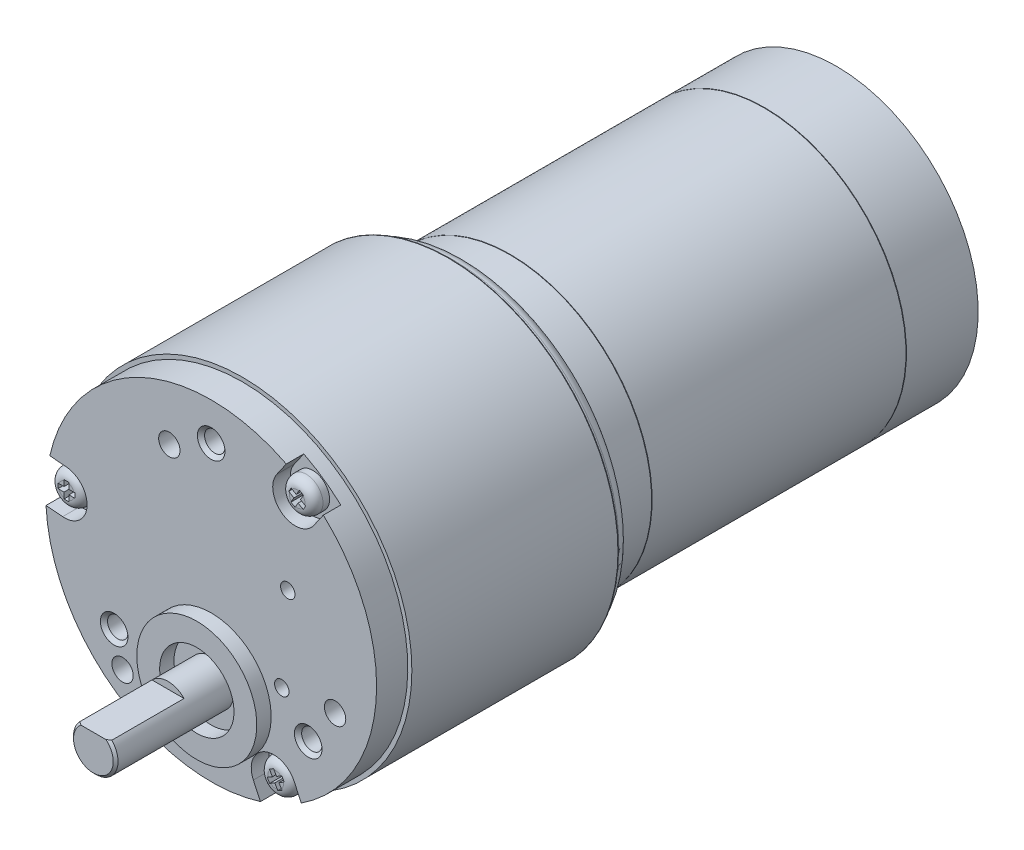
ISO-10303-21;
HEADER;
FILE_DESCRIPTION(('STEP AP214'),'2;1');
FILE_NAME('part.step','',(''),(''),'','','');
FILE_SCHEMA(('AUTOMOTIVE_DESIGN { 1 0 10303 214 1 1 1 1 }'));
ENDSEC;
DATA;
#1=APPLICATION_CONTEXT('core data for automotive mechanical design processes');
#2=APPLICATION_PROTOCOL_DEFINITION('international standard','automotive_design',2000,#1);
#3=PRODUCT_CONTEXT('',#1,'mechanical');
#4=PRODUCT('Part','Part','',(#3));
#5=PRODUCT_RELATED_PRODUCT_CATEGORY('part','',(#4));
#6=PRODUCT_DEFINITION_FORMATION('','',#4);
#7=PRODUCT_DEFINITION_CONTEXT('part definition',#1,'design');
#8=PRODUCT_DEFINITION('design','',#6,#7);
#9=PRODUCT_DEFINITION_SHAPE('','',#8);
#10=(LENGTH_UNIT() NAMED_UNIT(*) SI_UNIT(.MILLI.,.METRE.));
#11=(NAMED_UNIT(*) PLANE_ANGLE_UNIT() SI_UNIT($,.RADIAN.));
#12=(NAMED_UNIT(*) SI_UNIT($,.STERADIAN.) SOLID_ANGLE_UNIT());
#13=UNCERTAINTY_MEASURE_WITH_UNIT(LENGTH_MEASURE(1.E-05),#10,'distance_accuracy_value','');
#14=(GEOMETRIC_REPRESENTATION_CONTEXT(3) GLOBAL_UNCERTAINTY_ASSIGNED_CONTEXT((#13)) GLOBAL_UNIT_ASSIGNED_CONTEXT((#10,
#11,#12)) REPRESENTATION_CONTEXT('',''));
#15=CARTESIAN_POINT('',(0.,0.,0.));
#16=DIRECTION('',(0.,0.,1.));
#17=DIRECTION('',(1.,0.,0.));
#18=AXIS2_PLACEMENT_3D('',#15,#16,#17);
#19=CARTESIAN_POINT('',(0.,0.,-0.2032));
#20=DIRECTION('',(0.,0.,1.));
#21=DIRECTION('',(1.,0.,0.));
#22=AXIS2_PLACEMENT_3D('',#19,#20,#21);
#23=PLANE('',#22);
#24=DIRECTION('',(0.866025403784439,-0.499999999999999,0.));
#25=VECTOR('',#24,1.);
#26=CARTESIAN_POINT('',(7.63670927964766,13.2271684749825,-0.2032));
#27=LINE('',#26,#25);
#28=CARTESIAN_POINT('',(8.09426410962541,12.9629990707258,-0.2032));
#29=VERTEX_POINT('',#28);
#30=CARTESIAN_POINT('',(8.55451471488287,12.6972732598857,-0.2032));
#31=VERTEX_POINT('',#30);
#32=EDGE_CURVE('E518',#29,#31,#27,.T.);
#33=ORIENTED_EDGE('',*,*,#32,.F.);
#34=CARTESIAN_POINT('',(8.90148516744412,12.790243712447,-0.2032));
#35=DIRECTION('',(0.,0.,1.));
#36=DIRECTION('',(1.,0.,0.));
#37=AXIS2_PLACEMENT_3D('',#34,#35,#36);
#38=CIRCLE('',#37,0.8255);
#39=CARTESIAN_POINT('',(8.28878890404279,12.2370226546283,-0.2032));
#40=VERTEX_POINT('',#39);
#41=EDGE_CURVE('E2446',#29,#40,#38,.T.);
#42=ORIENTED_EDGE('',*,*,#41,.T.);
#43=DIRECTION('',(0.499999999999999,0.866025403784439,0.));
#44=VECTOR('',#43,1.);
#45=CARTESIAN_POINT('',(0.91780543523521,-0.529895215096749,-0.2032));
#46=LINE('',#45,#44);
#47=EDGE_CURVE('E513',#40,#31,#46,.T.);
#48=ORIENTED_EDGE('',*,*,#47,.T.);
#49=EDGE_LOOP('',(#33,#42,#48));
#50=FACE_BOUND('',#49,.T.);
#51=ADVANCED_FACE('F74',(#50),#23,.T.);
#52=DIRECTION('',(0.499999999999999,0.866025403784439,0.));
#53=VECTOR('',#52,1.);
#54=CARTESIAN_POINT('',(1.35774634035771,-0.783895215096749,-0.2032));
#55=LINE('',#54,#53);
#56=CARTESIAN_POINT('',(8.72872980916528,11.9830226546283,-0.2032));
#57=VERTEX_POINT('',#56);
#58=CARTESIAN_POINT('',(8.99445562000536,12.4432732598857,-0.2032));
#59=VERTEX_POINT('',#58);
#60=EDGE_CURVE('E509',#57,#59,#55,.T.);
#61=ORIENTED_EDGE('',*,*,#60,.F.);
#62=CARTESIAN_POINT('',(8.90148516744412,12.790243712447,-0.2032));
#63=DIRECTION('',(0.,0.,1.));
#64=DIRECTION('',(1.,0.,0.));
#65=AXIS2_PLACEMENT_3D('',#62,#63,#64);
#66=CIRCLE('',#65,0.8255);
#67=CARTESIAN_POINT('',(9.45470622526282,12.1775474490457,-0.2032));
#68=VERTEX_POINT('',#67);
#69=EDGE_CURVE('E2453',#57,#68,#66,.T.);
#70=ORIENTED_EDGE('',*,*,#69,.T.);
#71=EDGE_CURVE('E502',#59,#68,#27,.T.);
#72=ORIENTED_EDGE('',*,*,#71,.F.);
#73=EDGE_LOOP('',(#61,#70,#72));
#74=FACE_BOUND('',#73,.T.);
#75=ADVANCED_FACE('F1069',(#74),#23,.T.);
#76=DIRECTION('',(0.866025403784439,-0.499999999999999,0.));
#77=VECTOR('',#76,1.);
#78=CARTESIAN_POINT('',(7.89070927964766,13.667109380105,-0.2032));
#79=LINE('',#78,#77);
#80=CARTESIAN_POINT('',(9.24845562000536,12.8832141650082,-0.2032));
#81=VERTEX_POINT('',#80);
#82=CARTESIAN_POINT('',(9.70870622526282,12.6174883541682,-0.2032));
#83=VERTEX_POINT('',#82);
#84=EDGE_CURVE('E495',#81,#83,#79,.T.);
#85=ORIENTED_EDGE('',*,*,#84,.T.);
#86=CARTESIAN_POINT('',(8.90148516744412,12.790243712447,-0.2032));
#87=DIRECTION('',(0.,0.,1.));
#88=DIRECTION('',(1.,0.,0.));
#89=AXIS2_PLACEMENT_3D('',#86,#87,#88);
#90=CIRCLE('',#89,0.8255);
#91=CARTESIAN_POINT('',(9.51418143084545,13.3434647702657,-0.2032));
#92=VERTEX_POINT('',#91);
#93=EDGE_CURVE('E506',#83,#92,#90,.T.);
#94=ORIENTED_EDGE('',*,*,#93,.T.);
#95=EDGE_CURVE('E484',#81,#92,#55,.T.);
#96=ORIENTED_EDGE('',*,*,#95,.F.);
#97=EDGE_LOOP('',(#85,#94,#96));
#98=FACE_BOUND('',#97,.T.);
#99=ADVANCED_FACE('F505',(#98),#23,.T.);
#100=CARTESIAN_POINT('',(0.,0.,-0.2032));
#101=DIRECTION('',(0.,0.,1.));
#102=DIRECTION('',(1.,0.,0.));
#103=AXIS2_PLACEMENT_3D('',#100,#101,#102);
#104=PLANE('',#103);
#105=DIRECTION('',(0.5,-0.866025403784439,0.));
#106=VECTOR('',#105,1.);
#107=CARTESIAN_POINT('',(-1.35774634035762,-0.7838952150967,-0.2032));
#108=LINE('',#107,#106);
#109=CARTESIAN_POINT('',(6.01323712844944,-13.5508130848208,-0.2032));
#110=VERTEX_POINT('',#109);
#111=CARTESIAN_POINT('',(6.27896293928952,-14.0110636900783,-0.2032));
#112=VERTEX_POINT('',#111);
#113=EDGE_CURVE('E584',#110,#112,#108,.T.);
#114=ORIENTED_EDGE('',*,*,#113,.F.);
#115=CARTESIAN_POINT('',(6.62593339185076,-14.1040341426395,-0.2032));
#116=DIRECTION('',(0.,0.,1.));
#117=DIRECTION('',(1.,0.,0.));
#118=AXIS2_PLACEMENT_3D('',#115,#116,#117);
#119=CIRCLE('',#118,0.8255);
#120=CARTESIAN_POINT('',(5.81871233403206,-14.2767895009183,-0.2032));
#121=VERTEX_POINT('',#120);
#122=EDGE_CURVE('E1151',#110,#121,#119,.T.);
#123=ORIENTED_EDGE('',*,*,#122,.T.);
#124=DIRECTION('',(-0.866025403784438,-0.5,0.));
#125=VECTOR('',#124,1.);
#126=CARTESIAN_POINT('',(7.63670927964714,-13.2271684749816,-0.2032));
#127=LINE('',#126,#125);
#128=EDGE_CURVE('E587',#112,#121,#127,.T.);
#129=ORIENTED_EDGE('',*,*,#128,.F.);
#130=EDGE_LOOP('',(#114,#123,#129));
#131=FACE_BOUND('',#130,.T.);
#132=ADVANCED_FACE('F1092',(#131),#104,.T.);
#133=DIRECTION('',(-0.866025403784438,-0.500000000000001,0.));
#134=VECTOR('',#133,1.);
#135=CARTESIAN_POINT('',(7.89070927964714,-13.667109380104,-0.2032));
#136=LINE('',#135,#134);
#137=CARTESIAN_POINT('',(6.53296293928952,-14.4510045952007,-0.2032));
#138=VERTEX_POINT('',#137);
#139=CARTESIAN_POINT('',(6.07271233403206,-14.7167304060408,-0.2032));
#140=VERTEX_POINT('',#139);
#141=EDGE_CURVE('E582',#138,#140,#136,.T.);
#142=ORIENTED_EDGE('',*,*,#141,.T.);
#143=CARTESIAN_POINT('',(6.62593339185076,-14.1040341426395,-0.2032));
#144=DIRECTION('',(0.,0.,1.));
#145=DIRECTION('',(1.,0.,0.));
#146=AXIS2_PLACEMENT_3D('',#143,#144,#145);
#147=CIRCLE('',#146,0.8255);
#148=CARTESIAN_POINT('',(6.7986887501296,-14.9112552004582,-0.2032));
#149=VERTEX_POINT('',#148);
#150=EDGE_CURVE('E1148',#140,#149,#147,.T.);
#151=ORIENTED_EDGE('',*,*,#150,.T.);
#152=EDGE_CURVE('E579',#138,#149,#108,.T.);
#153=ORIENTED_EDGE('',*,*,#152,.F.);
#154=EDGE_LOOP('',(#142,#151,#153));
#155=FACE_BOUND('',#154,.T.);
#156=ADVANCED_FACE('F1096',(#155),#104,.T.);
#157=DIRECTION('',(0.500000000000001,-0.866025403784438,0.));
#158=VECTOR('',#157,1.);
#159=CARTESIAN_POINT('',(-0.91780543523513,-0.529895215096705,-0.2032));
#160=LINE('',#159,#158);
#161=CARTESIAN_POINT('',(6.97290384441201,-14.1970045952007,-0.2032));
#162=VERTEX_POINT('',#161);
#163=CARTESIAN_POINT('',(7.23862965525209,-14.6572552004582,-0.2032));
#164=VERTEX_POINT('',#163);
#165=EDGE_CURVE('E595',#162,#164,#160,.T.);
#166=ORIENTED_EDGE('',*,*,#165,.T.);
#167=CARTESIAN_POINT('',(6.62593339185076,-14.1040341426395,-0.2032));
#168=DIRECTION('',(0.,0.,1.));
#169=DIRECTION('',(1.,0.,0.));
#170=AXIS2_PLACEMENT_3D('',#167,#168,#169);
#171=CIRCLE('',#170,0.8255);
#172=CARTESIAN_POINT('',(7.43315444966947,-13.9312787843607,-0.2032));
#173=VERTEX_POINT('',#172);
#174=EDGE_CURVE('E1136',#164,#173,#171,.T.);
#175=ORIENTED_EDGE('',*,*,#174,.T.);
#176=EDGE_CURVE('E588',#173,#162,#136,.T.);
#177=ORIENTED_EDGE('',*,*,#176,.T.);
#178=EDGE_LOOP('',(#166,#175,#177));
#179=FACE_BOUND('',#178,.T.);
#180=ADVANCED_FACE('F1103',(#179),#104,.T.);
#181=CARTESIAN_POINT('',(0.,0.,-0.2032));
#182=DIRECTION('',(0.,0.,1.));
#183=DIRECTION('',(1.,0.,0.));
#184=AXIS2_PLACEMENT_3D('',#181,#182,#183);
#185=PLANE('',#184);
#186=DIRECTION('',(0.,1.,0.));
#187=VECTOR('',#186,1.);
#188=CARTESIAN_POINT('',(-15.7814185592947,0.,-0.2032));
#189=LINE('',#188,#187);
#190=CARTESIAN_POINT('',(-15.7814185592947,1.56779043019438,-0.2032));
#191=VERTEX_POINT('',#190);
#192=CARTESIAN_POINT('',(-15.7814185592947,2.09924205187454,-0.2032));
#193=VERTEX_POINT('',#192);
#194=EDGE_CURVE('E653',#191,#193,#189,.T.);
#195=ORIENTED_EDGE('',*,*,#194,.T.);
#196=CARTESIAN_POINT('',(-15.5274185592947,1.31379043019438,-0.2032));
#197=DIRECTION('',(0.,0.,1.));
#198=DIRECTION('',(1.,0.,0.));
#199=AXIS2_PLACEMENT_3D('',#196,#197,#198);
#200=CIRCLE('',#199,0.8255);
#201=CARTESIAN_POINT('',(-16.3128701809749,1.56779043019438,-0.2032));
#202=VERTEX_POINT('',#201);
#203=EDGE_CURVE('E1340',#193,#202,#200,.T.);
#204=ORIENTED_EDGE('',*,*,#203,.T.);
#205=DIRECTION('',(-1.,0.,0.));
#206=VECTOR('',#205,1.);
#207=CARTESIAN_POINT('',(0.,1.56779043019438,-0.2032));
#208=LINE('',#207,#206);
#209=EDGE_CURVE('E650',#191,#202,#208,.T.);
#210=ORIENTED_EDGE('',*,*,#209,.F.);
#211=EDGE_LOOP('',(#195,#204,#210));
#212=FACE_BOUND('',#211,.T.);
#213=ADVANCED_FACE('F1124',(#212),#185,.T.);
#214=DIRECTION('',(-1.,0.,0.));
#215=VECTOR('',#214,1.);
#216=CARTESIAN_POINT('',(0.,1.05979043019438,-0.2032));
#217=LINE('',#216,#215);
#218=CARTESIAN_POINT('',(-15.7814185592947,1.05979043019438,-0.2032));
#219=VERTEX_POINT('',#218);
#220=CARTESIAN_POINT('',(-16.3128701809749,1.05979043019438,-0.2032));
#221=VERTEX_POINT('',#220);
#222=EDGE_CURVE('E666',#219,#221,#217,.T.);
#223=ORIENTED_EDGE('',*,*,#222,.T.);
#224=CARTESIAN_POINT('',(-15.5274185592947,1.31379043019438,-0.2032));
#225=DIRECTION('',(0.,0.,1.));
#226=DIRECTION('',(1.,0.,0.));
#227=AXIS2_PLACEMENT_3D('',#224,#225,#226);
#228=CIRCLE('',#227,0.8255);
#229=CARTESIAN_POINT('',(-15.7814185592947,0.528338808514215,-0.2032));
#230=VERTEX_POINT('',#229);
#231=EDGE_CURVE('E1498',#221,#230,#228,.T.);
#232=ORIENTED_EDGE('',*,*,#231,.T.);
#233=EDGE_CURVE('E659',#230,#219,#189,.T.);
#234=ORIENTED_EDGE('',*,*,#233,.T.);
#235=EDGE_LOOP('',(#223,#232,#234));
#236=FACE_BOUND('',#235,.T.);
#237=ADVANCED_FACE('F1129',(#236),#185,.T.);
#238=DIRECTION('',(0.,1.,0.));
#239=VECTOR('',#238,1.);
#240=CARTESIAN_POINT('',(-15.2734185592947,0.,-0.2032));
#241=LINE('',#240,#239);
#242=CARTESIAN_POINT('',(-15.2734185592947,0.528338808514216,-0.2032));
#243=VERTEX_POINT('',#242);
#244=CARTESIAN_POINT('',(-15.2734185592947,1.05979043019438,-0.2032));
#245=VERTEX_POINT('',#244);
#246=EDGE_CURVE('E662',#243,#245,#241,.T.);
#247=ORIENTED_EDGE('',*,*,#246,.F.);
#248=CARTESIAN_POINT('',(-15.5274185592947,1.31379043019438,-0.2032));
#249=DIRECTION('',(0.,0.,1.));
#250=DIRECTION('',(1.,0.,0.));
#251=AXIS2_PLACEMENT_3D('',#248,#249,#250);
#252=CIRCLE('',#251,0.8255);
#253=CARTESIAN_POINT('',(-14.7419669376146,1.05979043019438,-0.2032));
#254=VERTEX_POINT('',#253);
#255=EDGE_CURVE('E1497',#243,#254,#252,.T.);
#256=ORIENTED_EDGE('',*,*,#255,.T.);
#257=EDGE_CURVE('E663',#254,#245,#217,.T.);
#258=ORIENTED_EDGE('',*,*,#257,.T.);
#259=EDGE_LOOP('',(#247,#256,#258));
#260=FACE_BOUND('',#259,.T.);
#261=ADVANCED_FACE('F1270',(#260),#185,.T.);
#262=CARTESIAN_POINT('',(0.,0.,-1.8542));
#263=DIRECTION('',(0.,0.,1.));
#264=DIRECTION('',(1.,0.,0.));
#265=AXIS2_PLACEMENT_3D('',#262,#263,#264);
#266=PLANE('',#265);
#267=DIRECTION('',(0.571234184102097,0.820787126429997,0.));
#268=VECTOR('',#267,1.);
#269=CARTESIAN_POINT('',(-1.95971134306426,1.36387873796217,-1.8542));
#270=LINE('',#269,#268);
#271=CARTESIAN_POINT('',(6.94177382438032,14.1541224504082,-1.8542));
#272=VERTEX_POINT('',#271);
#273=CARTESIAN_POINT('',(7.95107899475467,15.6043589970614,-1.8542));
#274=VERTEX_POINT('',#273);
#275=EDGE_CURVE('E778',#272,#274,#270,.T.);
#276=ORIENTED_EDGE('',*,*,#275,.F.);
#277=CARTESIAN_POINT('',(8.90148516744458,12.790243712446,-1.8542));
#278=DIRECTION('',(0.,0.,1.));
#279=DIRECTION('',(1.,0.,0.));
#280=AXIS2_PLACEMENT_3D('',#277,#278,#279);
#281=CIRCLE('',#280,2.3876);
#282=CARTESIAN_POINT('',(10.8611965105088,11.4263649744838,-1.8542));
#283=VERTEX_POINT('',#282);
#284=EDGE_CURVE('E786',#272,#283,#281,.T.);
#285=ORIENTED_EDGE('',*,*,#284,.T.);
#286=DIRECTION('',(-0.571234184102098,-0.820787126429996,0.));
#287=VECTOR('',#286,1.);
#288=CARTESIAN_POINT('',(1.95971134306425,-1.36387873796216,-1.8542));
#289=LINE('',#288,#287);
#290=CARTESIAN_POINT('',(11.8705016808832,12.8766015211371,-1.8542));
#291=VERTEX_POINT('',#290);
#292=EDGE_CURVE('E772',#291,#283,#289,.T.);
#293=ORIENTED_EDGE('',*,*,#292,.F.);
#294=CARTESIAN_POINT('',(0.,0.,-1.8542));
#295=DIRECTION('',(0.,0.,1.));
#296=DIRECTION('',(1.,0.,0.));
#297=AXIS2_PLACEMENT_3D('',#294,#295,#296);
#298=CIRCLE('',#297,17.5133);
#299=EDGE_CURVE('E1479',#274,#291,#298,.F.);
#300=ORIENTED_EDGE('',*,*,#299,.F.);
#301=EDGE_LOOP('',(#276,#285,#293,#300));
#302=FACE_BOUND('',#301,.T.);
#303=CARTESIAN_POINT('',(8.90148516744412,12.790243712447,-1.8542));
#304=DIRECTION('',(0.,0.,1.));
#305=DIRECTION('',(1.,0.,0.));
#306=AXIS2_PLACEMENT_3D('',#303,#304,#305);
#307=CIRCLE('',#306,1.778);
#308=CARTESIAN_POINT('',(7.12348516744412,12.790243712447,-1.8542));
#309=VERTEX_POINT('',#308);
#310=EDGE_CURVE('E507',#309,#309,#307,.T.);
#311=ORIENTED_EDGE('',*,*,#310,.F.);
#312=EDGE_LOOP('',(#311));
#313=FACE_BOUND('',#312,.T.);
#314=ADVANCED_FACE('F1088',(#302,#313),#266,.T.);
#315=CARTESIAN_POINT('',(0.,0.,-1.8542));
#316=DIRECTION('',(0.,0.,1.));
#317=DIRECTION('',(1.,0.,0.));
#318=AXIS2_PLACEMENT_3D('',#315,#316,#317);
#319=PLANE('',#318);
#320=DIRECTION('',(-0.425205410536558,0.905096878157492,0.));
#321=VECTOR('',#320,1.);
#322=CARTESIAN_POINT('',(2.16100930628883,1.01522043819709,-1.8542));
#323=LINE('',#322,#321);
#324=CARTESIAN_POINT('',(9.5382318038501,-14.6880158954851,-1.8542));
#325=VERTEX_POINT('',#324);
#326=CARTESIAN_POINT('',(8.78694269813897,-13.0888137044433,-1.8542));
#327=VERTEX_POINT('',#326);
#328=EDGE_CURVE('E791',#325,#327,#323,.T.);
#329=ORIENTED_EDGE('',*,*,#328,.T.);
#330=CARTESIAN_POINT('',(6.62593339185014,-14.1040341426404,-1.8542));
#331=DIRECTION('',(0.,0.,1.));
#332=DIRECTION('',(1.,0.,0.));
#333=AXIS2_PLACEMENT_3D('',#330,#331,#332);
#334=CIRCLE('',#333,2.3876);
#335=CARTESIAN_POINT('',(4.46492408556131,-15.1192545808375,-1.8542));
#336=VERTEX_POINT('',#335);
#337=EDGE_CURVE('E793',#327,#336,#334,.T.);
#338=ORIENTED_EDGE('',*,*,#337,.T.);
#339=DIRECTION('',(0.425205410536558,-0.905096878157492,0.));
#340=VECTOR('',#339,1.);
#341=CARTESIAN_POINT('',(-2.16100930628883,-1.01522043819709,-1.8542));
#342=LINE('',#341,#340);
#343=CARTESIAN_POINT('',(5.21621319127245,-16.7184567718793,-1.8542));
#344=VERTEX_POINT('',#343);
#345=EDGE_CURVE('E797',#336,#344,#342,.T.);
#346=ORIENTED_EDGE('',*,*,#345,.T.);
#347=CARTESIAN_POINT('',(0.,0.,-1.8542));
#348=DIRECTION('',(0.,0.,1.));
#349=DIRECTION('',(1.,0.,0.));
#350=AXIS2_PLACEMENT_3D('',#347,#348,#349);
#351=CIRCLE('',#350,17.5133);
#352=EDGE_CURVE('E1463',#325,#344,#351,.F.);
#353=ORIENTED_EDGE('',*,*,#352,.F.);
#354=EDGE_LOOP('',(#329,#338,#346,#353));
#355=FACE_BOUND('',#354,.T.);
#356=CARTESIAN_POINT('',(6.62593339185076,-14.1040341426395,-1.8542));
#357=DIRECTION('',(0.,0.,1.));
#358=DIRECTION('',(1.,0.,0.));
#359=AXIS2_PLACEMENT_3D('',#356,#357,#358);
#360=CIRCLE('',#359,1.778);
#361=CARTESIAN_POINT('',(4.84793339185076,-14.1040341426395,-1.8542));
#362=VERTEX_POINT('',#361);
#363=EDGE_CURVE('E583',#362,#362,#360,.T.);
#364=ORIENTED_EDGE('',*,*,#363,.F.);
#365=EDGE_LOOP('',(#364));
#366=FACE_BOUND('',#365,.T.);
#367=ADVANCED_FACE('F1119',(#355,#366),#319,.T.);
#368=CARTESIAN_POINT('',(0.,0.,-1.8542));
#369=DIRECTION('',(0.,0.,1.));
#370=DIRECTION('',(1.,0.,0.));
#371=AXIS2_PLACEMENT_3D('',#368,#369,#370);
#372=PLANE('',#371);
#373=DIRECTION('',(0.996439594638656,-0.0843097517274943,0.));
#374=VECTOR('',#373,1.);
#375=CARTESIAN_POINT('',(-0.201297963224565,-2.37909917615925,-1.8542));
#376=LINE('',#375,#374);
#377=CARTESIAN_POINT('',(-17.4893107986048,-0.916343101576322,-1.8542));
#378=VERTEX_POINT('',#377);
#379=CARTESIAN_POINT('',(-15.7287165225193,-1.06530874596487,-1.8542));
#380=VERTEX_POINT('',#379);
#381=EDGE_CURVE('E767',#378,#380,#376,.T.);
#382=ORIENTED_EDGE('',*,*,#381,.T.);
#383=CARTESIAN_POINT('',(-15.5274185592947,1.31379043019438,-1.8542));
#384=DIRECTION('',(0.,0.,1.));
#385=DIRECTION('',(1.,0.,0.));
#386=AXIS2_PLACEMENT_3D('',#383,#384,#385);
#387=CIRCLE('',#386,2.3876);
#388=CARTESIAN_POINT('',(-15.3261205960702,3.69288960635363,-1.8542));
#389=VERTEX_POINT('',#388);
#390=EDGE_CURVE('E754',#380,#389,#387,.T.);
#391=ORIENTED_EDGE('',*,*,#390,.T.);
#392=DIRECTION('',(-0.996439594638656,0.084309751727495,0.));
#393=VECTOR('',#392,1.);
#394=CARTESIAN_POINT('',(0.201297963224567,2.37909917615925,-1.8542));
#395=LINE('',#394,#393);
#396=CARTESIAN_POINT('',(-17.0867148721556,3.84185525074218,-1.8542));
#397=VERTEX_POINT('',#396);
#398=EDGE_CURVE('E760',#389,#397,#395,.T.);
#399=ORIENTED_EDGE('',*,*,#398,.T.);
#400=CARTESIAN_POINT('',(0.,0.,-1.8542));
#401=DIRECTION('',(0.,0.,1.));
#402=DIRECTION('',(1.,0.,0.));
#403=AXIS2_PLACEMENT_3D('',#400,#401,#402);
#404=CIRCLE('',#403,17.5133);
#405=EDGE_CURVE('E1490',#378,#397,#404,.F.);
#406=ORIENTED_EDGE('',*,*,#405,.F.);
#407=EDGE_LOOP('',(#382,#391,#399,#406));
#408=FACE_BOUND('',#407,.T.);
#409=CARTESIAN_POINT('',(-15.5274185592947,1.31379043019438,-1.8542));
#410=DIRECTION('',(0.,0.,1.));
#411=DIRECTION('',(1.,0.,0.));
#412=AXIS2_PLACEMENT_3D('',#409,#410,#411);
#413=CIRCLE('',#412,1.778);
#414=CARTESIAN_POINT('',(-17.3054185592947,1.31379043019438,-1.8542));
#415=VERTEX_POINT('',#414);
#416=EDGE_CURVE('E654',#415,#415,#413,.T.);
#417=ORIENTED_EDGE('',*,*,#416,.F.);
#418=EDGE_LOOP('',(#417));
#419=FACE_BOUND('',#418,.T.);
#420=ADVANCED_FACE('F1066',(#408,#419),#372,.T.);
#421=CARTESIAN_POINT('',(0.,0.,0.));
#422=DIRECTION('',(0.,0.,1.));
#423=DIRECTION('',(0.,-1.,0.));
#424=AXIS2_PLACEMENT_3D('',#421,#422,#423);
#425=PLANE('',#424);
#426=CARTESIAN_POINT('',(-4.43173743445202,11.201189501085,0.));
#427=DIRECTION('',(0.,0.,1.));
#428=DIRECTION('',(1.,0.,0.));
#429=AXIS2_PLACEMENT_3D('',#426,#427,#428);
#430=CIRCLE('',#429,1.13029999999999);
#431=CARTESIAN_POINT('',(-3.30143743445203,11.201189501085,0.));
#432=VERTEX_POINT('',#431);
#433=EDGE_CURVE('E720',#432,#432,#430,.T.);
#434=ORIENTED_EDGE('',*,*,#433,.F.);
#435=EDGE_LOOP('',(#434));
#436=FACE_BOUND('',#435,.T.);
#437=CARTESIAN_POINT('',(-9.38290247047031,-11.9220778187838,0.));
#438=DIRECTION('',(0.,0.,1.));
#439=DIRECTION('',(1.,0.,0.));
#440=AXIS2_PLACEMENT_3D('',#437,#438,#439);
#441=CIRCLE('',#440,1.13029999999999);
#442=CARTESIAN_POINT('',(-8.25260247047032,-11.9220778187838,0.));
#443=VERTEX_POINT('',#442);
#444=EDGE_CURVE('E726',#443,#443,#441,.T.);
#445=ORIENTED_EDGE('',*,*,#444,.F.);
#446=EDGE_LOOP('',(#445));
#447=FACE_BOUND('',#446,.T.);
#448=CARTESIAN_POINT('',(13.1180169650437,-4.64827885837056,0.));
#449=DIRECTION('',(0.,0.,1.));
#450=DIRECTION('',(1.,0.,0.));
#451=AXIS2_PLACEMENT_3D('',#448,#449,#450);
#452=CIRCLE('',#451,1.13029999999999);
#453=CARTESIAN_POINT('',(14.2483169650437,-4.64827885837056,0.));
#454=VERTEX_POINT('',#453);
#455=EDGE_CURVE('E732',#454,#454,#452,.T.);
#456=ORIENTED_EDGE('',*,*,#455,.F.);
#457=EDGE_LOOP('',(#456));
#458=FACE_BOUND('',#457,.T.);
#459=CARTESIAN_POINT('',(8.10786810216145,4.08875960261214,0.));
#460=DIRECTION('',(0.,0.,1.));
#461=DIRECTION('',(1.,0.,0.));
#462=AXIS2_PLACEMENT_3D('',#459,#460,#461);
#463=CIRCLE('',#462,0.762000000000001);
#464=CARTESIAN_POINT('',(8.86986810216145,4.08875960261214,0.));
#465=VERTEX_POINT('',#464);
#466=EDGE_CURVE('E739',#465,#465,#463,.T.);
#467=ORIENTED_EDGE('',*,*,#466,.F.);
#468=EDGE_LOOP('',(#467));
#469=FACE_BOUND('',#468,.T.);
#470=CARTESIAN_POINT('',(7.47691103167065,-5.15279357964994,0.));
#471=DIRECTION('',(0.,0.,1.));
#472=DIRECTION('',(1.,0.,0.));
#473=AXIS2_PLACEMENT_3D('',#470,#471,#472);
#474=CIRCLE('',#473,0.762000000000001);
#475=CARTESIAN_POINT('',(8.23891103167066,-5.15279357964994,0.));
#476=VERTEX_POINT('',#475);
#477=EDGE_CURVE('E742',#476,#476,#474,.T.);
#478=ORIENTED_EDGE('',*,*,#477,.F.);
#479=EDGE_LOOP('',(#478));
#480=FACE_BOUND('',#479,.T.);
#481=DIRECTION('',(0.996439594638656,-0.0843097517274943,0.));
#482=VECTOR('',#481,1.);
#483=CARTESIAN_POINT('',(-0.201297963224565,-2.37909917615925,0.));
#484=LINE('',#483,#482);
#485=CARTESIAN_POINT('',(-17.4893107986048,-0.916343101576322,0.));
#486=VERTEX_POINT('',#485);
#487=CARTESIAN_POINT('',(-15.7287165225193,-1.06530874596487,0.));
#488=VERTEX_POINT('',#487);
#489=EDGE_CURVE('E761',#486,#488,#484,.T.);
#490=ORIENTED_EDGE('',*,*,#489,.F.);
#491=CARTESIAN_POINT('',(0.,0.,0.));
#492=DIRECTION('',(0.,0.,-1.));
#493=DIRECTION('',(0.,1.,0.));
#494=AXIS2_PLACEMENT_3D('',#491,#492,#493);
#495=CIRCLE('',#494,17.5133);
#496=CARTESIAN_POINT('',(5.21621319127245,-16.7184567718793,0.));
#497=VERTEX_POINT('',#496);
#498=EDGE_CURVE('E911',#497,#486,#495,.T.);
#499=ORIENTED_EDGE('',*,*,#498,.F.);
#500=DIRECTION('',(0.425205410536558,-0.905096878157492,0.));
#501=VECTOR('',#500,1.);
#502=CARTESIAN_POINT('',(-2.16100930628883,-1.01522043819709,0.));
#503=LINE('',#502,#501);
#504=CARTESIAN_POINT('',(4.46492408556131,-15.1192545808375,0.));
#505=VERTEX_POINT('',#504);
#506=EDGE_CURVE('E794',#505,#497,#503,.T.);
#507=ORIENTED_EDGE('',*,*,#506,.F.);
#508=CARTESIAN_POINT('',(6.62593339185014,-14.1040341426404,0.));
#509=DIRECTION('',(0.,0.,1.));
#510=DIRECTION('',(1.,0.,0.));
#511=AXIS2_PLACEMENT_3D('',#508,#509,#510);
#512=CIRCLE('',#511,2.3876);
#513=CARTESIAN_POINT('',(8.78694269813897,-13.0888137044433,0.));
#514=VERTEX_POINT('',#513);
#515=EDGE_CURVE('E801',#514,#505,#512,.T.);
#516=ORIENTED_EDGE('',*,*,#515,.F.);
#517=DIRECTION('',(-0.425205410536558,0.905096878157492,0.));
#518=VECTOR('',#517,1.);
#519=CARTESIAN_POINT('',(2.16100930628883,1.01522043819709,0.));
#520=LINE('',#519,#518);
#521=CARTESIAN_POINT('',(9.5382318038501,-14.6880158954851,0.));
#522=VERTEX_POINT('',#521);
#523=EDGE_CURVE('E784',#522,#514,#520,.T.);
#524=ORIENTED_EDGE('',*,*,#523,.F.);
#525=CARTESIAN_POINT('',(11.8705016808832,12.8766015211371,0.));
#526=VERTEX_POINT('',#525);
#527=EDGE_CURVE('E910',#526,#522,#495,.T.);
#528=ORIENTED_EDGE('',*,*,#527,.F.);
#529=DIRECTION('',(-0.571234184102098,-0.820787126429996,0.));
#530=VECTOR('',#529,1.);
#531=CARTESIAN_POINT('',(1.95971134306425,-1.36387873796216,0.));
#532=LINE('',#531,#530);
#533=CARTESIAN_POINT('',(10.8611965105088,11.4263649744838,0.));
#534=VERTEX_POINT('',#533);
#535=EDGE_CURVE('E774',#526,#534,#532,.T.);
#536=ORIENTED_EDGE('',*,*,#535,.T.);
#537=CARTESIAN_POINT('',(8.90148516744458,12.790243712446,0.));
#538=DIRECTION('',(0.,0.,1.));
#539=DIRECTION('',(1.,0.,0.));
#540=AXIS2_PLACEMENT_3D('',#537,#538,#539);
#541=CIRCLE('',#540,2.3876);
#542=CARTESIAN_POINT('',(6.94177382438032,14.1541224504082,0.));
#543=VERTEX_POINT('',#542);
#544=EDGE_CURVE('E777',#543,#534,#541,.T.);
#545=ORIENTED_EDGE('',*,*,#544,.F.);
#546=DIRECTION('',(0.571234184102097,0.820787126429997,0.));
#547=VECTOR('',#546,1.);
#548=CARTESIAN_POINT('',(-1.95971134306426,1.36387873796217,0.));
#549=LINE('',#548,#547);
#550=CARTESIAN_POINT('',(7.95107899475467,15.6043589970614,0.));
#551=VERTEX_POINT('',#550);
#552=EDGE_CURVE('E781',#543,#551,#549,.T.);
#553=ORIENTED_EDGE('',*,*,#552,.T.);
#554=CARTESIAN_POINT('',(-17.0867148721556,3.84185525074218,0.));
#555=VERTEX_POINT('',#554);
#556=EDGE_CURVE('E915',#555,#551,#495,.T.);
#557=ORIENTED_EDGE('',*,*,#556,.F.);
#558=DIRECTION('',(-0.996439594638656,0.084309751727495,0.));
#559=VECTOR('',#558,1.);
#560=CARTESIAN_POINT('',(0.201297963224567,2.37909917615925,0.));
#561=LINE('',#560,#559);
#562=CARTESIAN_POINT('',(-15.3261205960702,3.69288960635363,0.));
#563=VERTEX_POINT('',#562);
#564=EDGE_CURVE('E756',#563,#555,#561,.T.);
#565=ORIENTED_EDGE('',*,*,#564,.F.);
#566=CARTESIAN_POINT('',(-15.5274185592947,1.31379043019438,0.));
#567=DIRECTION('',(0.,0.,1.));
#568=DIRECTION('',(1.,0.,0.));
#569=AXIS2_PLACEMENT_3D('',#566,#567,#568);
#570=CIRCLE('',#569,2.3876);
#571=EDGE_CURVE('E751',#488,#563,#570,.T.);
#572=ORIENTED_EDGE('',*,*,#571,.F.);
#573=EDGE_LOOP('',(#490,#499,#507,#516,#524,#528,#536,#545,#553,#557,#565,#572));
#574=FACE_BOUND('',#573,.T.);
#575=CARTESIAN_POINT('',(0.,-8.3693,0.));
#576=DIRECTION('',(0.,0.,1.));
#577=DIRECTION('',(1.,0.,0.));
#578=AXIS2_PLACEMENT_3D('',#575,#576,#577);
#579=CIRCLE('',#578,6.35);
#580=CARTESIAN_POINT('',(-6.35,-8.3693,0.));
#581=VERTEX_POINT('',#580);
#582=EDGE_CURVE('E835',#581,#581,#579,.T.);
#583=ORIENTED_EDGE('',*,*,#582,.F.);
#584=EDGE_LOOP('',(#583));
#585=FACE_BOUND('',#584,.T.);
#586=CARTESIAN_POINT('',(0.,13.5128,0.));
#587=DIRECTION('',(0.,0.,1.));
#588=DIRECTION('',(0.,-1.,0.));
#589=AXIS2_PLACEMENT_3D('',#586,#587,#588);
#590=CIRCLE('',#589,1.46050000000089);
#591=CARTESIAN_POINT('',(1.46050000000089,13.5128,0.));
#592=VERTEX_POINT('',#591);
#593=EDGE_CURVE('E2645',#592,#592,#590,.F.);
#594=ORIENTED_EDGE('',*,*,#593,.T.);
#595=EDGE_LOOP('',(#594));
#596=FACE_BOUND('',#595,.T.);
#597=CARTESIAN_POINT('',(-10.2743,-8.6569589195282,0.));
#598=DIRECTION('',(0.,0.,1.));
#599=DIRECTION('',(0.,-1.,0.));
#600=AXIS2_PLACEMENT_3D('',#597,#598,#599);
#601=CIRCLE('',#600,1.46049999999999);
#602=CARTESIAN_POINT('',(-10.2743,-10.1174589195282,0.));
#603=VERTEX_POINT('',#602);
#604=EDGE_CURVE('E2649',#603,#603,#601,.F.);
#605=ORIENTED_EDGE('',*,*,#604,.T.);
#606=EDGE_LOOP('',(#605));
#607=FACE_BOUND('',#606,.T.);
#608=CARTESIAN_POINT('',(10.2743,-8.6569589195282,0.));
#609=DIRECTION('',(0.,0.,1.));
#610=DIRECTION('',(0.,-1.,0.));
#611=AXIS2_PLACEMENT_3D('',#608,#609,#610);
#612=CIRCLE('',#611,1.46049999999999);
#613=CARTESIAN_POINT('',(10.2743,-10.1174589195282,0.));
#614=VERTEX_POINT('',#613);
#615=EDGE_CURVE('E1470',#614,#614,#612,.F.);
#616=ORIENTED_EDGE('',*,*,#615,.T.);
#617=EDGE_LOOP('',(#616));
#618=FACE_BOUND('',#617,.T.);
#619=ADVANCED_FACE('F1057',(#436,#447,#458,#469,#480,#574,#585,#596,#607,#618),#425,.T.);
#620=CARTESIAN_POINT('',(0.,0.,-68.072));
#621=DIRECTION('',(0.,0.,-1.));
#622=DIRECTION('',(0.,1.,0.));
#623=AXIS2_PLACEMENT_3D('',#620,#621,#622);
#624=CYLINDRICAL_SURFACE('',#623,17.5133);
#625=DIRECTION('',(0.,0.,-1.));
#626=VECTOR('',#625,1.);
#627=CARTESIAN_POINT('',(-17.4893107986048,-0.916343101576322,-68.072));
#628=LINE('',#627,#626);
#629=EDGE_CURVE('E1493',#378,#486,#628,.F.);
#630=ORIENTED_EDGE('',*,*,#629,.F.);
#631=ORIENTED_EDGE('',*,*,#405,.T.);
#632=DIRECTION('',(0.,0.,-1.));
#633=VECTOR('',#632,1.);
#634=CARTESIAN_POINT('',(-17.0867148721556,3.84185525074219,-68.072));
#635=LINE('',#634,#633);
#636=EDGE_CURVE('E1488',#555,#397,#635,.T.);
#637=ORIENTED_EDGE('',*,*,#636,.F.);
#638=ORIENTED_EDGE('',*,*,#556,.T.);
#639=DIRECTION('',(0.,0.,-1.));
#640=VECTOR('',#639,1.);
#641=CARTESIAN_POINT('',(7.95107899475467,15.6043589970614,-68.072));
#642=LINE('',#641,#640);
#643=EDGE_CURVE('E1485',#551,#274,#642,.T.);
#644=ORIENTED_EDGE('',*,*,#643,.T.);
#645=ORIENTED_EDGE('',*,*,#299,.T.);
#646=DIRECTION('',(0.,0.,-1.));
#647=VECTOR('',#646,1.);
#648=CARTESIAN_POINT('',(11.8705016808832,12.8766015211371,-68.072));
#649=LINE('',#648,#647);
#650=EDGE_CURVE('E1482',#291,#526,#649,.F.);
#651=ORIENTED_EDGE('',*,*,#650,.T.);
#652=ORIENTED_EDGE('',*,*,#527,.T.);
#653=DIRECTION('',(0.,0.,-1.));
#654=VECTOR('',#653,1.);
#655=CARTESIAN_POINT('',(9.5382318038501,-14.6880158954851,-68.072));
#656=LINE('',#655,#654);
#657=EDGE_CURVE('E1467',#325,#522,#656,.F.);
#658=ORIENTED_EDGE('',*,*,#657,.F.);
#659=ORIENTED_EDGE('',*,*,#352,.T.);
#660=DIRECTION('',(0.,0.,-1.));
#661=VECTOR('',#660,1.);
#662=CARTESIAN_POINT('',(5.21621319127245,-16.7184567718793,-68.072));
#663=LINE('',#662,#661);
#664=EDGE_CURVE('E1476',#497,#344,#663,.T.);
#665=ORIENTED_EDGE('',*,*,#664,.F.);
#666=ORIENTED_EDGE('',*,*,#498,.T.);
#667=EDGE_LOOP('',(#630,#631,#637,#638,#644,#645,#651,#652,#658,#659,#665,#666));
#668=FACE_BOUND('',#667,.T.);
#669=CARTESIAN_POINT('',(0.,0.,-3.302));
#670=DIRECTION('',(0.,0.,-1.));
#671=DIRECTION('',(0.,1.,0.));
#672=AXIS2_PLACEMENT_3D('',#669,#670,#671);
#673=CIRCLE('',#672,17.5133);
#674=CARTESIAN_POINT('',(0.,17.5133,-3.302));
#675=VERTEX_POINT('',#674);
#676=EDGE_CURVE('E907',#675,#675,#673,.T.);
#677=ORIENTED_EDGE('',*,*,#676,.F.);
#678=EDGE_LOOP('',(#677));
#679=FACE_BOUND('',#678,.T.);
#680=ADVANCED_FACE('F1055',(#668,#679),#624,.T.);
#681=CARTESIAN_POINT('',(0.,-8.3693,0.));
#682=DIRECTION('',(0.,0.,1.));
#683=DIRECTION('',(0.,-1.,0.));
#684=AXIS2_PLACEMENT_3D('',#681,#682,#683);
#685=CIRCLE('',#684,3.937);
#686=CARTESIAN_POINT('',(-3.937,-8.3693,0.));
#687=VERTEX_POINT('',#686);
#688=EDGE_CURVE('E914',#687,#687,#685,.F.);
#689=ORIENTED_EDGE('',*,*,#688,.F.);
#690=EDGE_LOOP('',(#689));
#691=FACE_BOUND('',#690,.T.);
#692=CARTESIAN_POINT('',(0.,-8.3693,0.));
#693=DIRECTION('',(0.,0.,1.));
#694=DIRECTION('',(1.,0.,0.));
#695=AXIS2_PLACEMENT_3D('',#692,#693,#694);
#696=CIRCLE('',#695,2.35585);
#697=CARTESIAN_POINT('',(2.35585,-8.3693,0.));
#698=VERTEX_POINT('',#697);
#699=EDGE_CURVE('E830',#698,#698,#696,.T.);
#700=ORIENTED_EDGE('',*,*,#699,.F.);
#701=EDGE_LOOP('',(#700));
#702=FACE_BOUND('',#701,.T.);
#703=ADVANCED_FACE('F1053',(#691,#702),#425,.T.);
#704=CARTESIAN_POINT('',(0.,17.5133,-3.302));
#705=DIRECTION('',(0.,0.,1.));
#706=DIRECTION('',(0.,-1.,0.));
#707=AXIS2_PLACEMENT_3D('',#704,#705,#706);
#708=PLANE('',#707);
#709=ORIENTED_EDGE('',*,*,#676,.T.);
#710=EDGE_LOOP('',(#709));
#711=FACE_BOUND('',#710,.T.);
#712=CARTESIAN_POINT('',(0.,0.,-3.302));
#713=DIRECTION('',(0.,0.,-1.));
#714=DIRECTION('',(0.,1.,0.));
#715=AXIS2_PLACEMENT_3D('',#712,#713,#714);
#716=CIRCLE('',#715,17.9451);
#717=CARTESIAN_POINT('',(0.,17.9451,-3.302));
#718=VERTEX_POINT('',#717);
#719=EDGE_CURVE('E904',#718,#718,#716,.T.);
#720=ORIENTED_EDGE('',*,*,#719,.F.);
#721=EDGE_LOOP('',(#720));
#722=FACE_BOUND('',#721,.T.);
#723=ADVANCED_FACE('F1049',(#711,#722),#708,.T.);
#724=CARTESIAN_POINT('',(0.,0.,-68.072));
#725=DIRECTION('',(0.,0.,-1.));
#726=DIRECTION('',(0.,1.,0.));
#727=AXIS2_PLACEMENT_3D('',#724,#725,#726);
#728=CYLINDRICAL_SURFACE('',#727,17.9451);
#729=ORIENTED_EDGE('',*,*,#719,.T.);
#730=EDGE_LOOP('',(#729));
#731=FACE_BOUND('',#730,.T.);
#732=CARTESIAN_POINT('',(0.,0.,-25.1206));
#733=DIRECTION('',(0.,0.,-1.));
#734=DIRECTION('',(0.,1.,0.));
#735=AXIS2_PLACEMENT_3D('',#732,#733,#734);
#736=CIRCLE('',#735,17.9451);
#737=CARTESIAN_POINT('',(0.,17.9451,-25.1206));
#738=VERTEX_POINT('',#737);
#739=EDGE_CURVE('E901',#738,#738,#736,.T.);
#740=ORIENTED_EDGE('',*,*,#739,.F.);
#741=EDGE_LOOP('',(#740));
#742=FACE_BOUND('',#741,.T.);
#743=ADVANCED_FACE('F1045',(#731,#742),#728,.T.);
#744=CARTESIAN_POINT('',(0.,0.,-25.146));
#745=DIRECTION('',(0.,0.,1.));
#746=DIRECTION('',(0.,-1.,0.));
#747=AXIS2_PLACEMENT_3D('',#744,#745,#746);
#748=CONICAL_SURFACE('',#747,17.9197,0.785398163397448);
#749=ORIENTED_EDGE('',*,*,#739,.T.);
#750=EDGE_LOOP('',(#749));
#751=FACE_BOUND('',#750,.T.);
#752=CARTESIAN_POINT('',(0.,0.,-25.146));
#753=DIRECTION('',(0.,0.,-1.));
#754=DIRECTION('',(0.,1.,0.));
#755=AXIS2_PLACEMENT_3D('',#752,#753,#754);
#756=CIRCLE('',#755,17.9197);
#757=CARTESIAN_POINT('',(0.,17.9197,-25.146));
#758=VERTEX_POINT('',#757);
#759=EDGE_CURVE('E898',#758,#758,#756,.T.);
#760=ORIENTED_EDGE('',*,*,#759,.F.);
#761=EDGE_LOOP('',(#760));
#762=FACE_BOUND('',#761,.T.);
#763=ADVANCED_FACE('F1041',(#751,#762),#748,.T.);
#764=CARTESIAN_POINT('',(0.,0.,-25.1714));
#765=DIRECTION('',(0.,0.,-1.));
#766=DIRECTION('',(0.,1.,0.));
#767=AXIS2_PLACEMENT_3D('',#764,#765,#766);
#768=CONICAL_SURFACE('',#767,17.9451,0.785398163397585);
#769=ORIENTED_EDGE('',*,*,#759,.T.);
#770=EDGE_LOOP('',(#769));
#771=FACE_BOUND('',#770,.T.);
#772=CARTESIAN_POINT('',(0.,0.,-25.1714));
#773=DIRECTION('',(0.,0.,-1.));
#774=DIRECTION('',(0.,1.,0.));
#775=AXIS2_PLACEMENT_3D('',#772,#773,#774);
#776=CIRCLE('',#775,17.9451);
#777=CARTESIAN_POINT('',(0.,17.9451,-25.1714));
#778=VERTEX_POINT('',#777);
#779=EDGE_CURVE('E895',#778,#778,#776,.T.);
#780=ORIENTED_EDGE('',*,*,#779,.F.);
#781=EDGE_LOOP('',(#780));
#782=FACE_BOUND('',#781,.T.);
#783=ADVANCED_FACE('F1037',(#771,#782),#768,.T.);
#784=CARTESIAN_POINT('',(0.,17.9451,-25.1713999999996));
#785=DIRECTION('',(0.,0.,-1.));
#786=DIRECTION('',(0.,1.,0.));
#787=AXIS2_PLACEMENT_3D('',#784,#785,#786);
#788=PLANE('',#787);
#789=ORIENTED_EDGE('',*,*,#779,.T.);
#790=EDGE_LOOP('',(#789));
#791=FACE_BOUND('',#790,.T.);
#792=CARTESIAN_POINT('',(0.,0.,-25.1713999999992));
#793=DIRECTION('',(0.,0.,-1.));
#794=DIRECTION('',(0.,1.,0.));
#795=AXIS2_PLACEMENT_3D('',#792,#793,#794);
#796=CIRCLE('',#795,17.5133);
#797=CARTESIAN_POINT('',(0.,17.5133,-25.1713999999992));
#798=VERTEX_POINT('',#797);
#799=EDGE_CURVE('E892',#798,#798,#796,.T.);
#800=ORIENTED_EDGE('',*,*,#799,.F.);
#801=EDGE_LOOP('',(#800));
#802=FACE_BOUND('',#801,.T.);
#803=ADVANCED_FACE('F1033',(#791,#802),#788,.T.);
#804=CARTESIAN_POINT('',(0.,0.,-68.072));
#805=DIRECTION('',(0.,0.,-1.));
#806=DIRECTION('',(0.,1.,0.));
#807=AXIS2_PLACEMENT_3D('',#804,#805,#806);
#808=CYLINDRICAL_SURFACE('',#807,17.5133);
#809=ORIENTED_EDGE('',*,*,#799,.T.);
#810=EDGE_LOOP('',(#809));
#811=FACE_BOUND('',#810,.T.);
#812=CARTESIAN_POINT('',(0.,0.,-25.654));
#813=DIRECTION('',(0.,0.,-1.));
#814=DIRECTION('',(0.,1.,0.));
#815=AXIS2_PLACEMENT_3D('',#812,#813,#814);
#816=CIRCLE('',#815,17.5133);
#817=CARTESIAN_POINT('',(0.,17.5133,-25.654));
#818=VERTEX_POINT('',#817);
#819=EDGE_CURVE('E889',#818,#818,#816,.T.);
#820=ORIENTED_EDGE('',*,*,#819,.F.);
#821=EDGE_LOOP('',(#820));
#822=FACE_BOUND('',#821,.T.);
#823=ADVANCED_FACE('F1029',(#811,#822),#808,.T.);
#824=CARTESIAN_POINT('',(0.,0.,-25.654));
#825=DIRECTION('',(0.,0.,-1.));
#826=DIRECTION('',(0.,1.,0.));
#827=AXIS2_PLACEMENT_3D('',#824,#825,#826);
#828=TOROIDAL_SURFACE('',#827,16.3703,1.143);
#829=ORIENTED_EDGE('',*,*,#819,.T.);
#830=EDGE_LOOP('',(#829));
#831=FACE_BOUND('',#830,.T.);
#832=CARTESIAN_POINT('',(0.,0.,-26.797));
#833=DIRECTION('',(0.,0.,-1.));
#834=DIRECTION('',(0.,1.,0.));
#835=AXIS2_PLACEMENT_3D('',#832,#833,#834);
#836=CIRCLE('',#835,16.3703);
#837=CARTESIAN_POINT('',(0.,16.3703,-26.797));
#838=VERTEX_POINT('',#837);
#839=EDGE_CURVE('E886',#838,#838,#836,.T.);
#840=ORIENTED_EDGE('',*,*,#839,.F.);
#841=EDGE_LOOP('',(#840));
#842=FACE_BOUND('',#841,.T.);
#843=ADVANCED_FACE('F1025',(#831,#842),#828,.T.);
#844=CARTESIAN_POINT('',(0.,16.3703,-26.797));
#845=DIRECTION('',(0.,0.,-1.));
#846=DIRECTION('',(0.,1.,0.));
#847=AXIS2_PLACEMENT_3D('',#844,#845,#846);
#848=PLANE('',#847);
#849=ORIENTED_EDGE('',*,*,#839,.T.);
#850=EDGE_LOOP('',(#849));
#851=FACE_BOUND('',#850,.T.);
#852=CARTESIAN_POINT('',(0.,0.,-26.797));
#853=DIRECTION('',(0.,0.,-1.));
#854=DIRECTION('',(0.,1.,0.));
#855=AXIS2_PLACEMENT_3D('',#852,#853,#854);
#856=CIRCLE('',#855,16.1544);
#857=CARTESIAN_POINT('',(0.,16.1544,-26.797));
#858=VERTEX_POINT('',#857);
#859=EDGE_CURVE('E883',#858,#858,#856,.T.);
#860=ORIENTED_EDGE('',*,*,#859,.F.);
#861=EDGE_LOOP('',(#860));
#862=FACE_BOUND('',#861,.T.);
#863=ADVANCED_FACE('F1021',(#851,#862),#848,.T.);
#864=CARTESIAN_POINT('',(0.,0.,-27.94));
#865=DIRECTION('',(0.,0.,-1.));
#866=DIRECTION('',(0.,1.,0.));
#867=AXIS2_PLACEMENT_3D('',#864,#865,#866);
#868=TOROIDAL_SURFACE('',#867,16.1544,1.143);
#869=ORIENTED_EDGE('',*,*,#859,.T.);
#870=EDGE_LOOP('',(#869));
#871=FACE_BOUND('',#870,.T.);
#872=CARTESIAN_POINT('',(0.,0.,-27.94));
#873=DIRECTION('',(0.,0.,-1.));
#874=DIRECTION('',(0.,1.,0.));
#875=AXIS2_PLACEMENT_3D('',#872,#873,#874);
#876=CIRCLE('',#875,15.0114);
#877=CARTESIAN_POINT('',(0.,15.0114,-27.94));
#878=VERTEX_POINT('',#877);
#879=EDGE_CURVE('E880',#878,#878,#876,.T.);
#880=ORIENTED_EDGE('',*,*,#879,.F.);
#881=EDGE_LOOP('',(#880));
#882=FACE_BOUND('',#881,.T.);
#883=ADVANCED_FACE('F1017',(#871,#882),#868,.F.);
#884=CARTESIAN_POINT('',(0.,0.,-68.072));
#885=DIRECTION('',(0.,0.,-1.));
#886=DIRECTION('',(0.,1.,0.));
#887=AXIS2_PLACEMENT_3D('',#884,#885,#886);
#888=CYLINDRICAL_SURFACE('',#887,15.0114);
#889=ORIENTED_EDGE('',*,*,#879,.T.);
#890=EDGE_LOOP('',(#889));
#891=FACE_BOUND('',#890,.T.);
#892=CARTESIAN_POINT('',(0.,0.,-31.623));
#893=DIRECTION('',(0.,0.,-1.));
#894=DIRECTION('',(0.,1.,0.));
#895=AXIS2_PLACEMENT_3D('',#892,#893,#894);
#896=CIRCLE('',#895,15.0114);
#897=CARTESIAN_POINT('',(0.,15.0114,-31.623));
#898=VERTEX_POINT('',#897);
#899=EDGE_CURVE('E877',#898,#898,#896,.T.);
#900=ORIENTED_EDGE('',*,*,#899,.F.);
#901=EDGE_LOOP('',(#900));
#902=FACE_BOUND('',#901,.T.);
#903=ADVANCED_FACE('F1013',(#891,#902),#888,.T.);
#904=CARTESIAN_POINT('',(0.,0.,-31.6484));
#905=DIRECTION('',(0.,0.,1.));
#906=DIRECTION('',(0.,-1.,0.));
#907=AXIS2_PLACEMENT_3D('',#904,#905,#906);
#908=CONICAL_SURFACE('',#907,14.986,0.785398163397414);
#909=ORIENTED_EDGE('',*,*,#899,.T.);
#910=EDGE_LOOP('',(#909));
#911=FACE_BOUND('',#910,.T.);
#912=CARTESIAN_POINT('',(0.,0.,-31.6484));
#913=DIRECTION('',(0.,0.,-1.));
#914=DIRECTION('',(0.,1.,0.));
#915=AXIS2_PLACEMENT_3D('',#912,#913,#914);
#916=CIRCLE('',#915,14.986);
#917=CARTESIAN_POINT('',(0.,14.986,-31.6484));
#918=VERTEX_POINT('',#917);
#919=EDGE_CURVE('E874',#918,#918,#916,.T.);
#920=ORIENTED_EDGE('',*,*,#919,.F.);
#921=EDGE_LOOP('',(#920));
#922=FACE_BOUND('',#921,.T.);
#923=ADVANCED_FACE('F1009',(#911,#922),#908,.T.);
#924=CARTESIAN_POINT('',(0.,0.,-31.6738));
#925=DIRECTION('',(0.,0.,-1.));
#926=DIRECTION('',(0.,1.,0.));
#927=AXIS2_PLACEMENT_3D('',#924,#925,#926);
#928=CONICAL_SURFACE('',#927,15.0114,0.785398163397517);
#929=ORIENTED_EDGE('',*,*,#919,.T.);
#930=EDGE_LOOP('',(#929));
#931=FACE_BOUND('',#930,.T.);
#932=CARTESIAN_POINT('',(0.,0.,-31.6738));
#933=DIRECTION('',(0.,0.,-1.));
#934=DIRECTION('',(0.,1.,0.));
#935=AXIS2_PLACEMENT_3D('',#932,#933,#934);
#936=CIRCLE('',#935,15.0114);
#937=CARTESIAN_POINT('',(0.,15.0114,-31.6738));
#938=VERTEX_POINT('',#937);
#939=EDGE_CURVE('E871',#938,#938,#936,.T.);
#940=ORIENTED_EDGE('',*,*,#939,.F.);
#941=EDGE_LOOP('',(#940));
#942=FACE_BOUND('',#941,.T.);
#943=ADVANCED_FACE('F1005',(#931,#942),#928,.T.);
#944=CARTESIAN_POINT('',(0.,0.,-68.072));
#945=DIRECTION('',(0.,0.,-1.));
#946=DIRECTION('',(0.,1.,0.));
#947=AXIS2_PLACEMENT_3D('',#944,#945,#946);
#948=CYLINDRICAL_SURFACE('',#947,15.0114);
#949=ORIENTED_EDGE('',*,*,#939,.T.);
#950=EDGE_LOOP('',(#949));
#951=FACE_BOUND('',#950,.T.);
#952=CARTESIAN_POINT('',(0.,0.,-58.547));
#953=DIRECTION('',(0.,0.,-1.));
#954=DIRECTION('',(0.,1.,0.));
#955=AXIS2_PLACEMENT_3D('',#952,#953,#954);
#956=CIRCLE('',#955,15.0114);
#957=CARTESIAN_POINT('',(0.,15.0114,-58.547));
#958=VERTEX_POINT('',#957);
#959=EDGE_CURVE('E868',#958,#958,#956,.T.);
#960=ORIENTED_EDGE('',*,*,#959,.F.);
#961=EDGE_LOOP('',(#960));
#962=FACE_BOUND('',#961,.T.);
#963=ADVANCED_FACE('F1001',(#951,#962),#948,.T.);
#964=CARTESIAN_POINT('',(0.,0.,-58.5724));
#965=DIRECTION('',(0.,0.,1.));
#966=DIRECTION('',(0.,-1.,0.));
#967=AXIS2_PLACEMENT_3D('',#964,#965,#966);
#968=CONICAL_SURFACE('',#967,14.986,0.785398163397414);
#969=ORIENTED_EDGE('',*,*,#959,.T.);
#970=EDGE_LOOP('',(#969));
#971=FACE_BOUND('',#970,.T.);
#972=CARTESIAN_POINT('',(0.,0.,-58.5724));
#973=DIRECTION('',(0.,0.,-1.));
#974=DIRECTION('',(0.,1.,0.));
#975=AXIS2_PLACEMENT_3D('',#972,#973,#974);
#976=CIRCLE('',#975,14.986);
#977=CARTESIAN_POINT('',(0.,14.986,-58.5724));
#978=VERTEX_POINT('',#977);
#979=EDGE_CURVE('E865',#978,#978,#976,.T.);
#980=ORIENTED_EDGE('',*,*,#979,.F.);
#981=EDGE_LOOP('',(#980));
#982=FACE_BOUND('',#981,.T.);
#983=ADVANCED_FACE('F997',(#971,#982),#968,.T.);
#984=CARTESIAN_POINT('',(0.,0.,-58.5978));
#985=DIRECTION('',(0.,0.,-1.));
#986=DIRECTION('',(0.,1.,0.));
#987=AXIS2_PLACEMENT_3D('',#984,#985,#986);
#988=CONICAL_SURFACE('',#987,15.0114,0.785398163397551);
#989=ORIENTED_EDGE('',*,*,#979,.T.);
#990=EDGE_LOOP('',(#989));
#991=FACE_BOUND('',#990,.T.);
#992=CARTESIAN_POINT('',(0.,0.,-58.5978));
#993=DIRECTION('',(0.,0.,-1.));
#994=DIRECTION('',(0.,1.,0.));
#995=AXIS2_PLACEMENT_3D('',#992,#993,#994);
#996=CIRCLE('',#995,15.0114);
#997=CARTESIAN_POINT('',(0.,15.0114,-58.5978));
#998=VERTEX_POINT('',#997);
#999=EDGE_CURVE('E862',#998,#998,#996,.T.);
#1000=ORIENTED_EDGE('',*,*,#999,.F.);
#1001=EDGE_LOOP('',(#1000));
#1002=FACE_BOUND('',#1001,.T.);
#1003=ADVANCED_FACE('F993',(#991,#1002),#988,.T.);
#1004=CARTESIAN_POINT('',(0.,0.,-68.072));
#1005=DIRECTION('',(0.,0.,-1.));
#1006=DIRECTION('',(0.,1.,0.));
#1007=AXIS2_PLACEMENT_3D('',#1004,#1005,#1006);
#1008=CYLINDRICAL_SURFACE('',#1007,15.0114);
#1009=ORIENTED_EDGE('',*,*,#999,.T.);
#1010=EDGE_LOOP('',(#1009));
#1011=FACE_BOUND('',#1010,.T.);
#1012=CARTESIAN_POINT('',(0.,0.,-66.1924));
#1013=DIRECTION('',(0.,0.,-1.));
#1014=DIRECTION('',(0.,1.,0.));
#1015=AXIS2_PLACEMENT_3D('',#1012,#1013,#1014);
#1016=CIRCLE('',#1015,15.0114);
#1017=CARTESIAN_POINT('',(0.,15.0114,-66.1924));
#1018=VERTEX_POINT('',#1017);
#1019=EDGE_CURVE('E859',#1018,#1018,#1016,.T.);
#1020=ORIENTED_EDGE('',*,*,#1019,.F.);
#1021=EDGE_LOOP('',(#1020));
#1022=FACE_BOUND('',#1021,.T.);
#1023=ADVANCED_FACE('F989',(#1011,#1022),#1008,.T.);
#1024=CARTESIAN_POINT('',(0.,15.0114,-66.1924));
#1025=DIRECTION('',(0.,0.,-1.));
#1026=DIRECTION('',(0.,1.,0.));
#1027=AXIS2_PLACEMENT_3D('',#1024,#1025,#1026);
#1028=PLANE('',#1027);
#1029=ORIENTED_EDGE('',*,*,#1019,.T.);
#1030=EDGE_LOOP('',(#1029));
#1031=FACE_BOUND('',#1030,.T.);
#1032=CARTESIAN_POINT('',(0.,0.,-66.1924));
#1033=DIRECTION('',(0.,0.,-1.));
#1034=DIRECTION('',(0.,1.,0.));
#1035=AXIS2_PLACEMENT_3D('',#1032,#1033,#1034);
#1036=CIRCLE('',#1035,7.62);
#1037=CARTESIAN_POINT('',(0.,7.62,-66.1924));
#1038=VERTEX_POINT('',#1037);
#1039=EDGE_CURVE('E856',#1038,#1038,#1036,.T.);
#1040=ORIENTED_EDGE('',*,*,#1039,.F.);
#1041=EDGE_LOOP('',(#1040));
#1042=FACE_BOUND('',#1041,.T.);
#1043=ADVANCED_FACE('F985',(#1031,#1042),#1028,.T.);
#1044=CARTESIAN_POINT('',(0.,0.,-69.4777975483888));
#1045=DIRECTION('',(0.,0.,1.));
#1046=DIRECTION('',(0.,-1.,0.));
#1047=AXIS2_PLACEMENT_3D('',#1044,#1045,#1046);
#1048=CONICAL_SURFACE('',#1047,6.59969020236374,0.301115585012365);
#1049=ORIENTED_EDGE('',*,*,#1039,.T.);
#1050=EDGE_LOOP('',(#1049));
#1051=FACE_BOUND('',#1050,.T.);
#1052=CARTESIAN_POINT('',(0.,0.,-69.4777975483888));
#1053=DIRECTION('',(0.,0.,-1.));
#1054=DIRECTION('',(0.,1.,0.));
#1055=AXIS2_PLACEMENT_3D('',#1052,#1053,#1054);
#1056=CIRCLE('',#1055,6.59969020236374);
#1057=CARTESIAN_POINT('',(0.,6.59969020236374,-69.4777975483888));
#1058=VERTEX_POINT('',#1057);
#1059=EDGE_CURVE('E853',#1058,#1058,#1056,.T.);
#1060=ORIENTED_EDGE('',*,*,#1059,.F.);
#1061=EDGE_LOOP('',(#1060));
#1062=FACE_BOUND('',#1061,.T.);
#1063=ADVANCED_FACE('F981',(#1051,#1062),#1048,.T.);
#1064=CARTESIAN_POINT('',(0.,0.,-69.1388));
#1065=DIRECTION('',(0.,0.,-1.));
#1066=DIRECTION('',(0.,1.,0.));
#1067=AXIS2_PLACEMENT_3D('',#1064,#1065,#1066);
#1068=TOROIDAL_SURFACE('',#1067,5.50811809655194,1.143);
#1069=ORIENTED_EDGE('',*,*,#1059,.T.);
#1070=EDGE_LOOP('',(#1069));
#1071=FACE_BOUND('',#1070,.T.);
#1072=CARTESIAN_POINT('',(0.,0.,-70.2818));
#1073=DIRECTION('',(0.,0.,-1.));
#1074=DIRECTION('',(0.,1.,0.));
#1075=AXIS2_PLACEMENT_3D('',#1072,#1073,#1074);
#1076=CIRCLE('',#1075,5.50811809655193);
#1077=CARTESIAN_POINT('',(0.,5.50811809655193,-70.2818));
#1078=VERTEX_POINT('',#1077);
#1079=EDGE_CURVE('E850',#1078,#1078,#1076,.T.);
#1080=ORIENTED_EDGE('',*,*,#1079,.F.);
#1081=EDGE_LOOP('',(#1080));
#1082=FACE_BOUND('',#1081,.T.);
#1083=ADVANCED_FACE('F977',(#1071,#1082),#1068,.T.);
#1084=CARTESIAN_POINT('',(0.,5.50811809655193,-70.2818));
#1085=DIRECTION('',(0.,0.,-1.));
#1086=DIRECTION('',(0.,1.,0.));
#1087=AXIS2_PLACEMENT_3D('',#1084,#1085,#1086);
#1088=PLANE('',#1087);
#1089=ORIENTED_EDGE('',*,*,#1079,.T.);
#1090=EDGE_LOOP('',(#1089));
#1091=FACE_BOUND('',#1090,.T.);
#1092=CARTESIAN_POINT('',(0.,0.,-70.2818));
#1093=DIRECTION('',(0.,0.,-1.));
#1094=DIRECTION('',(0.,1.,0.));
#1095=AXIS2_PLACEMENT_3D('',#1092,#1093,#1094);
#1096=CIRCLE('',#1095,2.15900000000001);
#1097=CARTESIAN_POINT('',(0.,2.15900000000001,-70.2818));
#1098=VERTEX_POINT('',#1097);
#1099=EDGE_CURVE('E847',#1098,#1098,#1096,.T.);
#1100=ORIENTED_EDGE('',*,*,#1099,.F.);
#1101=EDGE_LOOP('',(#1100));
#1102=FACE_BOUND('',#1101,.T.);
#1103=ADVANCED_FACE('F973',(#1091,#1102),#1088,.T.);
#1104=CARTESIAN_POINT('',(0.,0.,-68.072));
#1105=DIRECTION('',(0.,0.,-1.));
#1106=DIRECTION('',(0.,1.,0.));
#1107=AXIS2_PLACEMENT_3D('',#1104,#1105,#1106);
#1108=CYLINDRICAL_SURFACE('',#1107,2.15900000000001);
#1109=ORIENTED_EDGE('',*,*,#1099,.T.);
#1110=EDGE_LOOP('',(#1109));
#1111=FACE_BOUND('',#1110,.T.);
#1112=CARTESIAN_POINT('',(0.,0.,-68.072));
#1113=DIRECTION('',(0.,0.,-1.));
#1114=DIRECTION('',(0.,1.,0.));
#1115=AXIS2_PLACEMENT_3D('',#1112,#1113,#1114);
#1116=CIRCLE('',#1115,2.15900000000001);
#1117=CARTESIAN_POINT('',(0.,2.15900000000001,-68.072));
#1118=VERTEX_POINT('',#1117);
#1119=EDGE_CURVE('E842',#1118,#1118,#1116,.T.);
#1120=ORIENTED_EDGE('',*,*,#1119,.F.);
#1121=EDGE_LOOP('',(#1120));
#1122=FACE_BOUND('',#1121,.T.);
#1123=ADVANCED_FACE('F969',(#1111,#1122),#1108,.F.);
#1124=CARTESIAN_POINT('',(0.,2.15900000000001,-68.072));
#1125=DIRECTION('',(0.,0.,-1.));
#1126=DIRECTION('',(0.,1.,0.));
#1127=AXIS2_PLACEMENT_3D('',#1124,#1125,#1126);
#1128=PLANE('',#1127);
#1129=ORIENTED_EDGE('',*,*,#1119,.T.);
#1130=EDGE_LOOP('',(#1129));
#1131=FACE_BOUND('',#1130,.T.);
#1132=ADVANCED_FACE('F965',(#1131),#1128,.T.);
#1133=CARTESIAN_POINT('',(0.,-8.3693,1.524));
#1134=DIRECTION('',(0.,0.,-1.));
#1135=DIRECTION('',(-1.,0.,0.));
#1136=AXIS2_PLACEMENT_3D('',#1133,#1134,#1135);
#1137=CYLINDRICAL_SURFACE('',#1136,3.937);
#1138=CARTESIAN_POINT('',(0.,-8.3693,1.524));
#1139=DIRECTION('',(0.,0.,1.));
#1140=DIRECTION('',(1.,0.,0.));
#1141=AXIS2_PLACEMENT_3D('',#1138,#1139,#1140);
#1142=CIRCLE('',#1141,3.937);
#1143=CARTESIAN_POINT('',(-3.937,-8.3693,1.524));
#1144=VERTEX_POINT('',#1143);
#1145=EDGE_CURVE('E836',#1144,#1144,#1142,.T.);
#1146=CARTESIAN_POINT('',(-3.937,-8.3693,1.524));
#1147=CARTESIAN_POINT('',(-3.937,-8.3693,1.508125));
#1148=CARTESIAN_POINT('',(-3.937,-8.3693,1.49225));
#1149=CARTESIAN_POINT('',(-3.937,-8.3693,1.4605));
#1150=CARTESIAN_POINT('',(-3.937,-8.3693,1.444625));
#1151=CARTESIAN_POINT('',(-3.937,-8.3693,1.412875));
#1152=CARTESIAN_POINT('',(-3.937,-8.3693,1.397));
#1153=CARTESIAN_POINT('',(-3.937,-8.3693,1.36525));
#1154=CARTESIAN_POINT('',(-3.937,-8.3693,1.349375));
#1155=CARTESIAN_POINT('',(-3.937,-8.3693,1.317625));
#1156=CARTESIAN_POINT('',(-3.937,-8.3693,1.30175));
#1157=CARTESIAN_POINT('',(-3.937,-8.3693,1.27));
#1158=CARTESIAN_POINT('',(-3.937,-8.3693,1.254125));
#1159=CARTESIAN_POINT('',(-3.937,-8.3693,1.222375));
#1160=CARTESIAN_POINT('',(-3.937,-8.3693,1.2065));
#1161=CARTESIAN_POINT('',(-3.937,-8.3693,1.17475));
#1162=CARTESIAN_POINT('',(-3.937,-8.3693,1.158875));
#1163=CARTESIAN_POINT('',(-3.937,-8.3693,1.127125));
#1164=CARTESIAN_POINT('',(-3.937,-8.3693,1.11125));
#1165=CARTESIAN_POINT('',(-3.937,-8.3693,1.0795));
#1166=CARTESIAN_POINT('',(-3.937,-8.3693,1.063625));
#1167=CARTESIAN_POINT('',(-3.937,-8.3693,1.031875));
#1168=CARTESIAN_POINT('',(-3.937,-8.3693,1.016));
#1169=CARTESIAN_POINT('',(-3.937,-8.3693,0.98425));
#1170=CARTESIAN_POINT('',(-3.937,-8.3693,0.968375));
#1171=CARTESIAN_POINT('',(-3.937,-8.3693,0.936625));
#1172=CARTESIAN_POINT('',(-3.937,-8.3693,0.92075));
#1173=CARTESIAN_POINT('',(-3.937,-8.3693,0.889));
#1174=CARTESIAN_POINT('',(-3.937,-8.3693,0.873125));
#1175=CARTESIAN_POINT('',(-3.937,-8.3693,0.841375));
#1176=CARTESIAN_POINT('',(-3.937,-8.3693,0.8255));
#1177=CARTESIAN_POINT('',(-3.937,-8.3693,0.79375));
#1178=CARTESIAN_POINT('',(-3.937,-8.3693,0.777875));
#1179=CARTESIAN_POINT('',(-3.937,-8.3693,0.746125));
#1180=CARTESIAN_POINT('',(-3.937,-8.3693,0.73025));
#1181=CARTESIAN_POINT('',(-3.937,-8.3693,0.6985));
#1182=CARTESIAN_POINT('',(-3.937,-8.3693,0.682625));
#1183=CARTESIAN_POINT('',(-3.937,-8.3693,0.650875));
#1184=CARTESIAN_POINT('',(-3.937,-8.3693,0.635));
#1185=CARTESIAN_POINT('',(-3.937,-8.3693,0.60325));
#1186=CARTESIAN_POINT('',(-3.937,-8.3693,0.587375));
#1187=CARTESIAN_POINT('',(-3.937,-8.3693,0.555625));
#1188=CARTESIAN_POINT('',(-3.937,-8.3693,0.53975));
#1189=CARTESIAN_POINT('',(-3.937,-8.3693,0.508));
#1190=CARTESIAN_POINT('',(-3.937,-8.3693,0.492125));
#1191=CARTESIAN_POINT('',(-3.937,-8.3693,0.460375));
#1192=CARTESIAN_POINT('',(-3.937,-8.3693,0.4445));
#1193=CARTESIAN_POINT('',(-3.937,-8.3693,0.41275));
#1194=CARTESIAN_POINT('',(-3.937,-8.3693,0.396875));
#1195=CARTESIAN_POINT('',(-3.937,-8.3693,0.365125));
#1196=CARTESIAN_POINT('',(-3.937,-8.3693,0.34925));
#1197=CARTESIAN_POINT('',(-3.937,-8.3693,0.3175));
#1198=CARTESIAN_POINT('',(-3.937,-8.3693,0.301625));
#1199=CARTESIAN_POINT('',(-3.937,-8.3693,0.269875));
#1200=CARTESIAN_POINT('',(-3.937,-8.3693,0.254));
#1201=CARTESIAN_POINT('',(-3.937,-8.3693,0.22225));
#1202=CARTESIAN_POINT('',(-3.937,-8.3693,0.206375));
#1203=CARTESIAN_POINT('',(-3.937,-8.3693,0.174625));
#1204=CARTESIAN_POINT('',(-3.937,-8.3693,0.15875));
#1205=CARTESIAN_POINT('',(-3.937,-8.3693,0.127));
#1206=CARTESIAN_POINT('',(-3.937,-8.3693,0.111125));
#1207=CARTESIAN_POINT('',(-3.937,-8.3693,0.079375));
#1208=CARTESIAN_POINT('',(-3.937,-8.3693,0.0635));
#1209=CARTESIAN_POINT('',(-3.937,-8.3693,0.0317499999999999));
#1210=CARTESIAN_POINT('',(-3.937,-8.3693,0.015875));
#1211=CARTESIAN_POINT('',(-3.937,-8.3693,0.));
#1212=B_SPLINE_CURVE_WITH_KNOTS('',3,(#1146,#1147,#1148,#1149,#1150,#1151,#1152,#1153,#1154,
#1155,#1156,#1157,#1158,#1159,#1160,#1161,#1162,#1163,#1164,#1165,#1166,#1167,#1168,#1169,#1170,
#1171,#1172,#1173,#1174,#1175,#1176,#1177,#1178,#1179,#1180,#1181,#1182,#1183,#1184,#1185,#1186,
#1187,#1188,#1189,#1190,#1191,#1192,#1193,#1194,#1195,#1196,#1197,#1198,#1199,#1200,#1201,#1202,
#1203,#1204,#1205,#1206,#1207,#1208,#1209,#1210,#1211),.UNSPECIFIED.,.F.,.F.,(4,2,2,2,2,2,2,2,2,
2,2,2,2,2,2,2,2,2,2,2,2,2,2,2,2,2,2,2,2,2,2,2,4),(0.,0.0476249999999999,0.0952499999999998,
0.142875,0.1905,0.238125,0.28575,0.333375,0.381,0.428625,0.47625,0.523875,0.5715,0.619125,
0.66675,0.714375,0.762,0.809625,0.85725,0.904875,0.9525,1.000125,1.04775,1.095375,1.143,
1.190625,1.23825,1.285875,1.3335,1.381125,1.42875,1.476375,1.524),.UNSPECIFIED.);
#1213=EDGE_CURVE('BSEAM961',#1144,#687,#1212,.T.);
#1214=ORIENTED_EDGE('',*,*,#1145,.T.);
#1215=ORIENTED_EDGE('',*,*,#688,.T.);
#1216=ORIENTED_EDGE('',*,*,#1213,.T.);
#1217=ORIENTED_EDGE('',*,*,#1213,.F.);
#1218=EDGE_LOOP('',(#1214,#1216,#1215,#1217));
#1219=FACE_BOUND('',#1218,.T.);
#1220=ADVANCED_FACE('F961',(#1219),#1137,.F.);
#1221=CARTESIAN_POINT('',(0.,-8.3693,1.524));
#1222=DIRECTION('',(0.,0.,-1.));
#1223=DIRECTION('',(-1.,0.,0.));
#1224=AXIS2_PLACEMENT_3D('',#1221,#1222,#1223);
#1225=CYLINDRICAL_SURFACE('',#1224,6.35);
#1226=CARTESIAN_POINT('',(0.,-8.3693,1.524));
#1227=DIRECTION('',(0.,0.,1.));
#1228=DIRECTION('',(1.,0.,0.));
#1229=AXIS2_PLACEMENT_3D('',#1226,#1227,#1228);
#1230=CIRCLE('',#1229,6.35);
#1231=CARTESIAN_POINT('',(-6.35,-8.3693,1.524));
#1232=VERTEX_POINT('',#1231);
#1233=EDGE_CURVE('E839',#1232,#1232,#1230,.T.);
#1234=CARTESIAN_POINT('',(-6.35,-8.3693,1.524));
#1235=CARTESIAN_POINT('',(-6.35,-8.3693,1.508125));
#1236=CARTESIAN_POINT('',(-6.35,-8.3693,1.49225));
#1237=CARTESIAN_POINT('',(-6.35,-8.3693,1.4605));
#1238=CARTESIAN_POINT('',(-6.35,-8.3693,1.444625));
#1239=CARTESIAN_POINT('',(-6.35,-8.3693,1.412875));
#1240=CARTESIAN_POINT('',(-6.35,-8.3693,1.397));
#1241=CARTESIAN_POINT('',(-6.35,-8.3693,1.36525));
#1242=CARTESIAN_POINT('',(-6.35,-8.3693,1.349375));
#1243=CARTESIAN_POINT('',(-6.35,-8.3693,1.317625));
#1244=CARTESIAN_POINT('',(-6.35,-8.3693,1.30175));
#1245=CARTESIAN_POINT('',(-6.35,-8.3693,1.27));
#1246=CARTESIAN_POINT('',(-6.35,-8.3693,1.254125));
#1247=CARTESIAN_POINT('',(-6.35,-8.3693,1.222375));
#1248=CARTESIAN_POINT('',(-6.35,-8.3693,1.2065));
#1249=CARTESIAN_POINT('',(-6.35,-8.3693,1.17475));
#1250=CARTESIAN_POINT('',(-6.35,-8.3693,1.158875));
#1251=CARTESIAN_POINT('',(-6.35,-8.3693,1.127125));
#1252=CARTESIAN_POINT('',(-6.35,-8.3693,1.11125));
#1253=CARTESIAN_POINT('',(-6.35,-8.3693,1.0795));
#1254=CARTESIAN_POINT('',(-6.35,-8.3693,1.063625));
#1255=CARTESIAN_POINT('',(-6.35,-8.3693,1.031875));
#1256=CARTESIAN_POINT('',(-6.35,-8.3693,1.016));
#1257=CARTESIAN_POINT('',(-6.35,-8.3693,0.98425));
#1258=CARTESIAN_POINT('',(-6.35,-8.3693,0.968375));
#1259=CARTESIAN_POINT('',(-6.35,-8.3693,0.936625));
#1260=CARTESIAN_POINT('',(-6.35,-8.3693,0.92075));
#1261=CARTESIAN_POINT('',(-6.35,-8.3693,0.889));
#1262=CARTESIAN_POINT('',(-6.35,-8.3693,0.873125));
#1263=CARTESIAN_POINT('',(-6.35,-8.3693,0.841375));
#1264=CARTESIAN_POINT('',(-6.35,-8.3693,0.8255));
#1265=CARTESIAN_POINT('',(-6.35,-8.3693,0.79375));
#1266=CARTESIAN_POINT('',(-6.35,-8.3693,0.777875));
#1267=CARTESIAN_POINT('',(-6.35,-8.3693,0.746125));
#1268=CARTESIAN_POINT('',(-6.35,-8.3693,0.73025));
#1269=CARTESIAN_POINT('',(-6.35,-8.3693,0.6985));
#1270=CARTESIAN_POINT('',(-6.35,-8.3693,0.682625));
#1271=CARTESIAN_POINT('',(-6.35,-8.3693,0.650875));
#1272=CARTESIAN_POINT('',(-6.35,-8.3693,0.635));
#1273=CARTESIAN_POINT('',(-6.35,-8.3693,0.60325));
#1274=CARTESIAN_POINT('',(-6.35,-8.3693,0.587375));
#1275=CARTESIAN_POINT('',(-6.35,-8.3693,0.555625));
#1276=CARTESIAN_POINT('',(-6.35,-8.3693,0.53975));
#1277=CARTESIAN_POINT('',(-6.35,-8.3693,0.508));
#1278=CARTESIAN_POINT('',(-6.35,-8.3693,0.492125));
#1279=CARTESIAN_POINT('',(-6.35,-8.3693,0.460375));
#1280=CARTESIAN_POINT('',(-6.35,-8.3693,0.4445));
#1281=CARTESIAN_POINT('',(-6.35,-8.3693,0.41275));
#1282=CARTESIAN_POINT('',(-6.35,-8.3693,0.396875));
#1283=CARTESIAN_POINT('',(-6.35,-8.3693,0.365125));
#1284=CARTESIAN_POINT('',(-6.35,-8.3693,0.34925));
#1285=CARTESIAN_POINT('',(-6.35,-8.3693,0.3175));
#1286=CARTESIAN_POINT('',(-6.35,-8.3693,0.301625));
#1287=CARTESIAN_POINT('',(-6.35,-8.3693,0.269875));
#1288=CARTESIAN_POINT('',(-6.35,-8.3693,0.254));
#1289=CARTESIAN_POINT('',(-6.35,-8.3693,0.22225));
#1290=CARTESIAN_POINT('',(-6.35,-8.3693,0.206375));
#1291=CARTESIAN_POINT('',(-6.35,-8.3693,0.174625));
#1292=CARTESIAN_POINT('',(-6.35,-8.3693,0.15875));
#1293=CARTESIAN_POINT('',(-6.35,-8.3693,0.127));
#1294=CARTESIAN_POINT('',(-6.35,-8.3693,0.111125));
#1295=CARTESIAN_POINT('',(-6.35,-8.3693,0.079375));
#1296=CARTESIAN_POINT('',(-6.35,-8.3693,0.0635));
#1297=CARTESIAN_POINT('',(-6.35,-8.3693,0.0317499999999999));
#1298=CARTESIAN_POINT('',(-6.35,-8.3693,0.015875));
#1299=CARTESIAN_POINT('',(-6.35,-8.3693,0.));
#1300=B_SPLINE_CURVE_WITH_KNOTS('',3,(#1234,#1235,#1236,#1237,#1238,#1239,#1240,#1241,#1242,
#1243,#1244,#1245,#1246,#1247,#1248,#1249,#1250,#1251,#1252,#1253,#1254,#1255,#1256,#1257,#1258,
#1259,#1260,#1261,#1262,#1263,#1264,#1265,#1266,#1267,#1268,#1269,#1270,#1271,#1272,#1273,#1274,
#1275,#1276,#1277,#1278,#1279,#1280,#1281,#1282,#1283,#1284,#1285,#1286,#1287,#1288,#1289,#1290,
#1291,#1292,#1293,#1294,#1295,#1296,#1297,#1298,#1299),.UNSPECIFIED.,.F.,.F.,(4,2,2,2,2,2,2,2,2,
2,2,2,2,2,2,2,2,2,2,2,2,2,2,2,2,2,2,2,2,2,2,2,4),(0.,0.0476250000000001,0.0952500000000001,
0.142875,0.1905,0.238125,0.28575,0.333375,0.381,0.428625,0.47625,0.523875,0.5715,0.619125,
0.66675,0.714375,0.762,0.809625,0.85725,0.904875,0.9525,1.000125,1.04775,1.095375,1.143,
1.190625,1.23825,1.285875,1.3335,1.381125,1.42875,1.476375,1.524),.UNSPECIFIED.);
#1301=EDGE_CURVE('BSEAM957',#1232,#581,#1300,.T.);
#1302=ORIENTED_EDGE('',*,*,#1233,.F.);
#1303=ORIENTED_EDGE('',*,*,#582,.T.);
#1304=ORIENTED_EDGE('',*,*,#1301,.T.);
#1305=ORIENTED_EDGE('',*,*,#1301,.F.);
#1306=EDGE_LOOP('',(#1302,#1304,#1303,#1305));
#1307=FACE_BOUND('',#1306,.T.);
#1308=ADVANCED_FACE('F957',(#1307),#1225,.T.);
#1309=CARTESIAN_POINT('',(0.,0.,1.524));
#1310=DIRECTION('',(0.,0.,1.));
#1311=DIRECTION('',(1.,0.,0.));
#1312=AXIS2_PLACEMENT_3D('',#1309,#1310,#1311);
#1313=PLANE('',#1312);
#1314=ORIENTED_EDGE('',*,*,#1145,.F.);
#1315=EDGE_LOOP('',(#1314));
#1316=FACE_BOUND('',#1315,.T.);
#1317=ORIENTED_EDGE('',*,*,#1233,.T.);
#1318=EDGE_LOOP('',(#1317));
#1319=FACE_BOUND('',#1318,.T.);
#1320=ADVANCED_FACE('F953',(#1316,#1319),#1313,.T.);
#1321=CARTESIAN_POINT('',(0.,-8.3693,12.4714));
#1322=DIRECTION('',(0.,0.,-1.));
#1323=DIRECTION('',(-1.,0.,0.));
#1324=AXIS2_PLACEMENT_3D('',#1321,#1322,#1323);
#1325=CYLINDRICAL_SURFACE('',#1324,2.35585);
#1326=DIRECTION('',(0.,0.,1.));
#1327=VECTOR('',#1326,1.);
#1328=CARTESIAN_POINT('',(1.69904926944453,-6.73735,4.572));
#1329=LINE('',#1328,#1327);
#1330=CARTESIAN_POINT('',(1.69904926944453,-6.73735,4.572));
#1331=VERTEX_POINT('',#1330);
#1332=CARTESIAN_POINT('',(1.69904926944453,-6.73735,12.2174));
#1333=VERTEX_POINT('',#1332);
#1334=EDGE_CURVE('E827',#1331,#1333,#1329,.T.);
#1335=ORIENTED_EDGE('',*,*,#1334,.T.);
#1336=CARTESIAN_POINT('',(0.,-8.3693,12.2174));
#1337=DIRECTION('',(0.,0.,1.));
#1338=DIRECTION('',(1.,0.,0.));
#1339=AXIS2_PLACEMENT_3D('',#1336,#1337,#1338);
#1340=CIRCLE('',#1339,2.35585);
#1341=CARTESIAN_POINT('',(-1.69904926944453,-6.73735,12.2174));
#1342=VERTEX_POINT('',#1341);
#1343=EDGE_CURVE('E2657',#1333,#1342,#1340,.F.);
#1344=ORIENTED_EDGE('',*,*,#1343,.T.);
#1345=DIRECTION('',(0.,0.,1.));
#1346=VECTOR('',#1345,1.);
#1347=CARTESIAN_POINT('',(-1.69904926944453,-6.73735,4.572));
#1348=LINE('',#1347,#1346);
#1349=CARTESIAN_POINT('',(-1.69904926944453,-6.73735,4.572));
#1350=VERTEX_POINT('',#1349);
#1351=EDGE_CURVE('E824',#1350,#1342,#1348,.T.);
#1352=ORIENTED_EDGE('',*,*,#1351,.F.);
#1353=CARTESIAN_POINT('',(0.,-8.3693,4.572));
#1354=DIRECTION('',(0.,0.,1.));
#1355=DIRECTION('',(1.,0.,0.));
#1356=AXIS2_PLACEMENT_3D('',#1353,#1354,#1355);
#1357=CIRCLE('',#1356,2.35585);
#1358=EDGE_CURVE('E819',#1331,#1350,#1357,.T.);
#1359=ORIENTED_EDGE('',*,*,#1358,.F.);
#1360=EDGE_LOOP('',(#1335,#1344,#1352,#1359));
#1361=FACE_BOUND('',#1360,.T.);
#1362=ORIENTED_EDGE('',*,*,#699,.T.);
#1363=EDGE_LOOP('',(#1362));
#1364=FACE_BOUND('',#1363,.T.);
#1365=ADVANCED_FACE('F949',(#1361,#1364),#1325,.T.);
#1366=CARTESIAN_POINT('',(0.,0.,12.4714));
#1367=DIRECTION('',(0.,0.,1.));
#1368=DIRECTION('',(1.,0.,0.));
#1369=AXIS2_PLACEMENT_3D('',#1366,#1367,#1368);
#1370=PLANE('',#1369);
#1371=DIRECTION('',(1.,0.,0.));
#1372=VECTOR('',#1371,1.);
#1373=CARTESIAN_POINT('',(-1.69904926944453,-6.73735,12.4714));
#1374=LINE('',#1373,#1372);
#1375=CARTESIAN_POINT('',(-1.32458016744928,-6.73735,12.4714));
#1376=VERTEX_POINT('',#1375);
#1377=CARTESIAN_POINT('',(1.32458016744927,-6.73735,12.4714));
#1378=VERTEX_POINT('',#1377);
#1379=EDGE_CURVE('E818',#1376,#1378,#1374,.T.);
#1380=ORIENTED_EDGE('',*,*,#1379,.F.);
#1381=CARTESIAN_POINT('',(0.,-8.3693,12.4714));
#1382=DIRECTION('',(0.,0.,1.));
#1383=DIRECTION('',(1.,0.,0.));
#1384=AXIS2_PLACEMENT_3D('',#1381,#1382,#1383);
#1385=CIRCLE('',#1384,2.10184999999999);
#1386=EDGE_CURVE('E918',#1376,#1378,#1385,.T.);
#1387=ORIENTED_EDGE('',*,*,#1386,.T.);
#1388=EDGE_LOOP('',(#1380,#1387));
#1389=FACE_BOUND('',#1388,.T.);
#1390=ADVANCED_FACE('F943',(#1389),#1370,.T.);
#1391=CARTESIAN_POINT('',(-1.69904926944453,-6.73735,4.572));
#1392=DIRECTION('',(0.,-1.,0.));
#1393=DIRECTION('',(0.,0.,-1.));
#1394=AXIS2_PLACEMENT_3D('',#1391,#1392,#1393);
#1395=PLANE('',#1394);
#1396=ORIENTED_EDGE('',*,*,#1379,.T.);
#1397=CARTESIAN_POINT('',(1.32458016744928,-6.73735,12.4714));
#1398=CARTESIAN_POINT('',(1.35649042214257,-6.73735,12.4512879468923));
#1399=CARTESIAN_POINT('',(1.38820390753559,-6.73735,12.4308664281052));
#1400=CARTESIAN_POINT('',(1.45126283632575,-6.73735,12.3894788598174));
#1401=CARTESIAN_POINT('',(1.48260836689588,-6.73735,12.3685129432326));
#1402=CARTESIAN_POINT('',(1.5449709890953,-6.73735,12.3261020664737));
#1403=CARTESIAN_POINT('',(1.57598809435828,-6.73735,12.3046571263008));
#1404=CARTESIAN_POINT('',(1.63773152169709,-6.73735,12.2613366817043));
#1405=CARTESIAN_POINT('',(1.6684577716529,-6.73735,12.2394610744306));
#1406=CARTESIAN_POINT('',(1.69904926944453,-6.73735,12.2174));
#1407=B_SPLINE_CURVE_WITH_KNOTS('',3,(#1397,#1398,#1399,#1400,#1401,#1402,#1403,#1404,#1405,
#1406),.UNSPECIFIED.,.F.,.F.,(4,2,2,2,4),(0.,0.113154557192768,0.226281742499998,
0.339404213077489,0.452554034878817),.UNSPECIFIED.);
#1408=EDGE_CURVE('E928',#1378,#1333,#1407,.T.);
#1409=ORIENTED_EDGE('',*,*,#1408,.T.);
#1410=ORIENTED_EDGE('',*,*,#1334,.F.);
#1411=DIRECTION('',(1.,0.,0.));
#1412=VECTOR('',#1411,1.);
#1413=CARTESIAN_POINT('',(-1.69904926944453,-6.73735,4.572));
#1414=LINE('',#1413,#1412);
#1415=EDGE_CURVE('E821',#1350,#1331,#1414,.T.);
#1416=ORIENTED_EDGE('',*,*,#1415,.F.);
#1417=ORIENTED_EDGE('',*,*,#1351,.T.);
#1418=CARTESIAN_POINT('',(-1.69904926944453,-6.73735,12.2174));
#1419=CARTESIAN_POINT('',(-1.6684577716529,-6.73735,12.2394610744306));
#1420=CARTESIAN_POINT('',(-1.63773152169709,-6.73735,12.2613366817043));
#1421=CARTESIAN_POINT('',(-1.57598809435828,-6.73735,12.3046571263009));
#1422=CARTESIAN_POINT('',(-1.5449709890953,-6.73735,12.3261020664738));
#1423=CARTESIAN_POINT('',(-1.48260836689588,-6.73735,12.3685129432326));
#1424=CARTESIAN_POINT('',(-1.45126283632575,-6.73735,12.3894788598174));
#1425=CARTESIAN_POINT('',(-1.38820390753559,-6.73735,12.4308664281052));
#1426=CARTESIAN_POINT('',(-1.35649042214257,-6.73735,12.4512879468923));
#1427=CARTESIAN_POINT('',(-1.32458016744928,-6.73735,12.4714));
#1428=B_SPLINE_CURVE_WITH_KNOTS('',3,(#1418,#1419,#1420,#1421,#1422,#1423,#1424,#1425,#1426,
#1427),.UNSPECIFIED.,.F.,.F.,(4,2,2,2,4),(0.,0.113149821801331,0.226272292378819,
0.339399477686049,0.452554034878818),.UNSPECIFIED.);
#1429=EDGE_CURVE('E921',#1342,#1376,#1428,.T.);
#1430=ORIENTED_EDGE('',*,*,#1429,.T.);
#1431=EDGE_LOOP('',(#1396,#1409,#1410,#1416,#1417,#1430));
#1432=FACE_BOUND('',#1431,.T.);
#1433=ADVANCED_FACE('F937',(#1432),#1395,.F.);
#1434=CARTESIAN_POINT('',(0.,-8.3693,4.572));
#1435=DIRECTION('',(0.,0.,1.));
#1436=DIRECTION('',(1.,0.,0.));
#1437=AXIS2_PLACEMENT_3D('',#1434,#1435,#1436);
#1438=PLANE('',#1437);
#1439=ORIENTED_EDGE('',*,*,#1358,.T.);
#1440=ORIENTED_EDGE('',*,*,#1415,.T.);
#1441=EDGE_LOOP('',(#1439,#1440));
#1442=FACE_BOUND('',#1441,.T.);
#1443=ADVANCED_FACE('F942',(#1442),#1438,.T.);
#1444=CARTESIAN_POINT('',(0.,-8.3693,12.4714));
#1445=DIRECTION('',(0.,0.,-1.));
#1446=DIRECTION('',(-1.,0.,0.));
#1447=AXIS2_PLACEMENT_3D('',#1444,#1445,#1446);
#1448=CONICAL_SURFACE('',#1447,2.10184999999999,0.785398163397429);
#1449=ORIENTED_EDGE('',*,*,#1429,.F.);
#1450=ORIENTED_EDGE('',*,*,#1343,.F.);
#1451=ORIENTED_EDGE('',*,*,#1408,.F.);
#1452=ORIENTED_EDGE('',*,*,#1386,.F.);
#1453=EDGE_LOOP('',(#1449,#1450,#1451,#1452));
#1454=FACE_BOUND('',#1453,.T.);
#1455=ADVANCED_FACE('F933',(#1454),#1448,.T.);
#1456=CARTESIAN_POINT('',(0.,13.5128,-4.3688));
#1457=DIRECTION('',(0.,0.,1.));
#1458=DIRECTION('',(1.,0.,0.));
#1459=AXIS2_PLACEMENT_3D('',#1456,#1457,#1458);
#1460=CYLINDRICAL_SURFACE('',#1459,1.0795000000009);
#1461=CARTESIAN_POINT('',(0.,13.5128,-0.381));
#1462=DIRECTION('',(0.,0.,1.));
#1463=DIRECTION('',(1.,0.,0.));
#1464=AXIS2_PLACEMENT_3D('',#1461,#1462,#1463);
#1465=CIRCLE('',#1464,1.0795000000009);
#1466=CARTESIAN_POINT('',(1.0795000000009,13.5128,-0.381));
#1467=VERTEX_POINT('',#1466);
#1468=EDGE_CURVE('E1460',#1467,#1467,#1465,.T.);
#1469=ORIENTED_EDGE('',*,*,#1468,.T.);
#1470=EDGE_LOOP('',(#1469));
#1471=FACE_BOUND('',#1470,.T.);
#1472=CARTESIAN_POINT('',(0.,13.5128,-4.3688));
#1473=DIRECTION('',(0.,0.,1.));
#1474=DIRECTION('',(1.,0.,0.));
#1475=AXIS2_PLACEMENT_3D('',#1472,#1473,#1474);
#1476=CIRCLE('',#1475,1.0795000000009);
#1477=CARTESIAN_POINT('',(1.0795000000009,13.5128,-4.3688));
#1478=VERTEX_POINT('',#1477);
#1479=EDGE_CURVE('E815',#1478,#1478,#1476,.T.);
#1480=ORIENTED_EDGE('',*,*,#1479,.F.);
#1481=EDGE_LOOP('',(#1480));
#1482=FACE_BOUND('',#1481,.T.);
#1483=ADVANCED_FACE('F1449',(#1471,#1482),#1460,.F.);
#1484=CARTESIAN_POINT('',(0.,13.5128,-4.3688));
#1485=DIRECTION('',(0.,0.,1.));
#1486=DIRECTION('',(1.,0.,0.));
#1487=AXIS2_PLACEMENT_3D('',#1484,#1485,#1486);
#1488=PLANE('',#1487);
#1489=ORIENTED_EDGE('',*,*,#1479,.T.);
#1490=EDGE_LOOP('',(#1489));
#1491=FACE_BOUND('',#1490,.T.);
#1492=ADVANCED_FACE('F1446',(#1491),#1488,.T.);
#1493=CARTESIAN_POINT('',(10.2743,-8.6569589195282,-4.3688));
#1494=DIRECTION('',(0.,0.,1.));
#1495=DIRECTION('',(1.,0.,0.));
#1496=AXIS2_PLACEMENT_3D('',#1493,#1494,#1495);
#1497=CYLINDRICAL_SURFACE('',#1496,1.0795);
#1498=CARTESIAN_POINT('',(10.2743,-8.6569589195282,-0.380999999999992));
#1499=DIRECTION('',(0.,0.,1.));
#1500=DIRECTION('',(1.,0.,0.));
#1501=AXIS2_PLACEMENT_3D('',#1498,#1499,#1500);
#1502=CIRCLE('',#1501,1.0795);
#1503=CARTESIAN_POINT('',(11.3538,-8.6569589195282,-0.380999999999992));
#1504=VERTEX_POINT('',#1503);
#1505=EDGE_CURVE('E2655',#1504,#1504,#1502,.T.);
#1506=ORIENTED_EDGE('',*,*,#1505,.T.);
#1507=EDGE_LOOP('',(#1506));
#1508=FACE_BOUND('',#1507,.T.);
#1509=CARTESIAN_POINT('',(10.2743,-8.6569589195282,-4.3688));
#1510=DIRECTION('',(0.,0.,1.));
#1511=DIRECTION('',(1.,0.,0.));
#1512=AXIS2_PLACEMENT_3D('',#1509,#1510,#1511);
#1513=CIRCLE('',#1512,1.0795);
#1514=CARTESIAN_POINT('',(11.3538,-8.6569589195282,-4.3688));
#1515=VERTEX_POINT('',#1514);
#1516=EDGE_CURVE('E812',#1515,#1515,#1513,.T.);
#1517=ORIENTED_EDGE('',*,*,#1516,.F.);
#1518=EDGE_LOOP('',(#1517));
#1519=FACE_BOUND('',#1518,.T.);
#1520=ADVANCED_FACE('F1442',(#1508,#1519),#1497,.F.);
#1521=CARTESIAN_POINT('',(10.2743,-8.6569589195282,-4.3688));
#1522=DIRECTION('',(0.,0.,1.));
#1523=DIRECTION('',(1.,0.,0.));
#1524=AXIS2_PLACEMENT_3D('',#1521,#1522,#1523);
#1525=PLANE('',#1524);
#1526=ORIENTED_EDGE('',*,*,#1516,.T.);
#1527=EDGE_LOOP('',(#1526));
#1528=FACE_BOUND('',#1527,.T.);
#1529=ADVANCED_FACE('F1438',(#1528),#1525,.T.);
#1530=CARTESIAN_POINT('',(-10.2743,-8.6569589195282,-4.3688));
#1531=DIRECTION('',(0.,0.,1.));
#1532=DIRECTION('',(1.,0.,0.));
#1533=AXIS2_PLACEMENT_3D('',#1530,#1531,#1532);
#1534=CYLINDRICAL_SURFACE('',#1533,1.0795);
#1535=CARTESIAN_POINT('',(-10.2743,-8.6569589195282,-0.380999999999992));
#1536=DIRECTION('',(0.,0.,1.));
#1537=DIRECTION('',(1.,0.,0.));
#1538=AXIS2_PLACEMENT_3D('',#1535,#1536,#1537);
#1539=CIRCLE('',#1538,1.0795);
#1540=CARTESIAN_POINT('',(-9.1948,-8.6569589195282,-0.380999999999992));
#1541=VERTEX_POINT('',#1540);
#1542=EDGE_CURVE('E1464',#1541,#1541,#1539,.T.);
#1543=ORIENTED_EDGE('',*,*,#1542,.T.);
#1544=EDGE_LOOP('',(#1543));
#1545=FACE_BOUND('',#1544,.T.);
#1546=CARTESIAN_POINT('',(-10.2743,-8.6569589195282,-4.3688));
#1547=DIRECTION('',(0.,0.,1.));
#1548=DIRECTION('',(1.,0.,0.));
#1549=AXIS2_PLACEMENT_3D('',#1546,#1547,#1548);
#1550=CIRCLE('',#1549,1.0795);
#1551=CARTESIAN_POINT('',(-9.1948,-8.6569589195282,-4.3688));
#1552=VERTEX_POINT('',#1551);
#1553=EDGE_CURVE('E807',#1552,#1552,#1550,.T.);
#1554=ORIENTED_EDGE('',*,*,#1553,.F.);
#1555=EDGE_LOOP('',(#1554));
#1556=FACE_BOUND('',#1555,.T.);
#1557=ADVANCED_FACE('F1434',(#1545,#1556),#1534,.F.);
#1558=CARTESIAN_POINT('',(-10.2743,-8.6569589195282,-4.3688));
#1559=DIRECTION('',(0.,0.,1.));
#1560=DIRECTION('',(1.,0.,0.));
#1561=AXIS2_PLACEMENT_3D('',#1558,#1559,#1560);
#1562=PLANE('',#1561);
#1563=ORIENTED_EDGE('',*,*,#1553,.T.);
#1564=EDGE_LOOP('',(#1563));
#1565=FACE_BOUND('',#1564,.T.);
#1566=ADVANCED_FACE('F1430',(#1565),#1562,.T.);
#1567=CARTESIAN_POINT('',(10.2743,-8.6569589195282,-0.380999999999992));
#1568=DIRECTION('',(0.,0.,1.));
#1569=DIRECTION('',(1.,0.,0.));
#1570=AXIS2_PLACEMENT_3D('',#1567,#1568,#1569);
#1571=CONICAL_SURFACE('',#1570,1.0795,0.785398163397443);
#1572=ORIENTED_EDGE('',*,*,#615,.F.);
#1573=EDGE_LOOP('',(#1572));
#1574=FACE_BOUND('',#1573,.T.);
#1575=ORIENTED_EDGE('',*,*,#1505,.F.);
#1576=EDGE_LOOP('',(#1575));
#1577=FACE_BOUND('',#1576,.T.);
#1578=ADVANCED_FACE('F1433',(#1574,#1577),#1571,.F.);
#1579=CARTESIAN_POINT('',(-10.2743,-8.6569589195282,-0.380999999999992));
#1580=DIRECTION('',(0.,0.,1.));
#1581=DIRECTION('',(1.,0.,0.));
#1582=AXIS2_PLACEMENT_3D('',#1579,#1580,#1581);
#1583=CONICAL_SURFACE('',#1582,1.0795,0.785398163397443);
#1584=ORIENTED_EDGE('',*,*,#604,.F.);
#1585=EDGE_LOOP('',(#1584));
#1586=FACE_BOUND('',#1585,.T.);
#1587=ORIENTED_EDGE('',*,*,#1542,.F.);
#1588=EDGE_LOOP('',(#1587));
#1589=FACE_BOUND('',#1588,.T.);
#1590=ADVANCED_FACE('F1700',(#1586,#1589),#1583,.F.);
#1591=CARTESIAN_POINT('',(0.,13.5128,-0.381));
#1592=DIRECTION('',(0.,0.,1.));
#1593=DIRECTION('',(1.,0.,0.));
#1594=AXIS2_PLACEMENT_3D('',#1591,#1592,#1593);
#1595=CONICAL_SURFACE('',#1594,1.0795000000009,0.785398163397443);
#1596=CARTESIAN_POINT('',(1.46050000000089,13.5128,0.));
#1597=CARTESIAN_POINT('',(1.45653125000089,13.5128,-0.00396875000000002));
#1598=CARTESIAN_POINT('',(1.45256250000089,13.5128,-0.00793750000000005));
#1599=CARTESIAN_POINT('',(1.44462500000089,13.5128,-0.0158750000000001));
#1600=CARTESIAN_POINT('',(1.44065625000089,13.5128,-0.0198437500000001));
#1601=CARTESIAN_POINT('',(1.43271875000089,13.5128,-0.0277812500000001));
#1602=CARTESIAN_POINT('',(1.42875000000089,13.5128,-0.0317500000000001));
#1603=CARTESIAN_POINT('',(1.42081250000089,13.5128,-0.0396875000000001));
#1604=CARTESIAN_POINT('',(1.41684375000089,13.5128,-0.0436562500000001));
#1605=CARTESIAN_POINT('',(1.40890625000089,13.5128,-0.0515937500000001));
#1606=CARTESIAN_POINT('',(1.40493750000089,13.5128,-0.0555625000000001));
#1607=CARTESIAN_POINT('',(1.39700000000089,13.5128,-0.0635000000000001));
#1608=CARTESIAN_POINT('',(1.39303125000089,13.5128,-0.0674687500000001));
#1609=CARTESIAN_POINT('',(1.38509375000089,13.5128,-0.0754062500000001));
#1610=CARTESIAN_POINT('',(1.38112500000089,13.5128,-0.0793750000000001));
#1611=CARTESIAN_POINT('',(1.37318750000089,13.5128,-0.0873125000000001));
#1612=CARTESIAN_POINT('',(1.36921875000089,13.5128,-0.0912812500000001));
#1613=CARTESIAN_POINT('',(1.36128125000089,13.5128,-0.0992187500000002));
#1614=CARTESIAN_POINT('',(1.35731250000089,13.5128,-0.1031875));
#1615=CARTESIAN_POINT('',(1.34937500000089,13.5128,-0.111125));
#1616=CARTESIAN_POINT('',(1.34540625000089,13.5128,-0.11509375));
#1617=CARTESIAN_POINT('',(1.33746875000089,13.5128,-0.12303125));
#1618=CARTESIAN_POINT('',(1.33350000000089,13.5128,-0.127));
#1619=CARTESIAN_POINT('',(1.32556250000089,13.5128,-0.1349375));
#1620=CARTESIAN_POINT('',(1.32159375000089,13.5128,-0.13890625));
#1621=CARTESIAN_POINT('',(1.31365625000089,13.5128,-0.14684375));
#1622=CARTESIAN_POINT('',(1.30968750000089,13.5128,-0.1508125));
#1623=CARTESIAN_POINT('',(1.30175000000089,13.5128,-0.15875));
#1624=CARTESIAN_POINT('',(1.29778125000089,13.5128,-0.16271875));
#1625=CARTESIAN_POINT('',(1.28984375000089,13.5128,-0.17065625));
#1626=CARTESIAN_POINT('',(1.28587500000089,13.5128,-0.174625));
#1627=CARTESIAN_POINT('',(1.27793750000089,13.5128,-0.1825625));
#1628=CARTESIAN_POINT('',(1.27396875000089,13.5128,-0.18653125));
#1629=CARTESIAN_POINT('',(1.26603125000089,13.5128,-0.19446875));
#1630=CARTESIAN_POINT('',(1.26206250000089,13.5128,-0.1984375));
#1631=CARTESIAN_POINT('',(1.25412500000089,13.5128,-0.206375));
#1632=CARTESIAN_POINT('',(1.25015625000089,13.5128,-0.21034375));
#1633=CARTESIAN_POINT('',(1.24221875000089,13.5128,-0.21828125));
#1634=CARTESIAN_POINT('',(1.23825000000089,13.5128,-0.22225));
#1635=CARTESIAN_POINT('',(1.23031250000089,13.5128,-0.2301875));
#1636=CARTESIAN_POINT('',(1.22634375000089,13.5128,-0.23415625));
#1637=CARTESIAN_POINT('',(1.21840625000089,13.5128,-0.24209375));
#1638=CARTESIAN_POINT('',(1.21443750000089,13.5128,-0.2460625));
#1639=CARTESIAN_POINT('',(1.20650000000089,13.5128,-0.254));
#1640=CARTESIAN_POINT('',(1.20253125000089,13.5128,-0.25796875));
#1641=CARTESIAN_POINT('',(1.19459375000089,13.5128,-0.26590625));
#1642=CARTESIAN_POINT('',(1.19062500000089,13.5128,-0.269875));
#1643=CARTESIAN_POINT('',(1.18268750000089,13.5128,-0.2778125));
#1644=CARTESIAN_POINT('',(1.17871875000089,13.5128,-0.28178125));
#1645=CARTESIAN_POINT('',(1.17078125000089,13.5128,-0.28971875));
#1646=CARTESIAN_POINT('',(1.16681250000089,13.5128,-0.2936875));
#1647=CARTESIAN_POINT('',(1.15887500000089,13.5128,-0.301625));
#1648=CARTESIAN_POINT('',(1.15490625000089,13.5128,-0.30559375));
#1649=CARTESIAN_POINT('',(1.14696875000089,13.5128,-0.31353125));
#1650=CARTESIAN_POINT('',(1.14300000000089,13.5128,-0.3175));
#1651=CARTESIAN_POINT('',(1.13506250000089,13.5128,-0.3254375));
#1652=CARTESIAN_POINT('',(1.13109375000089,13.5128,-0.32940625));
#1653=CARTESIAN_POINT('',(1.12315625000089,13.5128,-0.33734375));
#1654=CARTESIAN_POINT('',(1.11918750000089,13.5128,-0.3413125));
#1655=CARTESIAN_POINT('',(1.11125000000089,13.5128,-0.34925));
#1656=CARTESIAN_POINT('',(1.1072812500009,13.5128,-0.35321875));
#1657=CARTESIAN_POINT('',(1.09934375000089,13.5128,-0.36115625));
#1658=CARTESIAN_POINT('',(1.0953750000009,13.5128,-0.365125));
#1659=CARTESIAN_POINT('',(1.0874375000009,13.5128,-0.3730625));
#1660=CARTESIAN_POINT('',(1.0834687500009,13.5128,-0.37703125));
#1661=CARTESIAN_POINT('',(1.0795000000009,13.5128,-0.381));
#1662=B_SPLINE_CURVE_WITH_KNOTS('',3,(#1596,#1597,#1598,#1599,#1600,#1601,#1602,#1603,#1604,
#1605,#1606,#1607,#1608,#1609,#1610,#1611,#1612,#1613,#1614,#1615,#1616,#1617,#1618,#1619,#1620,
#1621,#1622,#1623,#1624,#1625,#1626,#1627,#1628,#1629,#1630,#1631,#1632,#1633,#1634,#1635,#1636,
#1637,#1638,#1639,#1640,#1641,#1642,#1643,#1644,#1645,#1646,#1647,#1648,#1649,#1650,#1651,#1652,
#1653,#1654,#1655,#1656,#1657,#1658,#1659,#1660,#1661),.UNSPECIFIED.,.F.,.F.,(4,2,2,2,2,2,2,2,2,
2,2,2,2,2,2,2,2,2,2,2,2,2,2,2,2,2,2,2,2,2,2,2,4),(0.,0.0168379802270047,0.0336759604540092,
0.0505139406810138,0.0673519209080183,0.084189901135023,0.101027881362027,0.117865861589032,
0.134703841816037,0.151541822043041,0.168379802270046,0.18521778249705,0.202055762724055,
0.21889374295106,0.235731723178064,0.252569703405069,0.269407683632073,0.286245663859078,
0.303083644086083,0.319921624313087,0.336759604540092,0.353597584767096,0.370435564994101,
0.387273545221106,0.40411152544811,0.420949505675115,0.437787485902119,0.454625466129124,
0.471463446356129,0.488301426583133,0.505139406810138,0.521977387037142,0.538815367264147),.UNSPECIFIED.);
#1663=EDGE_CURVE('BSEAM1422',#592,#1467,#1662,.T.);
#1664=ORIENTED_EDGE('',*,*,#593,.F.);
#1665=ORIENTED_EDGE('',*,*,#1468,.F.);
#1666=ORIENTED_EDGE('',*,*,#1663,.T.);
#1667=ORIENTED_EDGE('',*,*,#1663,.F.);
#1668=EDGE_LOOP('',(#1664,#1666,#1665,#1667));
#1669=FACE_BOUND('',#1668,.T.);
#1670=ADVANCED_FACE('F1422',(#1669),#1595,.F.);
#1671=CARTESIAN_POINT('',(-2.16100930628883,-1.01522043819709,-1.8542));
#1672=DIRECTION('',(-0.905096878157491,-0.425205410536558,0.));
#1673=DIRECTION('',(0.425205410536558,-0.905096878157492,0.));
#1674=AXIS2_PLACEMENT_3D('',#1671,#1672,#1673);
#1675=PLANE('',#1674);
#1676=ORIENTED_EDGE('',*,*,#664,.T.);
#1677=ORIENTED_EDGE('',*,*,#345,.F.);
#1678=DIRECTION('',(0.,0.,1.));
#1679=VECTOR('',#1678,1.);
#1680=CARTESIAN_POINT('',(4.46492408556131,-15.1192545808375,-1.8542));
#1681=LINE('',#1680,#1679);
#1682=EDGE_CURVE('E805',#336,#505,#1681,.T.);
#1683=ORIENTED_EDGE('',*,*,#1682,.T.);
#1684=ORIENTED_EDGE('',*,*,#506,.T.);
#1685=EDGE_LOOP('',(#1676,#1677,#1683,#1684));
#1686=FACE_BOUND('',#1685,.T.);
#1687=ADVANCED_FACE('F1418',(#1686),#1675,.F.);
#1688=CARTESIAN_POINT('',(6.62593339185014,-14.1040341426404,-1.8542));
#1689=DIRECTION('',(0.,0.,1.));
#1690=DIRECTION('',(1.,0.,0.));
#1691=AXIS2_PLACEMENT_3D('',#1688,#1689,#1690);
#1692=CYLINDRICAL_SURFACE('',#1691,2.3876);
#1693=ORIENTED_EDGE('',*,*,#515,.T.);
#1694=ORIENTED_EDGE('',*,*,#1682,.F.);
#1695=ORIENTED_EDGE('',*,*,#337,.F.);
#1696=DIRECTION('',(0.,0.,1.));
#1697=VECTOR('',#1696,1.);
#1698=CARTESIAN_POINT('',(8.78694269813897,-13.0888137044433,-1.8542));
#1699=LINE('',#1698,#1697);
#1700=EDGE_CURVE('E799',#327,#514,#1699,.T.);
#1701=ORIENTED_EDGE('',*,*,#1700,.T.);
#1702=EDGE_LOOP('',(#1693,#1694,#1695,#1701));
#1703=FACE_BOUND('',#1702,.T.);
#1704=ADVANCED_FACE('F1421',(#1703),#1692,.F.);
#1705=CARTESIAN_POINT('',(2.16100930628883,1.01522043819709,-1.8542));
#1706=DIRECTION('',(0.905096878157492,0.425205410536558,0.));
#1707=DIRECTION('',(-0.425205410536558,0.905096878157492,0.));
#1708=AXIS2_PLACEMENT_3D('',#1705,#1706,#1707);
#1709=PLANE('',#1708);
#1710=ORIENTED_EDGE('',*,*,#657,.T.);
#1711=ORIENTED_EDGE('',*,*,#523,.T.);
#1712=ORIENTED_EDGE('',*,*,#1700,.F.);
#1713=ORIENTED_EDGE('',*,*,#328,.F.);
#1714=EDGE_LOOP('',(#1710,#1711,#1712,#1713));
#1715=FACE_BOUND('',#1714,.T.);
#1716=ADVANCED_FACE('F1410',(#1715),#1709,.F.);
#1717=CARTESIAN_POINT('',(-1.95971134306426,1.36387873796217,-1.8542));
#1718=DIRECTION('',(0.820787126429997,-0.571234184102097,0.));
#1719=DIRECTION('',(0.571234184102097,0.820787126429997,0.));
#1720=AXIS2_PLACEMENT_3D('',#1717,#1718,#1719);
#1721=PLANE('',#1720);
#1722=ORIENTED_EDGE('',*,*,#552,.F.);
#1723=DIRECTION('',(0.,0.,1.));
#1724=VECTOR('',#1723,1.);
#1725=CARTESIAN_POINT('',(6.94177382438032,14.1541224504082,-1.8542));
#1726=LINE('',#1725,#1724);
#1727=EDGE_CURVE('E770',#272,#543,#1726,.T.);
#1728=ORIENTED_EDGE('',*,*,#1727,.F.);
#1729=ORIENTED_EDGE('',*,*,#275,.T.);
#1730=ORIENTED_EDGE('',*,*,#643,.F.);
#1731=EDGE_LOOP('',(#1722,#1728,#1729,#1730));
#1732=FACE_BOUND('',#1731,.T.);
#1733=ADVANCED_FACE('F1406',(#1732),#1721,.T.);
#1734=CARTESIAN_POINT('',(1.95971134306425,-1.36387873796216,-1.8542));
#1735=DIRECTION('',(-0.820787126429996,0.571234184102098,0.));
#1736=DIRECTION('',(-0.571234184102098,-0.820787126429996,0.));
#1737=AXIS2_PLACEMENT_3D('',#1734,#1735,#1736);
#1738=PLANE('',#1737);
#1739=ORIENTED_EDGE('',*,*,#292,.T.);
#1740=DIRECTION('',(0.,0.,1.));
#1741=VECTOR('',#1740,1.);
#1742=CARTESIAN_POINT('',(10.8611965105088,11.4263649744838,-1.8542));
#1743=LINE('',#1742,#1741);
#1744=EDGE_CURVE('E753',#283,#534,#1743,.T.);
#1745=ORIENTED_EDGE('',*,*,#1744,.T.);
#1746=ORIENTED_EDGE('',*,*,#535,.F.);
#1747=ORIENTED_EDGE('',*,*,#650,.F.);
#1748=EDGE_LOOP('',(#1739,#1745,#1746,#1747));
#1749=FACE_BOUND('',#1748,.T.);
#1750=ADVANCED_FACE('F1409',(#1749),#1738,.T.);
#1751=CARTESIAN_POINT('',(8.90148516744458,12.790243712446,-1.8542));
#1752=DIRECTION('',(0.,0.,1.));
#1753=DIRECTION('',(1.,0.,0.));
#1754=AXIS2_PLACEMENT_3D('',#1751,#1752,#1753);
#1755=CYLINDRICAL_SURFACE('',#1754,2.3876);
#1756=ORIENTED_EDGE('',*,*,#544,.T.);
#1757=ORIENTED_EDGE('',*,*,#1744,.F.);
#1758=ORIENTED_EDGE('',*,*,#284,.F.);
#1759=ORIENTED_EDGE('',*,*,#1727,.T.);
#1760=EDGE_LOOP('',(#1756,#1757,#1758,#1759));
#1761=FACE_BOUND('',#1760,.T.);
#1762=ADVANCED_FACE('F1396',(#1761),#1755,.F.);
#1763=CARTESIAN_POINT('',(-0.201297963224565,-2.37909917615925,-1.8542));
#1764=DIRECTION('',(-0.0843097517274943,-0.996439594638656,0.));
#1765=DIRECTION('',(0.996439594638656,-0.0843097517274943,0.));
#1766=AXIS2_PLACEMENT_3D('',#1763,#1764,#1765);
#1767=PLANE('',#1766);
#1768=ORIENTED_EDGE('',*,*,#629,.T.);
#1769=ORIENTED_EDGE('',*,*,#489,.T.);
#1770=DIRECTION('',(0.,0.,1.));
#1771=VECTOR('',#1770,1.);
#1772=CARTESIAN_POINT('',(-15.7287165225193,-1.06530874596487,-1.8542));
#1773=LINE('',#1772,#1771);
#1774=EDGE_CURVE('E748',#380,#488,#1773,.T.);
#1775=ORIENTED_EDGE('',*,*,#1774,.F.);
#1776=ORIENTED_EDGE('',*,*,#381,.F.);
#1777=EDGE_LOOP('',(#1768,#1769,#1775,#1776));
#1778=FACE_BOUND('',#1777,.T.);
#1779=ADVANCED_FACE('F1391',(#1778),#1767,.F.);
#1780=CARTESIAN_POINT('',(0.201297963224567,2.37909917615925,-1.8542));
#1781=DIRECTION('',(0.084309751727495,0.996439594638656,0.));
#1782=DIRECTION('',(-0.996439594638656,0.084309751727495,0.));
#1783=AXIS2_PLACEMENT_3D('',#1780,#1781,#1782);
#1784=PLANE('',#1783);
#1785=ORIENTED_EDGE('',*,*,#636,.T.);
#1786=ORIENTED_EDGE('',*,*,#398,.F.);
#1787=DIRECTION('',(0.,0.,1.));
#1788=VECTOR('',#1787,1.);
#1789=CARTESIAN_POINT('',(-15.3261205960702,3.69288960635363,-1.8542));
#1790=LINE('',#1789,#1788);
#1791=EDGE_CURVE('E757',#389,#563,#1790,.T.);
#1792=ORIENTED_EDGE('',*,*,#1791,.T.);
#1793=ORIENTED_EDGE('',*,*,#564,.T.);
#1794=EDGE_LOOP('',(#1785,#1786,#1792,#1793));
#1795=FACE_BOUND('',#1794,.T.);
#1796=ADVANCED_FACE('F1394',(#1795),#1784,.F.);
#1797=CARTESIAN_POINT('',(-15.5274185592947,1.31379043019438,-1.8542));
#1798=DIRECTION('',(0.,0.,1.));
#1799=DIRECTION('',(1.,0.,0.));
#1800=AXIS2_PLACEMENT_3D('',#1797,#1798,#1799);
#1801=CYLINDRICAL_SURFACE('',#1800,2.3876);
#1802=ORIENTED_EDGE('',*,*,#1774,.T.);
#1803=ORIENTED_EDGE('',*,*,#571,.T.);
#1804=ORIENTED_EDGE('',*,*,#1791,.F.);
#1805=ORIENTED_EDGE('',*,*,#390,.F.);
#1806=EDGE_LOOP('',(#1802,#1803,#1804,#1805));
#1807=FACE_BOUND('',#1806,.T.);
#1808=ADVANCED_FACE('F1389',(#1807),#1801,.F.);
#1809=CARTESIAN_POINT('',(7.47691103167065,-5.15279357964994,-4.3688));
#1810=DIRECTION('',(0.,0.,1.));
#1811=DIRECTION('',(1.,0.,0.));
#1812=AXIS2_PLACEMENT_3D('',#1809,#1810,#1811);
#1813=CYLINDRICAL_SURFACE('',#1812,0.762000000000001);
#1814=CARTESIAN_POINT('',(7.47691103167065,-5.15279357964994,-4.3688));
#1815=DIRECTION('',(0.,0.,1.));
#1816=DIRECTION('',(1.,0.,0.));
#1817=AXIS2_PLACEMENT_3D('',#1814,#1815,#1816);
#1818=CIRCLE('',#1817,0.762000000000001);
#1819=CARTESIAN_POINT('',(8.23891103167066,-5.15279357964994,-4.3688));
#1820=VERTEX_POINT('',#1819);
#1821=EDGE_CURVE('E745',#1820,#1820,#1818,.T.);
#1822=ORIENTED_EDGE('',*,*,#1821,.F.);
#1823=EDGE_LOOP('',(#1822));
#1824=FACE_BOUND('',#1823,.T.);
#1825=ORIENTED_EDGE('',*,*,#477,.T.);
#1826=EDGE_LOOP('',(#1825));
#1827=FACE_BOUND('',#1826,.T.);
#1828=ADVANCED_FACE('F1385',(#1824,#1827),#1813,.F.);
#1829=CARTESIAN_POINT('',(0.,0.,-4.3688));
#1830=DIRECTION('',(0.,0.,1.));
#1831=DIRECTION('',(1.,0.,0.));
#1832=AXIS2_PLACEMENT_3D('',#1829,#1830,#1831);
#1833=PLANE('',#1832);
#1834=ORIENTED_EDGE('',*,*,#1821,.T.);
#1835=EDGE_LOOP('',(#1834));
#1836=FACE_BOUND('',#1835,.T.);
#1837=ADVANCED_FACE('F1378',(#1836),#1833,.T.);
#1838=CARTESIAN_POINT('',(8.10786810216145,4.08875960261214,-4.3688));
#1839=DIRECTION('',(0.,0.,1.));
#1840=DIRECTION('',(1.,0.,0.));
#1841=AXIS2_PLACEMENT_3D('',#1838,#1839,#1840);
#1842=CYLINDRICAL_SURFACE('',#1841,0.762000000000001);
#1843=CARTESIAN_POINT('',(8.10786810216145,4.08875960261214,-4.3688));
#1844=DIRECTION('',(0.,0.,1.));
#1845=DIRECTION('',(1.,0.,0.));
#1846=AXIS2_PLACEMENT_3D('',#1843,#1844,#1845);
#1847=CIRCLE('',#1846,0.762000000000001);
#1848=CARTESIAN_POINT('',(8.86986810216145,4.08875960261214,-4.3688));
#1849=VERTEX_POINT('',#1848);
#1850=EDGE_CURVE('E738',#1849,#1849,#1847,.T.);
#1851=ORIENTED_EDGE('',*,*,#1850,.F.);
#1852=EDGE_LOOP('',(#1851));
#1853=FACE_BOUND('',#1852,.T.);
#1854=ORIENTED_EDGE('',*,*,#466,.T.);
#1855=EDGE_LOOP('',(#1854));
#1856=FACE_BOUND('',#1855,.T.);
#1857=ADVANCED_FACE('F1375',(#1853,#1856),#1842,.F.);
#1858=CARTESIAN_POINT('',(8.10786810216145,4.08875960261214,-4.3688));
#1859=DIRECTION('',(0.,0.,1.));
#1860=DIRECTION('',(1.,0.,0.));
#1861=AXIS2_PLACEMENT_3D('',#1858,#1859,#1860);
#1862=PLANE('',#1861);
#1863=ORIENTED_EDGE('',*,*,#1850,.T.);
#1864=EDGE_LOOP('',(#1863));
#1865=FACE_BOUND('',#1864,.T.);
#1866=ADVANCED_FACE('F1373',(#1865),#1862,.T.);
#1867=CARTESIAN_POINT('',(13.1180169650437,-4.64827885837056,-11.176));
#1868=DIRECTION('',(0.,0.,1.));
#1869=DIRECTION('',(1.,0.,0.));
#1870=AXIS2_PLACEMENT_3D('',#1867,#1868,#1869);
#1871=CONICAL_SURFACE('',#1870,1.1303,1.02974425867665);
#1872=CARTESIAN_POINT('',(13.1180169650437,-4.64827885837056,-11.8551527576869));
#1873=VERTEX_POINT('',#1872);
#1874=VERTEX_LOOP('',#1873);
#1875=FACE_BOUND('',#1874,.T.);
#1876=CARTESIAN_POINT('',(13.1180169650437,-4.64827885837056,-11.176));
#1877=DIRECTION('',(0.,0.,1.));
#1878=DIRECTION('',(1.,0.,0.));
#1879=AXIS2_PLACEMENT_3D('',#1876,#1877,#1878);
#1880=CIRCLE('',#1879,1.1303);
#1881=CARTESIAN_POINT('',(14.2483169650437,-4.64827885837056,-11.176));
#1882=VERTEX_POINT('',#1881);
#1883=EDGE_CURVE('E735',#1882,#1882,#1880,.T.);
#1884=ORIENTED_EDGE('',*,*,#1883,.T.);
#1885=EDGE_LOOP('',(#1884));
#1886=FACE_BOUND('',#1885,.T.);
#1887=ADVANCED_FACE('F1369',(#1875,#1886),#1871,.F.);
#1888=CARTESIAN_POINT('',(13.1180169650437,-4.64827885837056,0.));
#1889=DIRECTION('',(0.,0.,1.));
#1890=DIRECTION('',(1.,0.,0.));
#1891=AXIS2_PLACEMENT_3D('',#1888,#1889,#1890);
#1892=CYLINDRICAL_SURFACE('',#1891,1.13029999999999);
#1893=ORIENTED_EDGE('',*,*,#1883,.F.);
#1894=EDGE_LOOP('',(#1893));
#1895=FACE_BOUND('',#1894,.T.);
#1896=ORIENTED_EDGE('',*,*,#455,.T.);
#1897=EDGE_LOOP('',(#1896));
#1898=FACE_BOUND('',#1897,.T.);
#1899=ADVANCED_FACE('F1365',(#1895,#1898),#1892,.F.);
#1900=CARTESIAN_POINT('',(-9.38290247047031,-11.9220778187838,-11.176));
#1901=DIRECTION('',(0.,0.,1.));
#1902=DIRECTION('',(1.,0.,0.));
#1903=AXIS2_PLACEMENT_3D('',#1900,#1901,#1902);
#1904=CONICAL_SURFACE('',#1903,1.1303,1.02974425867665);
#1905=CARTESIAN_POINT('',(-9.38290247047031,-11.9220778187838,-11.8551527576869));
#1906=VERTEX_POINT('',#1905);
#1907=VERTEX_LOOP('',#1906);
#1908=FACE_BOUND('',#1907,.T.);
#1909=CARTESIAN_POINT('',(-9.38290247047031,-11.9220778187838,-11.176));
#1910=DIRECTION('',(0.,0.,1.));
#1911=DIRECTION('',(1.,0.,0.));
#1912=AXIS2_PLACEMENT_3D('',#1909,#1910,#1911);
#1913=CIRCLE('',#1912,1.1303);
#1914=CARTESIAN_POINT('',(-8.25260247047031,-11.9220778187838,-11.176));
#1915=VERTEX_POINT('',#1914);
#1916=EDGE_CURVE('E729',#1915,#1915,#1913,.T.);
#1917=ORIENTED_EDGE('',*,*,#1916,.T.);
#1918=EDGE_LOOP('',(#1917));
#1919=FACE_BOUND('',#1918,.T.);
#1920=ADVANCED_FACE('F1361',(#1908,#1919),#1904,.F.);
#1921=CARTESIAN_POINT('',(-9.38290247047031,-11.9220778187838,0.));
#1922=DIRECTION('',(0.,0.,1.));
#1923=DIRECTION('',(1.,0.,0.));
#1924=AXIS2_PLACEMENT_3D('',#1921,#1922,#1923);
#1925=CYLINDRICAL_SURFACE('',#1924,1.13029999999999);
#1926=ORIENTED_EDGE('',*,*,#1916,.F.);
#1927=EDGE_LOOP('',(#1926));
#1928=FACE_BOUND('',#1927,.T.);
#1929=ORIENTED_EDGE('',*,*,#444,.T.);
#1930=EDGE_LOOP('',(#1929));
#1931=FACE_BOUND('',#1930,.T.);
#1932=ADVANCED_FACE('F1357',(#1928,#1931),#1925,.F.);
#1933=CARTESIAN_POINT('',(-4.43173743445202,11.201189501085,-11.176));
#1934=DIRECTION('',(0.,0.,1.));
#1935=DIRECTION('',(1.,0.,0.));
#1936=AXIS2_PLACEMENT_3D('',#1933,#1934,#1935);
#1937=CONICAL_SURFACE('',#1936,1.1303,1.02974425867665);
#1938=CARTESIAN_POINT('',(-4.43173743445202,11.201189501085,-11.8551527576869));
#1939=VERTEX_POINT('',#1938);
#1940=VERTEX_LOOP('',#1939);
#1941=FACE_BOUND('',#1940,.T.);
#1942=CARTESIAN_POINT('',(-4.43173743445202,11.201189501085,-11.176));
#1943=DIRECTION('',(0.,0.,1.));
#1944=DIRECTION('',(1.,0.,0.));
#1945=AXIS2_PLACEMENT_3D('',#1942,#1943,#1944);
#1946=CIRCLE('',#1945,1.1303);
#1947=CARTESIAN_POINT('',(-3.30143743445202,11.201189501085,-11.176));
#1948=VERTEX_POINT('',#1947);
#1949=EDGE_CURVE('E723',#1948,#1948,#1946,.T.);
#1950=ORIENTED_EDGE('',*,*,#1949,.T.);
#1951=EDGE_LOOP('',(#1950));
#1952=FACE_BOUND('',#1951,.T.);
#1953=ADVANCED_FACE('F1353',(#1941,#1952),#1937,.F.);
#1954=CARTESIAN_POINT('',(-4.43173743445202,11.201189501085,0.));
#1955=DIRECTION('',(0.,0.,1.));
#1956=DIRECTION('',(1.,0.,0.));
#1957=AXIS2_PLACEMENT_3D('',#1954,#1955,#1956);
#1958=CYLINDRICAL_SURFACE('',#1957,1.13029999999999);
#1959=ORIENTED_EDGE('',*,*,#1949,.F.);
#1960=EDGE_LOOP('',(#1959));
#1961=FACE_BOUND('',#1960,.T.);
#1962=ORIENTED_EDGE('',*,*,#433,.T.);
#1963=EDGE_LOOP('',(#1962));
#1964=FACE_BOUND('',#1963,.T.);
#1965=ADVANCED_FACE('F1349',(#1961,#1964),#1958,.F.);
#1966=CARTESIAN_POINT('',(-16.4164185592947,0.,-0.2032));
#1967=DIRECTION('',(1.,0.,0.));
#1968=DIRECTION('',(0.,0.,-1.));
#1969=AXIS2_PLACEMENT_3D('',#1966,#1967,#1968);
#1970=PLANE('',#1969);
#1971=DIRECTION('',(0.,0.,-1.));
#1972=VECTOR('',#1971,1.);
#1973=CARTESIAN_POINT('',(-16.4164185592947,1.56779043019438,-0.2032));
#1974=LINE('',#1973,#1972);
#1975=CARTESIAN_POINT('',(-16.4164185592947,1.56779043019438,-0.208366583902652));
#1976=VERTEX_POINT('',#1975);
#1977=CARTESIAN_POINT('',(-16.4164185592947,1.56779043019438,-1.8542));
#1978=VERTEX_POINT('',#1977);
#1979=EDGE_CURVE('E718',#1976,#1978,#1974,.T.);
#1980=ORIENTED_EDGE('',*,*,#1979,.F.);
#1981=CARTESIAN_POINT('',(-16.4164185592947,1.56779043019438,-0.208366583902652));
#1982=CARTESIAN_POINT('',(-16.4164185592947,1.52546336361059,-0.207196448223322));
#1983=CARTESIAN_POINT('',(-16.4164185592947,1.4831292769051,-0.206434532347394));
#1984=CARTESIAN_POINT('',(-16.4164185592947,1.39846026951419,-0.205495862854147));
#1985=CARTESIAN_POINT('',(-16.4164185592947,1.35612534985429,-0.205319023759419));
#1986=CARTESIAN_POINT('',(-16.4164185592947,1.27145551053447,-0.205319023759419));
#1987=CARTESIAN_POINT('',(-16.4164185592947,1.22912059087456,-0.205495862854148));
#1988=CARTESIAN_POINT('',(-16.4164185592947,1.14445158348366,-0.206434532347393));
#1989=CARTESIAN_POINT('',(-16.4164185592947,1.10211749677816,-0.207196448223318));
#1990=CARTESIAN_POINT('',(-16.4164185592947,1.05979043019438,-0.20836658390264));
#1991=B_SPLINE_CURVE_WITH_KNOTS('',3,(#1981,#1982,#1983,#1984,#1985,#1986,#1987,#1988,#1989,
#1990),.UNSPECIFIED.,.F.,.F.,(4,2,2,2,4),(0.,0.127021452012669,0.254024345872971,
0.381027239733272,0.508048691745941),.UNSPECIFIED.);
#1992=CARTESIAN_POINT('',(-16.4164185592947,1.05979043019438,-0.208366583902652));
#1993=VERTEX_POINT('',#1992);
#1994=EDGE_CURVE('E1339',#1976,#1993,#1991,.T.);
#1995=ORIENTED_EDGE('',*,*,#1994,.T.);
#1996=DIRECTION('',(0.,0.,-1.));
#1997=VECTOR('',#1996,1.);
#1998=CARTESIAN_POINT('',(-16.4164185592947,1.05979043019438,-0.2032));
#1999=LINE('',#1998,#1997);
#2000=CARTESIAN_POINT('',(-16.4164185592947,1.05979043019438,-1.8542));
#2001=VERTEX_POINT('',#2000);
#2002=EDGE_CURVE('E696',#1993,#2001,#1999,.T.);
#2003=ORIENTED_EDGE('',*,*,#2002,.T.);
#2004=DIRECTION('',(0.,-1.,0.));
#2005=VECTOR('',#2004,1.);
#2006=CARTESIAN_POINT('',(-16.4164185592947,0.,-1.8542));
#2007=LINE('',#2006,#2005);
#2008=EDGE_CURVE('E649',#1978,#2001,#2007,.T.);
#2009=ORIENTED_EDGE('',*,*,#2008,.F.);
#2010=EDGE_LOOP('',(#1980,#1995,#2003,#2009));
#2011=FACE_BOUND('',#2010,.T.);
#2012=ADVANCED_FACE('F1345',(#2011),#1970,.T.);
#2013=CARTESIAN_POINT('',(0.,1.56779043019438,-0.2032));
#2014=DIRECTION('',(0.,-1.,0.));
#2015=DIRECTION('',(1.,0.,0.));
#2016=AXIS2_PLACEMENT_3D('',#2013,#2014,#2015);
#2017=PLANE('',#2016);
#2018=ORIENTED_EDGE('',*,*,#209,.T.);
#2019=CARTESIAN_POINT('',(-16.3128701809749,1.56779043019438,-0.2032));
#2020=CARTESIAN_POINT('',(-16.3301713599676,1.56779043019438,-0.203195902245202));
#2021=CARTESIAN_POINT('',(-16.3474509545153,1.56779043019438,-0.203624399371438));
#2022=CARTESIAN_POINT('',(-16.3819670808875,1.56779043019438,-0.205346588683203));
#2023=CARTESIAN_POINT('',(-16.3992036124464,1.56779043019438,-0.206640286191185));
#2024=CARTESIAN_POINT('',(-16.4164185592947,1.56779043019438,-0.208366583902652));
#2025=B_SPLINE_CURVE_WITH_KNOTS('',3,(#2019,#2020,#2021,#2022,#2023,#2024),.UNSPECIFIED.,.F.,
.F.,(4,2,4),(0.,0.0518547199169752,0.103709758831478),.UNSPECIFIED.);
#2026=EDGE_CURVE('E1334',#202,#1976,#2025,.T.);
#2027=ORIENTED_EDGE('',*,*,#2026,.T.);
#2028=ORIENTED_EDGE('',*,*,#1979,.T.);
#2029=DIRECTION('',(-1.,0.,0.));
#2030=VECTOR('',#2029,1.);
#2031=CARTESIAN_POINT('',(0.,1.56779043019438,-1.8542));
#2032=LINE('',#2031,#2030);
#2033=CARTESIAN_POINT('',(-15.7814185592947,1.56779043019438,-1.8542));
#2034=VERTEX_POINT('',#2033);
#2035=EDGE_CURVE('E669',#2034,#1978,#2032,.T.);
#2036=ORIENTED_EDGE('',*,*,#2035,.F.);
#2037=DIRECTION('',(0.,0.,-1.));
#2038=VECTOR('',#2037,1.);
#2039=CARTESIAN_POINT('',(-15.7814185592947,1.56779043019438,-0.2032));
#2040=LINE('',#2039,#2038);
#2041=EDGE_CURVE('E716',#191,#2034,#2040,.T.);
#2042=ORIENTED_EDGE('',*,*,#2041,.F.);
#2043=EDGE_LOOP('',(#2018,#2027,#2028,#2036,#2042));
#2044=FACE_BOUND('',#2043,.T.);
#2045=ADVANCED_FACE('F1328',(#2044),#2017,.T.);
#2046=CARTESIAN_POINT('',(-15.7814185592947,0.,-0.2032));
#2047=DIRECTION('',(-1.,0.,0.));
#2048=DIRECTION('',(0.,0.,1.));
#2049=AXIS2_PLACEMENT_3D('',#2046,#2047,#2048);
#2050=PLANE('',#2049);
#2051=DIRECTION('',(0.,0.,-1.));
#2052=VECTOR('',#2051,1.);
#2053=CARTESIAN_POINT('',(-15.7814185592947,2.20279043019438,-0.2032));
#2054=LINE('',#2053,#2052);
#2055=CARTESIAN_POINT('',(-15.7814185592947,2.20279043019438,-0.208366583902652));
#2056=VERTEX_POINT('',#2055);
#2057=CARTESIAN_POINT('',(-15.7814185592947,2.20279043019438,-1.8542));
#2058=VERTEX_POINT('',#2057);
#2059=EDGE_CURVE('E714',#2056,#2058,#2054,.T.);
#2060=ORIENTED_EDGE('',*,*,#2059,.F.);
#2061=CARTESIAN_POINT('',(-15.7814185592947,2.20279043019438,-0.208366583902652));
#2062=CARTESIAN_POINT('',(-15.7814185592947,2.18557548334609,-0.206640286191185));
#2063=CARTESIAN_POINT('',(-15.7814185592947,2.16833895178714,-0.205346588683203));
#2064=CARTESIAN_POINT('',(-15.7814185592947,2.13382282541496,-0.203624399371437));
#2065=CARTESIAN_POINT('',(-15.7814185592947,2.1165432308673,-0.203195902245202));
#2066=CARTESIAN_POINT('',(-15.7814185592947,2.09924205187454,-0.2032));
#2067=B_SPLINE_CURVE_WITH_KNOTS('',3,(#2061,#2062,#2063,#2064,#2065,#2066),.UNSPECIFIED.,.F.,
.F.,(4,2,4),(0.,0.0518550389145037,0.103709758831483),.UNSPECIFIED.);
#2068=EDGE_CURVE('E1516',#2056,#193,#2067,.T.);
#2069=ORIENTED_EDGE('',*,*,#2068,.T.);
#2070=ORIENTED_EDGE('',*,*,#194,.F.);
#2071=ORIENTED_EDGE('',*,*,#2041,.T.);
#2072=DIRECTION('',(0.,1.,0.));
#2073=VECTOR('',#2072,1.);
#2074=CARTESIAN_POINT('',(-15.7814185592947,0.,-1.8542));
#2075=LINE('',#2074,#2073);
#2076=EDGE_CURVE('E672',#2034,#2058,#2075,.T.);
#2077=ORIENTED_EDGE('',*,*,#2076,.T.);
#2078=EDGE_LOOP('',(#2060,#2069,#2070,#2071,#2077));
#2079=FACE_BOUND('',#2078,.T.);
#2080=ADVANCED_FACE('F1515',(#2079),#2050,.F.);
#2081=CARTESIAN_POINT('',(0.,2.20279043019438,-0.2032));
#2082=DIRECTION('',(0.,1.,0.));
#2083=DIRECTION('',(0.,0.,1.));
#2084=AXIS2_PLACEMENT_3D('',#2081,#2082,#2083);
#2085=PLANE('',#2084);
#2086=DIRECTION('',(0.,0.,-1.));
#2087=VECTOR('',#2086,1.);
#2088=CARTESIAN_POINT('',(-15.2734185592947,2.20279043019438,-0.2032));
#2089=LINE('',#2088,#2087);
#2090=CARTESIAN_POINT('',(-15.2734185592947,2.20279043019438,-0.208366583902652));
#2091=VERTEX_POINT('',#2090);
#2092=CARTESIAN_POINT('',(-15.2734185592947,2.20279043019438,-1.8542));
#2093=VERTEX_POINT('',#2092);
#2094=EDGE_CURVE('E712',#2091,#2093,#2089,.T.);
#2095=ORIENTED_EDGE('',*,*,#2094,.F.);
#2096=CARTESIAN_POINT('',(-15.2734185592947,2.20279043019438,-0.208366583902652));
#2097=CARTESIAN_POINT('',(-15.3157456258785,2.20279043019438,-0.207196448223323));
#2098=CARTESIAN_POINT('',(-15.358079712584,2.20279043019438,-0.206434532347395));
#2099=CARTESIAN_POINT('',(-15.4427487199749,2.20279043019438,-0.205495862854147));
#2100=CARTESIAN_POINT('',(-15.4850836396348,2.20279043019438,-0.205319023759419));
#2101=CARTESIAN_POINT('',(-15.5697534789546,2.20279043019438,-0.20531902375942));
#2102=CARTESIAN_POINT('',(-15.6120883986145,2.20279043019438,-0.205495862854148));
#2103=CARTESIAN_POINT('',(-15.6967574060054,2.20279043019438,-0.206434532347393));
#2104=CARTESIAN_POINT('',(-15.7390914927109,2.20279043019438,-0.207196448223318));
#2105=CARTESIAN_POINT('',(-15.7814185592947,2.20279043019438,-0.20836658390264));
#2106=B_SPLINE_CURVE_WITH_KNOTS('',3,(#2096,#2097,#2098,#2099,#2100,#2101,#2102,#2103,#2104,
#2105),.UNSPECIFIED.,.F.,.F.,(4,2,2,2,4),(0.,0.12702145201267,0.254024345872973,
0.381027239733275,0.508048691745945),.UNSPECIFIED.);
#2107=EDGE_CURVE('E1518',#2091,#2056,#2106,.T.);
#2108=ORIENTED_EDGE('',*,*,#2107,.T.);
#2109=ORIENTED_EDGE('',*,*,#2059,.T.);
#2110=DIRECTION('',(1.,0.,0.));
#2111=VECTOR('',#2110,1.);
#2112=CARTESIAN_POINT('',(0.,2.20279043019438,-1.8542));
#2113=LINE('',#2112,#2111);
#2114=EDGE_CURVE('E676',#2058,#2093,#2113,.T.);
#2115=ORIENTED_EDGE('',*,*,#2114,.T.);
#2116=EDGE_LOOP('',(#2095,#2108,#2109,#2115));
#2117=FACE_BOUND('',#2116,.T.);
#2118=ADVANCED_FACE('F1329',(#2117),#2085,.F.);
#2119=CARTESIAN_POINT('',(-15.2734185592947,0.,-0.2032));
#2120=DIRECTION('',(-1.,0.,0.));
#2121=DIRECTION('',(0.,0.,1.));
#2122=AXIS2_PLACEMENT_3D('',#2119,#2120,#2121);
#2123=PLANE('',#2122);
#2124=CARTESIAN_POINT('',(-15.2734185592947,1.56779043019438,-0.2032));
#2125=VERTEX_POINT('',#2124);
#2126=CARTESIAN_POINT('',(-15.2734185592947,2.09924205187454,-0.2032));
#2127=VERTEX_POINT('',#2126);
#2128=EDGE_CURVE('E658',#2125,#2127,#241,.T.);
#2129=ORIENTED_EDGE('',*,*,#2128,.T.);
#2130=CARTESIAN_POINT('',(-15.2734185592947,2.09924205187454,-0.2032));
#2131=CARTESIAN_POINT('',(-15.2734185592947,2.1165432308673,-0.203195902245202));
#2132=CARTESIAN_POINT('',(-15.2734185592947,2.13382282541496,-0.203624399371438));
#2133=CARTESIAN_POINT('',(-15.2734185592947,2.16833895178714,-0.205346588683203));
#2134=CARTESIAN_POINT('',(-15.2734185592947,2.18557548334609,-0.206640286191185));
#2135=CARTESIAN_POINT('',(-15.2734185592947,2.20279043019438,-0.208366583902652));
#2136=B_SPLINE_CURVE_WITH_KNOTS('',3,(#2130,#2131,#2132,#2133,#2134,#2135),.UNSPECIFIED.,.F.,
.F.,(4,2,4),(0.,0.0518547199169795,0.103709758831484),.UNSPECIFIED.);
#2137=EDGE_CURVE('E1521',#2127,#2091,#2136,.T.);
#2138=ORIENTED_EDGE('',*,*,#2137,.T.);
#2139=ORIENTED_EDGE('',*,*,#2094,.T.);
#2140=DIRECTION('',(0.,1.,0.));
#2141=VECTOR('',#2140,1.);
#2142=CARTESIAN_POINT('',(-15.2734185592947,0.,-1.8542));
#2143=LINE('',#2142,#2141);
#2144=CARTESIAN_POINT('',(-15.2734185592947,1.56779043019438,-1.8542));
#2145=VERTEX_POINT('',#2144);
#2146=EDGE_CURVE('E680',#2145,#2093,#2143,.T.);
#2147=ORIENTED_EDGE('',*,*,#2146,.F.);
#2148=DIRECTION('',(0.,0.,-1.));
#2149=VECTOR('',#2148,1.);
#2150=CARTESIAN_POINT('',(-15.2734185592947,1.56779043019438,-0.2032));
#2151=LINE('',#2150,#2149);
#2152=EDGE_CURVE('E710',#2125,#2145,#2151,.T.);
#2153=ORIENTED_EDGE('',*,*,#2152,.F.);
#2154=EDGE_LOOP('',(#2129,#2138,#2139,#2147,#2153));
#2155=FACE_BOUND('',#2154,.T.);
#2156=ADVANCED_FACE('F1326',(#2155),#2123,.T.);
#2157=DIRECTION('',(0.,0.,-1.));
#2158=VECTOR('',#2157,1.);
#2159=CARTESIAN_POINT('',(-14.6384185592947,1.56779043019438,-0.2032));
#2160=LINE('',#2159,#2158);
#2161=CARTESIAN_POINT('',(-14.6384185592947,1.56779043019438,-0.208366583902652));
#2162=VERTEX_POINT('',#2161);
#2163=CARTESIAN_POINT('',(-14.6384185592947,1.56779043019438,-1.8542));
#2164=VERTEX_POINT('',#2163);
#2165=EDGE_CURVE('E708',#2162,#2164,#2160,.T.);
#2166=ORIENTED_EDGE('',*,*,#2165,.F.);
#2167=CARTESIAN_POINT('',(-14.6384185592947,1.56779043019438,-0.208366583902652));
#2168=CARTESIAN_POINT('',(-14.655633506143,1.56779043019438,-0.206640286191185));
#2169=CARTESIAN_POINT('',(-14.672870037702,1.56779043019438,-0.205346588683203));
#2170=CARTESIAN_POINT('',(-14.7073861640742,1.56779043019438,-0.203624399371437));
#2171=CARTESIAN_POINT('',(-14.7246657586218,1.56779043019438,-0.203195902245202));
#2172=CARTESIAN_POINT('',(-14.7419669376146,1.56779043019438,-0.2032));
#2173=B_SPLINE_CURVE_WITH_KNOTS('',3,(#2167,#2168,#2169,#2170,#2171,#2172),.UNSPECIFIED.,.F.,
.F.,(4,2,4),(0.,0.0518550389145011,0.103709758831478),.UNSPECIFIED.);
#2174=CARTESIAN_POINT('',(-14.7419669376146,1.56779043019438,-0.2032));
#2175=VERTEX_POINT('',#2174);
#2176=EDGE_CURVE('E1310',#2162,#2175,#2173,.T.);
#2177=ORIENTED_EDGE('',*,*,#2176,.T.);
#2178=EDGE_CURVE('E655',#2175,#2125,#208,.T.);
#2179=ORIENTED_EDGE('',*,*,#2178,.T.);
#2180=ORIENTED_EDGE('',*,*,#2152,.T.);
#2181=EDGE_CURVE('E673',#2164,#2145,#2032,.T.);
#2182=ORIENTED_EDGE('',*,*,#2181,.F.);
#2183=EDGE_LOOP('',(#2166,#2177,#2179,#2180,#2182));
#2184=FACE_BOUND('',#2183,.T.);
#2185=ADVANCED_FACE('F1319',(#2184),#2017,.T.);
#2186=CARTESIAN_POINT('',(-14.6384185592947,0.,-0.2032));
#2187=DIRECTION('',(1.,0.,0.));
#2188=DIRECTION('',(0.,0.,-1.));
#2189=AXIS2_PLACEMENT_3D('',#2186,#2187,#2188);
#2190=PLANE('',#2189);
#2191=DIRECTION('',(0.,0.,-1.));
#2192=VECTOR('',#2191,1.);
#2193=CARTESIAN_POINT('',(-14.6384185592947,1.05979043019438,-0.2032));
#2194=LINE('',#2193,#2192);
#2195=CARTESIAN_POINT('',(-14.6384185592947,1.05979043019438,-0.208366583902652));
#2196=VERTEX_POINT('',#2195);
#2197=CARTESIAN_POINT('',(-14.6384185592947,1.05979043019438,-1.8542));
#2198=VERTEX_POINT('',#2197);
#2199=EDGE_CURVE('E706',#2196,#2198,#2194,.T.);
#2200=ORIENTED_EDGE('',*,*,#2199,.F.);
#2201=CARTESIAN_POINT('',(-14.6384185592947,1.05979043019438,-0.208366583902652));
#2202=CARTESIAN_POINT('',(-14.6384185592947,1.10211749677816,-0.207196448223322));
#2203=CARTESIAN_POINT('',(-14.6384185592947,1.14445158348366,-0.206434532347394));
#2204=CARTESIAN_POINT('',(-14.6384185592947,1.22912059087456,-0.205495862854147));
#2205=CARTESIAN_POINT('',(-14.6384185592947,1.27145551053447,-0.205319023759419));
#2206=CARTESIAN_POINT('',(-14.6384185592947,1.35612534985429,-0.205319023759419));
#2207=CARTESIAN_POINT('',(-14.6384185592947,1.39846026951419,-0.205495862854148));
#2208=CARTESIAN_POINT('',(-14.6384185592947,1.4831292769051,-0.206434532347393));
#2209=CARTESIAN_POINT('',(-14.6384185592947,1.52546336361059,-0.207196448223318));
#2210=CARTESIAN_POINT('',(-14.6384185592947,1.56779043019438,-0.208366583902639));
#2211=B_SPLINE_CURVE_WITH_KNOTS('',3,(#2201,#2202,#2203,#2204,#2205,#2206,#2207,#2208,#2209,
#2210),.UNSPECIFIED.,.F.,.F.,(4,2,2,2,4),(0.,0.127021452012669,0.254024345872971,
0.381027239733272,0.508048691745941),.UNSPECIFIED.);
#2212=EDGE_CURVE('E1298',#2196,#2162,#2211,.T.);
#2213=ORIENTED_EDGE('',*,*,#2212,.T.);
#2214=ORIENTED_EDGE('',*,*,#2165,.T.);
#2215=DIRECTION('',(0.,-1.,0.));
#2216=VECTOR('',#2215,1.);
#2217=CARTESIAN_POINT('',(-14.6384185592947,0.,-1.8542));
#2218=LINE('',#2217,#2216);
#2219=EDGE_CURVE('E684',#2164,#2198,#2218,.T.);
#2220=ORIENTED_EDGE('',*,*,#2219,.T.);
#2221=EDGE_LOOP('',(#2200,#2213,#2214,#2220));
#2222=FACE_BOUND('',#2221,.T.);
#2223=ADVANCED_FACE('F1316',(#2222),#2190,.F.);
#2224=CARTESIAN_POINT('',(0.,1.05979043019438,-0.2032));
#2225=DIRECTION('',(0.,-1.,0.));
#2226=DIRECTION('',(1.,0.,0.));
#2227=AXIS2_PLACEMENT_3D('',#2224,#2225,#2226);
#2228=PLANE('',#2227);
#2229=ORIENTED_EDGE('',*,*,#257,.F.);
#2230=CARTESIAN_POINT('',(-14.7419669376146,1.05979043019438,-0.2032));
#2231=CARTESIAN_POINT('',(-14.7246657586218,1.05979043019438,-0.203195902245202));
#2232=CARTESIAN_POINT('',(-14.7073861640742,1.05979043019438,-0.203624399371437));
#2233=CARTESIAN_POINT('',(-14.672870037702,1.05979043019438,-0.205346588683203));
#2234=CARTESIAN_POINT('',(-14.655633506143,1.05979043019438,-0.206640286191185));
#2235=CARTESIAN_POINT('',(-14.6384185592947,1.05979043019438,-0.208366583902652));
#2236=B_SPLINE_CURVE_WITH_KNOTS('',3,(#2230,#2231,#2232,#2233,#2234,#2235),.UNSPECIFIED.,.F.,
.F.,(4,2,4),(0.,0.0518547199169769,0.103709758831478),.UNSPECIFIED.);
#2237=EDGE_CURVE('E1292',#254,#2196,#2236,.T.);
#2238=ORIENTED_EDGE('',*,*,#2237,.T.);
#2239=ORIENTED_EDGE('',*,*,#2199,.T.);
#2240=DIRECTION('',(-1.,0.,0.));
#2241=VECTOR('',#2240,1.);
#2242=CARTESIAN_POINT('',(0.,1.05979043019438,-1.8542));
#2243=LINE('',#2242,#2241);
#2244=CARTESIAN_POINT('',(-15.2734185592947,1.05979043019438,-1.8542));
#2245=VERTEX_POINT('',#2244);
#2246=EDGE_CURVE('E687',#2198,#2245,#2243,.T.);
#2247=ORIENTED_EDGE('',*,*,#2246,.T.);
#2248=DIRECTION('',(0.,0.,-1.));
#2249=VECTOR('',#2248,1.);
#2250=CARTESIAN_POINT('',(-15.2734185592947,1.05979043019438,-0.2032));
#2251=LINE('',#2250,#2249);
#2252=EDGE_CURVE('E704',#245,#2245,#2251,.T.);
#2253=ORIENTED_EDGE('',*,*,#2252,.F.);
#2254=EDGE_LOOP('',(#2229,#2238,#2239,#2247,#2253));
#2255=FACE_BOUND('',#2254,.T.);
#2256=ADVANCED_FACE('F1280',(#2255),#2228,.F.);
#2257=DIRECTION('',(0.,0.,-1.));
#2258=VECTOR('',#2257,1.);
#2259=CARTESIAN_POINT('',(-15.2734185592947,0.424790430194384,-0.2032));
#2260=LINE('',#2259,#2258);
#2261=CARTESIAN_POINT('',(-15.2734185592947,0.424790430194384,-0.208366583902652));
#2262=VERTEX_POINT('',#2261);
#2263=CARTESIAN_POINT('',(-15.2734185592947,0.424790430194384,-1.8542));
#2264=VERTEX_POINT('',#2263);
#2265=EDGE_CURVE('E702',#2262,#2264,#2260,.T.);
#2266=ORIENTED_EDGE('',*,*,#2265,.F.);
#2267=CARTESIAN_POINT('',(-15.2734185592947,0.424790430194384,-0.208366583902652));
#2268=CARTESIAN_POINT('',(-15.2734185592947,0.442005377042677,-0.206640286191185));
#2269=CARTESIAN_POINT('',(-15.2734185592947,0.459241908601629,-0.205346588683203));
#2270=CARTESIAN_POINT('',(-15.2734185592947,0.493758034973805,-0.203624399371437));
#2271=CARTESIAN_POINT('',(-15.2734185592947,0.511037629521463,-0.203195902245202));
#2272=CARTESIAN_POINT('',(-15.2734185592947,0.528338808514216,-0.2032));
#2273=B_SPLINE_CURVE_WITH_KNOTS('',3,(#2267,#2268,#2269,#2270,#2271,#2272),.UNSPECIFIED.,.F.,
.F.,(4,2,4),(0.,0.0518550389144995,0.103709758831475),.UNSPECIFIED.);
#2274=EDGE_CURVE('E1299',#2262,#243,#2273,.T.);
#2275=ORIENTED_EDGE('',*,*,#2274,.T.);
#2276=ORIENTED_EDGE('',*,*,#246,.T.);
#2277=ORIENTED_EDGE('',*,*,#2252,.T.);
#2278=EDGE_CURVE('E683',#2264,#2245,#2143,.T.);
#2279=ORIENTED_EDGE('',*,*,#2278,.F.);
#2280=EDGE_LOOP('',(#2266,#2275,#2276,#2277,#2279));
#2281=FACE_BOUND('',#2280,.T.);
#2282=ADVANCED_FACE('F1321',(#2281),#2123,.T.);
#2283=CARTESIAN_POINT('',(0.,0.424790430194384,-0.2032));
#2284=DIRECTION('',(0.,1.,0.));
#2285=DIRECTION('',(0.,0.,1.));
#2286=AXIS2_PLACEMENT_3D('',#2283,#2284,#2285);
#2287=PLANE('',#2286);
#2288=DIRECTION('',(0.,0.,-1.));
#2289=VECTOR('',#2288,1.);
#2290=CARTESIAN_POINT('',(-15.7814185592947,0.424790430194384,-0.2032));
#2291=LINE('',#2290,#2289);
#2292=CARTESIAN_POINT('',(-15.7814185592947,0.424790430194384,-0.208366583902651));
#2293=VERTEX_POINT('',#2292);
#2294=CARTESIAN_POINT('',(-15.7814185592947,0.424790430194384,-1.8542));
#2295=VERTEX_POINT('',#2294);
#2296=EDGE_CURVE('E700',#2293,#2295,#2291,.T.);
#2297=ORIENTED_EDGE('',*,*,#2296,.F.);
#2298=CARTESIAN_POINT('',(-15.7814185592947,0.424790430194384,-0.208366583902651));
#2299=CARTESIAN_POINT('',(-15.7390914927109,0.424790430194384,-0.207196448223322));
#2300=CARTESIAN_POINT('',(-15.6967574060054,0.424790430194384,-0.206434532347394));
#2301=CARTESIAN_POINT('',(-15.6120883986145,0.424790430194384,-0.205495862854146));
#2302=CARTESIAN_POINT('',(-15.5697534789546,0.424790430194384,-0.205319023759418));
#2303=CARTESIAN_POINT('',(-15.4850836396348,0.424790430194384,-0.205319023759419));
#2304=CARTESIAN_POINT('',(-15.4427487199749,0.424790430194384,-0.205495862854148));
#2305=CARTESIAN_POINT('',(-15.358079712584,0.424790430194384,-0.206434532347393));
#2306=CARTESIAN_POINT('',(-15.3157456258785,0.424790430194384,-0.207196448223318));
#2307=CARTESIAN_POINT('',(-15.2734185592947,0.424790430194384,-0.208366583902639));
#2308=B_SPLINE_CURVE_WITH_KNOTS('',3,(#2298,#2299,#2300,#2301,#2302,#2303,#2304,#2305,#2306,
#2307),.UNSPECIFIED.,.F.,.F.,(4,2,2,2,4),(0.,0.12702145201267,0.254024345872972,
0.381027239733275,0.508048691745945),.UNSPECIFIED.);
#2309=EDGE_CURVE('E1567',#2293,#2262,#2308,.T.);
#2310=ORIENTED_EDGE('',*,*,#2309,.T.);
#2311=ORIENTED_EDGE('',*,*,#2265,.T.);
#2312=DIRECTION('',(1.,0.,0.));
#2313=VECTOR('',#2312,1.);
#2314=CARTESIAN_POINT('',(0.,0.424790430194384,-1.8542));
#2315=LINE('',#2314,#2313);
#2316=EDGE_CURVE('E691',#2295,#2264,#2315,.T.);
#2317=ORIENTED_EDGE('',*,*,#2316,.F.);
#2318=EDGE_LOOP('',(#2297,#2310,#2311,#2317));
#2319=FACE_BOUND('',#2318,.T.);
#2320=ADVANCED_FACE('F1576',(#2319),#2287,.T.);
#2321=ORIENTED_EDGE('',*,*,#233,.F.);
#2322=CARTESIAN_POINT('',(-15.7814185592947,0.528338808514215,-0.2032));
#2323=CARTESIAN_POINT('',(-15.7814185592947,0.511037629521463,-0.203195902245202));
#2324=CARTESIAN_POINT('',(-15.7814185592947,0.493758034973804,-0.203624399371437));
#2325=CARTESIAN_POINT('',(-15.7814185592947,0.459241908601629,-0.205346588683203));
#2326=CARTESIAN_POINT('',(-15.7814185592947,0.442005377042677,-0.206640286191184));
#2327=CARTESIAN_POINT('',(-15.7814185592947,0.424790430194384,-0.208366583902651));
#2328=B_SPLINE_CURVE_WITH_KNOTS('',3,(#2322,#2323,#2324,#2325,#2326,#2327),.UNSPECIFIED.,.F.,
.F.,(4,2,4),(0.,0.0518547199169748,0.103709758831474),.UNSPECIFIED.);
#2329=EDGE_CURVE('E1566',#230,#2293,#2328,.T.);
#2330=ORIENTED_EDGE('',*,*,#2329,.T.);
#2331=ORIENTED_EDGE('',*,*,#2296,.T.);
#2332=CARTESIAN_POINT('',(-15.7814185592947,1.05979043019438,-1.8542));
#2333=VERTEX_POINT('',#2332);
#2334=EDGE_CURVE('E677',#2295,#2333,#2075,.T.);
#2335=ORIENTED_EDGE('',*,*,#2334,.T.);
#2336=DIRECTION('',(0.,0.,-1.));
#2337=VECTOR('',#2336,1.);
#2338=CARTESIAN_POINT('',(-15.7814185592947,1.05979043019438,-0.2032));
#2339=LINE('',#2338,#2337);
#2340=EDGE_CURVE('E698',#219,#2333,#2339,.T.);
#2341=ORIENTED_EDGE('',*,*,#2340,.F.);
#2342=EDGE_LOOP('',(#2321,#2330,#2331,#2335,#2341));
#2343=FACE_BOUND('',#2342,.T.);
#2344=ADVANCED_FACE('F1278',(#2343),#2050,.F.);
#2345=ORIENTED_EDGE('',*,*,#2002,.F.);
#2346=CARTESIAN_POINT('',(-16.4164185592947,1.05979043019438,-0.208366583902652));
#2347=CARTESIAN_POINT('',(-16.3992036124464,1.05979043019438,-0.206640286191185));
#2348=CARTESIAN_POINT('',(-16.3819670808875,1.05979043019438,-0.205346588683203));
#2349=CARTESIAN_POINT('',(-16.3474509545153,1.05979043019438,-0.203624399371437));
#2350=CARTESIAN_POINT('',(-16.3301713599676,1.05979043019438,-0.203195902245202));
#2351=CARTESIAN_POINT('',(-16.3128701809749,1.05979043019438,-0.2032));
#2352=B_SPLINE_CURVE_WITH_KNOTS('',3,(#2346,#2347,#2348,#2349,#2350,#2351),.UNSPECIFIED.,.F.,
.F.,(4,2,4),(0.,0.0518550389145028,0.103709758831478),.UNSPECIFIED.);
#2353=EDGE_CURVE('E1285',#1993,#221,#2352,.T.);
#2354=ORIENTED_EDGE('',*,*,#2353,.T.);
#2355=ORIENTED_EDGE('',*,*,#222,.F.);
#2356=ORIENTED_EDGE('',*,*,#2340,.T.);
#2357=EDGE_CURVE('E690',#2333,#2001,#2243,.T.);
#2358=ORIENTED_EDGE('',*,*,#2357,.T.);
#2359=EDGE_LOOP('',(#2345,#2354,#2355,#2356,#2358));
#2360=FACE_BOUND('',#2359,.T.);
#2361=ADVANCED_FACE('F1273',(#2360),#2228,.F.);
#2362=CARTESIAN_POINT('',(-15.5274185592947,1.31379043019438,-0.2032));
#2363=DIRECTION('',(0.,0.,-1.));
#2364=DIRECTION('',(-1.,0.,0.));
#2365=AXIS2_PLACEMENT_3D('',#2362,#2363,#2364);
#2366=CYLINDRICAL_SURFACE('',#2365,1.778);
#2367=CARTESIAN_POINT('',(-15.5274185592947,1.31379043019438,-1.1557));
#2368=DIRECTION('',(0.,0.,1.));
#2369=DIRECTION('',(1.,0.,0.));
#2370=AXIS2_PLACEMENT_3D('',#2367,#2368,#2369);
#2371=CIRCLE('',#2370,1.778);
#2372=CARTESIAN_POINT('',(-17.3054185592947,1.31379043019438,-1.1557));
#2373=VERTEX_POINT('',#2372);
#2374=EDGE_CURVE('E1153',#2373,#2373,#2371,.F.);
#2375=CARTESIAN_POINT('',(-17.3054185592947,1.31379043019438,-1.1557));
#2376=CARTESIAN_POINT('',(-17.3054185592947,1.31379043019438,-1.16297604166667));
#2377=CARTESIAN_POINT('',(-17.3054185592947,1.31379043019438,-1.17025208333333));
#2378=CARTESIAN_POINT('',(-17.3054185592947,1.31379043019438,-1.18480416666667));
#2379=CARTESIAN_POINT('',(-17.3054185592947,1.31379043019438,-1.19208020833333));
#2380=CARTESIAN_POINT('',(-17.3054185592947,1.31379043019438,-1.20663229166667));
#2381=CARTESIAN_POINT('',(-17.3054185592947,1.31379043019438,-1.21390833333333));
#2382=CARTESIAN_POINT('',(-17.3054185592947,1.31379043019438,-1.22846041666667));
#2383=CARTESIAN_POINT('',(-17.3054185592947,1.31379043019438,-1.23573645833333));
#2384=CARTESIAN_POINT('',(-17.3054185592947,1.31379043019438,-1.25028854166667));
#2385=CARTESIAN_POINT('',(-17.3054185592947,1.31379043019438,-1.25756458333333));
#2386=CARTESIAN_POINT('',(-17.3054185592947,1.31379043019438,-1.27211666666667));
#2387=CARTESIAN_POINT('',(-17.3054185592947,1.31379043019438,-1.27939270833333));
#2388=CARTESIAN_POINT('',(-17.3054185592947,1.31379043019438,-1.29394479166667));
#2389=CARTESIAN_POINT('',(-17.3054185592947,1.31379043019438,-1.30122083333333));
#2390=CARTESIAN_POINT('',(-17.3054185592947,1.31379043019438,-1.31577291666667));
#2391=CARTESIAN_POINT('',(-17.3054185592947,1.31379043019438,-1.32304895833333));
#2392=CARTESIAN_POINT('',(-17.3054185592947,1.31379043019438,-1.33760104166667));
#2393=CARTESIAN_POINT('',(-17.3054185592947,1.31379043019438,-1.34487708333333));
#2394=CARTESIAN_POINT('',(-17.3054185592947,1.31379043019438,-1.35942916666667));
#2395=CARTESIAN_POINT('',(-17.3054185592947,1.31379043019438,-1.36670520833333));
#2396=CARTESIAN_POINT('',(-17.3054185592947,1.31379043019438,-1.38125729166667));
#2397=CARTESIAN_POINT('',(-17.3054185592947,1.31379043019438,-1.38853333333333));
#2398=CARTESIAN_POINT('',(-17.3054185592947,1.31379043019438,-1.40308541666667));
#2399=CARTESIAN_POINT('',(-17.3054185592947,1.31379043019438,-1.41036145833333));
#2400=CARTESIAN_POINT('',(-17.3054185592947,1.31379043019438,-1.42491354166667));
#2401=CARTESIAN_POINT('',(-17.3054185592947,1.31379043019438,-1.43218958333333));
#2402=CARTESIAN_POINT('',(-17.3054185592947,1.31379043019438,-1.44674166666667));
#2403=CARTESIAN_POINT('',(-17.3054185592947,1.31379043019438,-1.45401770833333));
#2404=CARTESIAN_POINT('',(-17.3054185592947,1.31379043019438,-1.46856979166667));
#2405=CARTESIAN_POINT('',(-17.3054185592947,1.31379043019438,-1.47584583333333));
#2406=CARTESIAN_POINT('',(-17.3054185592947,1.31379043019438,-1.49039791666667));
#2407=CARTESIAN_POINT('',(-17.3054185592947,1.31379043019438,-1.49767395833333));
#2408=CARTESIAN_POINT('',(-17.3054185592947,1.31379043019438,-1.51222604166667));
#2409=CARTESIAN_POINT('',(-17.3054185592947,1.31379043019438,-1.51950208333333));
#2410=CARTESIAN_POINT('',(-17.3054185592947,1.31379043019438,-1.53405416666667));
#2411=CARTESIAN_POINT('',(-17.3054185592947,1.31379043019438,-1.54133020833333));
#2412=CARTESIAN_POINT('',(-17.3054185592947,1.31379043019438,-1.55588229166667));
#2413=CARTESIAN_POINT('',(-17.3054185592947,1.31379043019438,-1.56315833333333));
#2414=CARTESIAN_POINT('',(-17.3054185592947,1.31379043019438,-1.57771041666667));
#2415=CARTESIAN_POINT('',(-17.3054185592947,1.31379043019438,-1.58498645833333));
#2416=CARTESIAN_POINT('',(-17.3054185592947,1.31379043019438,-1.59953854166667));
#2417=CARTESIAN_POINT('',(-17.3054185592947,1.31379043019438,-1.60681458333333));
#2418=CARTESIAN_POINT('',(-17.3054185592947,1.31379043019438,-1.62136666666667));
#2419=CARTESIAN_POINT('',(-17.3054185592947,1.31379043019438,-1.62864270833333));
#2420=CARTESIAN_POINT('',(-17.3054185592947,1.31379043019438,-1.64319479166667));
#2421=CARTESIAN_POINT('',(-17.3054185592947,1.31379043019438,-1.65047083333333));
#2422=CARTESIAN_POINT('',(-17.3054185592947,1.31379043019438,-1.66502291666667));
#2423=CARTESIAN_POINT('',(-17.3054185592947,1.31379043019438,-1.67229895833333));
#2424=CARTESIAN_POINT('',(-17.3054185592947,1.31379043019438,-1.68685104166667));
#2425=CARTESIAN_POINT('',(-17.3054185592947,1.31379043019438,-1.69412708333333));
#2426=CARTESIAN_POINT('',(-17.3054185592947,1.31379043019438,-1.70867916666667));
#2427=CARTESIAN_POINT('',(-17.3054185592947,1.31379043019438,-1.71595520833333));
#2428=CARTESIAN_POINT('',(-17.3054185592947,1.31379043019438,-1.73050729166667));
#2429=CARTESIAN_POINT('',(-17.3054185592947,1.31379043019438,-1.73778333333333));
#2430=CARTESIAN_POINT('',(-17.3054185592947,1.31379043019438,-1.75233541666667));
#2431=CARTESIAN_POINT('',(-17.3054185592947,1.31379043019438,-1.75961145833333));
#2432=CARTESIAN_POINT('',(-17.3054185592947,1.31379043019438,-1.77416354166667));
#2433=CARTESIAN_POINT('',(-17.3054185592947,1.31379043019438,-1.78143958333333));
#2434=CARTESIAN_POINT('',(-17.3054185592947,1.31379043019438,-1.79599166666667));
#2435=CARTESIAN_POINT('',(-17.3054185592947,1.31379043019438,-1.80326770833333));
#2436=CARTESIAN_POINT('',(-17.3054185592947,1.31379043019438,-1.81781979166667));
#2437=CARTESIAN_POINT('',(-17.3054185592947,1.31379043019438,-1.82509583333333));
#2438=CARTESIAN_POINT('',(-17.3054185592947,1.31379043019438,-1.83964791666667));
#2439=CARTESIAN_POINT('',(-17.3054185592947,1.31379043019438,-1.84692395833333));
#2440=CARTESIAN_POINT('',(-17.3054185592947,1.31379043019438,-1.8542));
#2441=B_SPLINE_CURVE_WITH_KNOTS('',3,(#2375,#2376,#2377,#2378,#2379,#2380,#2381,#2382,#2383,
#2384,#2385,#2386,#2387,#2388,#2389,#2390,#2391,#2392,#2393,#2394,#2395,#2396,#2397,#2398,#2399,
#2400,#2401,#2402,#2403,#2404,#2405,#2406,#2407,#2408,#2409,#2410,#2411,#2412,#2413,#2414,#2415,
#2416,#2417,#2418,#2419,#2420,#2421,#2422,#2423,#2424,#2425,#2426,#2427,#2428,#2429,#2430,#2431,
#2432,#2433,#2434,#2435,#2436,#2437,#2438,#2439,#2440),.UNSPECIFIED.,.F.,.F.,(4,2,2,2,2,2,2,2,2,
2,2,2,2,2,2,2,2,2,2,2,2,2,2,2,2,2,2,2,2,2,2,2,4),(0.,0.0218281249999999,0.0436562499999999,
0.0654843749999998,0.0873124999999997,0.109140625,0.13096875,0.152796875,0.174625,0.196453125,
0.21828125,0.240109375,0.2619375,0.283765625,0.30559375,0.327421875,0.34925,0.371078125,
0.39290625,0.414734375,0.436562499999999,0.458390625,0.48021875,0.502046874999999,0.523875,
0.545703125,0.567531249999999,0.589359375,0.6111875,0.633015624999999,0.65484375,
0.676671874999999,0.698499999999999),.UNSPECIFIED.);
#2442=EDGE_CURVE('BSEAM1268',#2373,#415,#2441,.T.);
#2443=ORIENTED_EDGE('',*,*,#2374,.T.);
#2444=ORIENTED_EDGE('',*,*,#416,.T.);
#2445=ORIENTED_EDGE('',*,*,#2442,.T.);
#2446=ORIENTED_EDGE('',*,*,#2442,.F.);
#2447=EDGE_LOOP('',(#2443,#2445,#2444,#2446));
#2448=FACE_BOUND('',#2447,.T.);
#2449=ADVANCED_FACE('F1268',(#2448),#2366,.T.);
#2450=ORIENTED_EDGE('',*,*,#2178,.F.);
#2451=CARTESIAN_POINT('',(-15.5274185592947,1.31379043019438,-0.2032));
#2452=DIRECTION('',(0.,0.,1.));
#2453=DIRECTION('',(1.,0.,0.));
#2454=AXIS2_PLACEMENT_3D('',#2451,#2452,#2453);
#2455=CIRCLE('',#2454,0.8255);
#2456=EDGE_CURVE('E1495',#2175,#2127,#2455,.T.);
#2457=ORIENTED_EDGE('',*,*,#2456,.T.);
#2458=ORIENTED_EDGE('',*,*,#2128,.F.);
#2459=EDGE_LOOP('',(#2450,#2457,#2458));
#2460=FACE_BOUND('',#2459,.T.);
#2461=ADVANCED_FACE('F1132',(#2460),#185,.T.);
#2462=ORIENTED_EDGE('',*,*,#2008,.T.);
#2463=ORIENTED_EDGE('',*,*,#2357,.F.);
#2464=ORIENTED_EDGE('',*,*,#2334,.F.);
#2465=ORIENTED_EDGE('',*,*,#2316,.T.);
#2466=ORIENTED_EDGE('',*,*,#2278,.T.);
#2467=ORIENTED_EDGE('',*,*,#2246,.F.);
#2468=ORIENTED_EDGE('',*,*,#2219,.F.);
#2469=ORIENTED_EDGE('',*,*,#2181,.T.);
#2470=ORIENTED_EDGE('',*,*,#2146,.T.);
#2471=ORIENTED_EDGE('',*,*,#2114,.F.);
#2472=ORIENTED_EDGE('',*,*,#2076,.F.);
#2473=ORIENTED_EDGE('',*,*,#2035,.T.);
#2474=EDGE_LOOP('',(#2462,#2463,#2464,#2465,#2466,#2467,#2468,#2469,#2470,#2471,#2472,#2473));
#2475=FACE_BOUND('',#2474,.T.);
#2476=ADVANCED_FACE('F1264',(#2475),#372,.T.);
#2477=CARTESIAN_POINT('',(8.20820927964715,-14.2170355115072,-0.2032));
#2478=DIRECTION('',(-0.500000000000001,0.866025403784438,0.));
#2479=DIRECTION('',(-0.866025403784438,-0.500000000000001,0.));
#2480=AXIS2_PLACEMENT_3D('',#2477,#2478,#2479);
#2481=PLANE('',#2480);
#2482=DIRECTION('',(0.,0.,-1.));
#2483=VECTOR('',#2482,1.);
#2484=CARTESIAN_POINT('',(6.85046293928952,-15.0009307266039,-0.2032));
#2485=LINE('',#2484,#2483);
#2486=CARTESIAN_POINT('',(6.85046293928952,-15.0009307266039,-0.208366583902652));
#2487=VERTEX_POINT('',#2486);
#2488=CARTESIAN_POINT('',(6.85046293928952,-15.0009307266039,-1.8542));
#2489=VERTEX_POINT('',#2488);
#2490=EDGE_CURVE('E647',#2487,#2489,#2485,.T.);
#2491=ORIENTED_EDGE('',*,*,#2490,.F.);
#2492=CARTESIAN_POINT('',(6.85046293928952,-15.0009307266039,-0.208366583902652));
#2493=CARTESIAN_POINT('',(6.88711925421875,-14.979767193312,-0.207196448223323));
#2494=CARTESIAN_POINT('',(6.92378164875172,-14.9586001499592,-0.206434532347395));
#2495=CARTESIAN_POINT('',(6.99710716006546,-14.9162656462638,-0.205495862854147));
#2496=CARTESIAN_POINT('',(7.03377027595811,-14.8950981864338,-0.205319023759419));
#2497=CARTESIAN_POINT('',(7.10709650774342,-14.8527632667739,-0.205319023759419));
#2498=CARTESIAN_POINT('',(7.14375962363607,-14.831595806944,-0.205495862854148));
#2499=CARTESIAN_POINT('',(7.21708513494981,-14.7892613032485,-0.206434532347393));
#2500=CARTESIAN_POINT('',(7.25374752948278,-14.7680942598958,-0.207196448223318));
#2501=CARTESIAN_POINT('',(7.29040384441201,-14.7469307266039,-0.20836658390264));
#2502=B_SPLINE_CURVE_WITH_KNOTS('',3,(#2492,#2493,#2494,#2495,#2496,#2497,#2498,#2499,#2500,
#2501),.UNSPECIFIED.,.F.,.F.,(4,2,2,2,4),(0.,0.127021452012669,0.25402434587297,
0.381027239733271,0.50804869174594),.UNSPECIFIED.);
#2503=CARTESIAN_POINT('',(7.29040384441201,-14.7469307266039,-0.208366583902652));
#2504=VERTEX_POINT('',#2503);
#2505=EDGE_CURVE('E1201',#2487,#2504,#2502,.T.);
#2506=ORIENTED_EDGE('',*,*,#2505,.T.);
#2507=DIRECTION('',(0.,0.,-1.));
#2508=VECTOR('',#2507,1.);
#2509=CARTESIAN_POINT('',(7.29040384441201,-14.7469307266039,-0.2032));
#2510=LINE('',#2509,#2508);
#2511=CARTESIAN_POINT('',(7.29040384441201,-14.7469307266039,-1.8542));
#2512=VERTEX_POINT('',#2511);
#2513=EDGE_CURVE('E625',#2504,#2512,#2510,.T.);
#2514=ORIENTED_EDGE('',*,*,#2513,.T.);
#2515=DIRECTION('',(0.866025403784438,0.500000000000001,0.));
#2516=VECTOR('',#2515,1.);
#2517=CARTESIAN_POINT('',(8.20820927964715,-14.2170355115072,-1.8542));
#2518=LINE('',#2517,#2516);
#2519=EDGE_CURVE('E578',#2489,#2512,#2518,.T.);
#2520=ORIENTED_EDGE('',*,*,#2519,.F.);
#2521=EDGE_LOOP('',(#2491,#2506,#2514,#2520));
#2522=FACE_BOUND('',#2521,.T.);
#2523=ADVANCED_FACE('F1261',(#2522),#2481,.T.);
#2524=CARTESIAN_POINT('',(-1.35774634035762,-0.7838952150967,-0.2032));
#2525=DIRECTION('',(0.866025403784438,0.5,0.));
#2526=DIRECTION('',(-0.5,0.866025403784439,0.));
#2527=AXIS2_PLACEMENT_3D('',#2524,#2525,#2526);
#2528=PLANE('',#2527);
#2529=ORIENTED_EDGE('',*,*,#152,.T.);
#2530=CARTESIAN_POINT('',(6.7986887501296,-14.9112552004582,-0.2032));
#2531=CARTESIAN_POINT('',(6.80733933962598,-14.9262384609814,-0.203195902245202));
#2532=CARTESIAN_POINT('',(6.8159791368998,-14.9412030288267,-0.203624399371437));
#2533=CARTESIAN_POINT('',(6.83323720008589,-14.9710948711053,-0.205346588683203));
#2534=CARTESIAN_POINT('',(6.84185546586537,-14.9860221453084,-0.206640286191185));
#2535=CARTESIAN_POINT('',(6.85046293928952,-15.0009307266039,-0.208366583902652));
#2536=B_SPLINE_CURVE_WITH_KNOTS('',3,(#2530,#2531,#2532,#2533,#2534,#2535),.UNSPECIFIED.,.F.,
.F.,(4,2,4),(0.,0.0518547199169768,0.10370975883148),.UNSPECIFIED.);
#2537=EDGE_CURVE('E1194',#149,#2487,#2536,.T.);
#2538=ORIENTED_EDGE('',*,*,#2537,.T.);
#2539=ORIENTED_EDGE('',*,*,#2490,.T.);
#2540=DIRECTION('',(0.5,-0.866025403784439,0.));
#2541=VECTOR('',#2540,1.);
#2542=CARTESIAN_POINT('',(-1.35774634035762,-0.7838952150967,-1.8542));
#2543=LINE('',#2542,#2541);
#2544=CARTESIAN_POINT('',(6.53296293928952,-14.4510045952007,-1.8542));
#2545=VERTEX_POINT('',#2544);
#2546=EDGE_CURVE('E598',#2545,#2489,#2543,.T.);
#2547=ORIENTED_EDGE('',*,*,#2546,.F.);
#2548=DIRECTION('',(0.,0.,-1.));
#2549=VECTOR('',#2548,1.);
#2550=CARTESIAN_POINT('',(6.53296293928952,-14.4510045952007,-0.2032));
#2551=LINE('',#2550,#2549);
#2552=EDGE_CURVE('E645',#138,#2545,#2551,.T.);
#2553=ORIENTED_EDGE('',*,*,#2552,.F.);
#2554=EDGE_LOOP('',(#2529,#2538,#2539,#2547,#2553));
#2555=FACE_BOUND('',#2554,.T.);
#2556=ADVANCED_FACE('F1254',(#2555),#2528,.T.);
#2557=CARTESIAN_POINT('',(7.89070927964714,-13.667109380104,-0.2032));
#2558=DIRECTION('',(0.500000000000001,-0.866025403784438,0.));
#2559=DIRECTION('',(0.866025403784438,0.500000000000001,0.));
#2560=AXIS2_PLACEMENT_3D('',#2557,#2558,#2559);
#2561=PLANE('',#2560);
#2562=DIRECTION('',(0.,0.,-1.));
#2563=VECTOR('',#2562,1.);
#2564=CARTESIAN_POINT('',(5.98303680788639,-14.7685045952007,-0.2032));
#2565=LINE('',#2564,#2563);
#2566=CARTESIAN_POINT('',(5.98303680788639,-14.7685045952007,-0.208366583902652));
#2567=VERTEX_POINT('',#2566);
#2568=CARTESIAN_POINT('',(5.98303680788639,-14.7685045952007,-1.8542));
#2569=VERTEX_POINT('',#2568);
#2570=EDGE_CURVE('E643',#2567,#2569,#2565,.T.);
#2571=ORIENTED_EDGE('',*,*,#2570,.F.);
#2572=CARTESIAN_POINT('',(5.98303680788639,-14.7685045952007,-0.208366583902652));
#2573=CARTESIAN_POINT('',(5.99794538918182,-14.7598971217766,-0.206640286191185));
#2574=CARTESIAN_POINT('',(6.012872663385,-14.7512788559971,-0.205346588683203));
#2575=CARTESIAN_POINT('',(6.04276450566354,-14.734020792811,-0.203624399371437));
#2576=CARTESIAN_POINT('',(6.05772907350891,-14.7253809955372,-0.203195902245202));
#2577=CARTESIAN_POINT('',(6.07271233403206,-14.7167304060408,-0.2032));
#2578=B_SPLINE_CURVE_WITH_KNOTS('',3,(#2572,#2573,#2574,#2575,#2576,#2577),.UNSPECIFIED.,.F.,
.F.,(4,2,4),(0.,0.0518550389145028,0.103709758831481),.UNSPECIFIED.);
#2579=EDGE_CURVE('E1187',#2567,#140,#2578,.T.);
#2580=ORIENTED_EDGE('',*,*,#2579,.T.);
#2581=ORIENTED_EDGE('',*,*,#141,.F.);
#2582=ORIENTED_EDGE('',*,*,#2552,.T.);
#2583=DIRECTION('',(-0.866025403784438,-0.500000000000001,0.));
#2584=VECTOR('',#2583,1.);
#2585=CARTESIAN_POINT('',(7.89070927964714,-13.667109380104,-1.8542));
#2586=LINE('',#2585,#2584);
#2587=EDGE_CURVE('E601',#2545,#2569,#2586,.T.);
#2588=ORIENTED_EDGE('',*,*,#2587,.T.);
#2589=EDGE_LOOP('',(#2571,#2580,#2581,#2582,#2588));
#2590=FACE_BOUND('',#2589,.T.);
#2591=ADVANCED_FACE('F1259',(#2590),#2561,.F.);
#2592=CARTESIAN_POINT('',(-1.90767247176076,-1.10139521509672,-0.2032));
#2593=DIRECTION('',(-0.866025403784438,-0.500000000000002,0.));
#2594=DIRECTION('',(0.500000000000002,-0.866025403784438,0.));
#2595=AXIS2_PLACEMENT_3D('',#2592,#2593,#2594);
#2596=PLANE('',#2595);
#2597=DIRECTION('',(0.,0.,-1.));
#2598=VECTOR('',#2597,1.);
#2599=CARTESIAN_POINT('',(5.72903680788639,-14.3285636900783,-0.2032));
#2600=LINE('',#2599,#2598);
#2601=CARTESIAN_POINT('',(5.72903680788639,-14.3285636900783,-0.208366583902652));
#2602=VERTEX_POINT('',#2601);
#2603=CARTESIAN_POINT('',(5.72903680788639,-14.3285636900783,-1.8542));
#2604=VERTEX_POINT('',#2603);
#2605=EDGE_CURVE('E641',#2602,#2604,#2600,.T.);
#2606=ORIENTED_EDGE('',*,*,#2605,.F.);
#2607=CARTESIAN_POINT('',(5.72903680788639,-14.3285636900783,-0.208366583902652));
#2608=CARTESIAN_POINT('',(5.75020034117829,-14.3652200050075,-0.207196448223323));
#2609=CARTESIAN_POINT('',(5.77136738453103,-14.4018823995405,-0.206434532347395));
#2610=CARTESIAN_POINT('',(5.81370188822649,-14.4752079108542,-0.205495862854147));
#2611=CARTESIAN_POINT('',(5.83486934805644,-14.5118710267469,-0.205319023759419));
#2612=CARTESIAN_POINT('',(5.87720426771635,-14.5851972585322,-0.20531902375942));
#2613=CARTESIAN_POINT('',(5.8983717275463,-14.6218603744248,-0.205495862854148));
#2614=CARTESIAN_POINT('',(5.94070623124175,-14.6951858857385,-0.206434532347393));
#2615=CARTESIAN_POINT('',(5.9618732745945,-14.7318482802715,-0.207196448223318));
#2616=CARTESIAN_POINT('',(5.98303680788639,-14.7685045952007,-0.20836658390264));
#2617=B_SPLINE_CURVE_WITH_KNOTS('',3,(#2607,#2608,#2609,#2610,#2611,#2612,#2613,#2614,#2615,
#2616),.UNSPECIFIED.,.F.,.F.,(4,2,2,2,4),(0.,0.127021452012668,0.254024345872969,
0.38102723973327,0.508048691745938),.UNSPECIFIED.);
#2618=EDGE_CURVE('E1165',#2602,#2567,#2617,.T.);
#2619=ORIENTED_EDGE('',*,*,#2618,.T.);
#2620=ORIENTED_EDGE('',*,*,#2570,.T.);
#2621=DIRECTION('',(-0.500000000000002,0.866025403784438,0.));
#2622=VECTOR('',#2621,1.);
#2623=CARTESIAN_POINT('',(-1.90767247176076,-1.10139521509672,-1.8542));
#2624=LINE('',#2623,#2622);
#2625=EDGE_CURVE('E605',#2569,#2604,#2624,.T.);
#2626=ORIENTED_EDGE('',*,*,#2625,.T.);
#2627=EDGE_LOOP('',(#2606,#2619,#2620,#2626));
#2628=FACE_BOUND('',#2627,.T.);
#2629=ADVANCED_FACE('F1255',(#2628),#2596,.F.);
#2630=CARTESIAN_POINT('',(7.63670927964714,-13.2271684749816,-0.2032));
#2631=DIRECTION('',(0.5,-0.866025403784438,0.));
#2632=DIRECTION('',(0.866025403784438,0.5,0.));
#2633=AXIS2_PLACEMENT_3D('',#2630,#2631,#2632);
#2634=PLANE('',#2633);
#2635=ORIENTED_EDGE('',*,*,#128,.T.);
#2636=CARTESIAN_POINT('',(5.81871233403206,-14.2767895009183,-0.2032));
#2637=CARTESIAN_POINT('',(5.80372907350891,-14.2854400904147,-0.203195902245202));
#2638=CARTESIAN_POINT('',(5.78876450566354,-14.2940798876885,-0.203624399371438));
#2639=CARTESIAN_POINT('',(5.758872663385,-14.3113379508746,-0.205346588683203));
#2640=CARTESIAN_POINT('',(5.74394538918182,-14.3199562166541,-0.206640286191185));
#2641=CARTESIAN_POINT('',(5.72903680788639,-14.3285636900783,-0.208366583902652));
#2642=B_SPLINE_CURVE_WITH_KNOTS('',3,(#2636,#2637,#2638,#2639,#2640,#2641),.UNSPECIFIED.,.F.,
.F.,(4,2,4),(0.,0.0518547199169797,0.103709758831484),.UNSPECIFIED.);
#2643=EDGE_CURVE('E1159',#121,#2602,#2642,.T.);
#2644=ORIENTED_EDGE('',*,*,#2643,.T.);
#2645=ORIENTED_EDGE('',*,*,#2605,.T.);
#2646=DIRECTION('',(-0.866025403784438,-0.5,0.));
#2647=VECTOR('',#2646,1.);
#2648=CARTESIAN_POINT('',(7.63670927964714,-13.2271684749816,-1.8542));
#2649=LINE('',#2648,#2647);
#2650=CARTESIAN_POINT('',(6.27896293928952,-14.0110636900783,-1.8542));
#2651=VERTEX_POINT('',#2650);
#2652=EDGE_CURVE('E609',#2651,#2604,#2649,.T.);
#2653=ORIENTED_EDGE('',*,*,#2652,.F.);
#2654=DIRECTION('',(0.,0.,-1.));
#2655=VECTOR('',#2654,1.);
#2656=CARTESIAN_POINT('',(6.27896293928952,-14.0110636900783,-0.2032));
#2657=LINE('',#2656,#2655);
#2658=EDGE_CURVE('E639',#112,#2651,#2657,.T.);
#2659=ORIENTED_EDGE('',*,*,#2658,.F.);
#2660=EDGE_LOOP('',(#2635,#2644,#2645,#2653,#2659));
#2661=FACE_BOUND('',#2660,.T.);
#2662=ADVANCED_FACE('F1252',(#2661),#2634,.T.);
#2663=DIRECTION('',(0.,0.,-1.));
#2664=VECTOR('',#2663,1.);
#2665=CARTESIAN_POINT('',(5.96146293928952,-13.4611375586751,-0.2032));
#2666=LINE('',#2665,#2664);
#2667=CARTESIAN_POINT('',(5.96146293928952,-13.4611375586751,-0.208366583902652));
#2668=VERTEX_POINT('',#2667);
#2669=CARTESIAN_POINT('',(5.96146293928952,-13.4611375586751,-1.8542));
#2670=VERTEX_POINT('',#2669);
#2671=EDGE_CURVE('E637',#2668,#2670,#2666,.T.);
#2672=ORIENTED_EDGE('',*,*,#2671,.F.);
#2673=CARTESIAN_POINT('',(5.96146293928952,-13.4611375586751,-0.208366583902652));
#2674=CARTESIAN_POINT('',(5.97007041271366,-13.4760461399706,-0.206640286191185));
#2675=CARTESIAN_POINT('',(5.97868867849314,-13.4909734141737,-0.205346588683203));
#2676=CARTESIAN_POINT('',(5.99594674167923,-13.5208652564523,-0.203624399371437));
#2677=CARTESIAN_POINT('',(6.00458653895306,-13.5358298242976,-0.203195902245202));
#2678=CARTESIAN_POINT('',(6.01323712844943,-13.5508130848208,-0.2032));
#2679=B_SPLINE_CURVE_WITH_KNOTS('',3,(#2673,#2674,#2675,#2676,#2677,#2678),.UNSPECIFIED.,.F.,
.F.,(4,2,4),(0.,0.0518550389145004,0.103709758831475),.UNSPECIFIED.);
#2680=EDGE_CURVE('E1239',#2668,#110,#2679,.T.);
#2681=ORIENTED_EDGE('',*,*,#2680,.T.);
#2682=ORIENTED_EDGE('',*,*,#113,.T.);
#2683=ORIENTED_EDGE('',*,*,#2658,.T.);
#2684=EDGE_CURVE('E602',#2670,#2651,#2543,.T.);
#2685=ORIENTED_EDGE('',*,*,#2684,.F.);
#2686=EDGE_LOOP('',(#2672,#2681,#2682,#2683,#2685));
#2687=FACE_BOUND('',#2686,.T.);
#2688=ADVANCED_FACE('F1248',(#2687),#2528,.T.);
#2689=CARTESIAN_POINT('',(7.31920927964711,-12.6772423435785,-0.2032));
#2690=DIRECTION('',(-0.499999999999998,0.866025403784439,0.));
#2691=DIRECTION('',(-0.86602540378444,-0.499999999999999,0.));
#2692=AXIS2_PLACEMENT_3D('',#2689,#2690,#2691);
#2693=PLANE('',#2692);
#2694=DIRECTION('',(0.,0.,-1.));
#2695=VECTOR('',#2694,1.);
#2696=CARTESIAN_POINT('',(6.40140384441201,-13.2071375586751,-0.2032));
#2697=LINE('',#2696,#2695);
#2698=CARTESIAN_POINT('',(6.40140384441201,-13.2071375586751,-0.208366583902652));
#2699=VERTEX_POINT('',#2698);
#2700=CARTESIAN_POINT('',(6.40140384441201,-13.2071375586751,-1.8542));
#2701=VERTEX_POINT('',#2700);
#2702=EDGE_CURVE('E635',#2699,#2701,#2697,.T.);
#2703=ORIENTED_EDGE('',*,*,#2702,.F.);
#2704=CARTESIAN_POINT('',(6.40140384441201,-13.2071375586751,-0.208366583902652));
#2705=CARTESIAN_POINT('',(6.36474752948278,-13.228301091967,-0.207196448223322));
#2706=CARTESIAN_POINT('',(6.32808513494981,-13.2494681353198,-0.206434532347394));
#2707=CARTESIAN_POINT('',(6.25475962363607,-13.2918026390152,-0.205495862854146));
#2708=CARTESIAN_POINT('',(6.21809650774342,-13.3129700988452,-0.205319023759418));
#2709=CARTESIAN_POINT('',(6.14477027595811,-13.3553050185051,-0.205319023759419));
#2710=CARTESIAN_POINT('',(6.10810716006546,-13.376472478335,-0.205495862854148));
#2711=CARTESIAN_POINT('',(6.03478164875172,-13.4188069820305,-0.206434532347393));
#2712=CARTESIAN_POINT('',(5.99811925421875,-13.4399740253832,-0.207196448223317));
#2713=CARTESIAN_POINT('',(5.96146293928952,-13.4611375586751,-0.208366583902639));
#2714=B_SPLINE_CURVE_WITH_KNOTS('',3,(#2704,#2705,#2706,#2707,#2708,#2709,#2710,#2711,#2712,
#2713),.UNSPECIFIED.,.F.,.F.,(4,2,2,2,4),(0.,0.127021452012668,0.254024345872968,
0.38102723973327,0.508048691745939),.UNSPECIFIED.);
#2715=EDGE_CURVE('E1235',#2699,#2668,#2714,.T.);
#2716=ORIENTED_EDGE('',*,*,#2715,.T.);
#2717=ORIENTED_EDGE('',*,*,#2671,.T.);
#2718=DIRECTION('',(0.86602540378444,0.499999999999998,0.));
#2719=VECTOR('',#2718,1.);
#2720=CARTESIAN_POINT('',(7.31920927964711,-12.6772423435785,-1.8542));
#2721=LINE('',#2720,#2719);
#2722=EDGE_CURVE('E613',#2670,#2701,#2721,.T.);
#2723=ORIENTED_EDGE('',*,*,#2722,.T.);
#2724=EDGE_LOOP('',(#2703,#2716,#2717,#2723));
#2725=FACE_BOUND('',#2724,.T.);
#2726=ADVANCED_FACE('F1244',(#2725),#2693,.F.);
#2727=CARTESIAN_POINT('',(-0.91780543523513,-0.529895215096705,-0.2032));
#2728=DIRECTION('',(0.866025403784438,0.500000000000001,0.));
#2729=DIRECTION('',(-0.500000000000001,0.866025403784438,0.));
#2730=AXIS2_PLACEMENT_3D('',#2727,#2728,#2729);
#2731=PLANE('',#2730);
#2732=CARTESIAN_POINT('',(6.45317803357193,-13.2968130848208,-0.2032));
#2733=VERTEX_POINT('',#2732);
#2734=CARTESIAN_POINT('',(6.71890384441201,-13.7570636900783,-0.2032));
#2735=VERTEX_POINT('',#2734);
#2736=EDGE_CURVE('E592',#2733,#2735,#160,.T.);
#2737=ORIENTED_EDGE('',*,*,#2736,.F.);
#2738=CARTESIAN_POINT('',(6.45317803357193,-13.2968130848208,-0.2032));
#2739=CARTESIAN_POINT('',(6.44452744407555,-13.2818298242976,-0.203195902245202));
#2740=CARTESIAN_POINT('',(6.43588764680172,-13.2668652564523,-0.203624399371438));
#2741=CARTESIAN_POINT('',(6.41862958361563,-13.2369734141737,-0.205346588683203));
#2742=CARTESIAN_POINT('',(6.41001131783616,-13.2220461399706,-0.206640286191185));
#2743=CARTESIAN_POINT('',(6.40140384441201,-13.2071375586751,-0.208366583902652));
#2744=B_SPLINE_CURVE_WITH_KNOTS('',3,(#2738,#2739,#2740,#2741,#2742,#2743),.UNSPECIFIED.,.F.,
.F.,(4,2,4),(0.,0.0518547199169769,0.103709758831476),.UNSPECIFIED.);
#2745=EDGE_CURVE('E1230',#2733,#2699,#2744,.T.);
#2746=ORIENTED_EDGE('',*,*,#2745,.T.);
#2747=ORIENTED_EDGE('',*,*,#2702,.T.);
#2748=DIRECTION('',(0.500000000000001,-0.866025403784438,0.));
#2749=VECTOR('',#2748,1.);
#2750=CARTESIAN_POINT('',(-0.91780543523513,-0.529895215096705,-1.8542));
#2751=LINE('',#2750,#2749);
#2752=CARTESIAN_POINT('',(6.71890384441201,-13.7570636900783,-1.8542));
#2753=VERTEX_POINT('',#2752);
#2754=EDGE_CURVE('E616',#2701,#2753,#2751,.T.);
#2755=ORIENTED_EDGE('',*,*,#2754,.T.);
#2756=DIRECTION('',(0.,0.,-1.));
#2757=VECTOR('',#2756,1.);
#2758=CARTESIAN_POINT('',(6.71890384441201,-13.7570636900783,-0.2032));
#2759=LINE('',#2758,#2757);
#2760=EDGE_CURVE('E633',#2735,#2753,#2759,.T.);
#2761=ORIENTED_EDGE('',*,*,#2760,.F.);
#2762=EDGE_LOOP('',(#2737,#2746,#2747,#2755,#2761));
#2763=FACE_BOUND('',#2762,.T.);
#2764=ADVANCED_FACE('F1247',(#2763),#2731,.F.);
#2765=DIRECTION('',(0.,0.,-1.));
#2766=VECTOR('',#2765,1.);
#2767=CARTESIAN_POINT('',(7.26882997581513,-13.4395636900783,-0.2032));
#2768=LINE('',#2767,#2766);
#2769=CARTESIAN_POINT('',(7.26882997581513,-13.4395636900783,-0.208366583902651));
#2770=VERTEX_POINT('',#2769);
#2771=CARTESIAN_POINT('',(7.26882997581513,-13.4395636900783,-1.8542));
#2772=VERTEX_POINT('',#2771);
#2773=EDGE_CURVE('E631',#2770,#2772,#2768,.T.);
#2774=ORIENTED_EDGE('',*,*,#2773,.F.);
#2775=CARTESIAN_POINT('',(7.26882997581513,-13.4395636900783,-0.208366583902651));
#2776=CARTESIAN_POINT('',(7.25392139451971,-13.4481711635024,-0.206640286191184));
#2777=CARTESIAN_POINT('',(7.23899412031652,-13.4567894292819,-0.205346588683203));
#2778=CARTESIAN_POINT('',(7.20910227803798,-13.474047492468,-0.203624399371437));
#2779=CARTESIAN_POINT('',(7.19413771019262,-13.4826872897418,-0.203195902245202));
#2780=CARTESIAN_POINT('',(7.17915444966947,-13.4913378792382,-0.2032));
#2781=B_SPLINE_CURVE_WITH_KNOTS('',3,(#2775,#2776,#2777,#2778,#2779,#2780),.UNSPECIFIED.,.F.,
.F.,(4,2,4),(0.,0.051855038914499,0.103709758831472),.UNSPECIFIED.);
#2782=CARTESIAN_POINT('',(7.17915444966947,-13.4913378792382,-0.2032));
#2783=VERTEX_POINT('',#2782);
#2784=EDGE_CURVE('E1225',#2770,#2783,#2781,.T.);
#2785=ORIENTED_EDGE('',*,*,#2784,.T.);
#2786=EDGE_CURVE('E591',#2783,#2735,#127,.T.);
#2787=ORIENTED_EDGE('',*,*,#2786,.T.);
#2788=ORIENTED_EDGE('',*,*,#2760,.T.);
#2789=EDGE_CURVE('E612',#2772,#2753,#2649,.T.);
#2790=ORIENTED_EDGE('',*,*,#2789,.F.);
#2791=EDGE_LOOP('',(#2774,#2785,#2787,#2788,#2790));
#2792=FACE_BOUND('',#2791,.T.);
#2793=ADVANCED_FACE('F1171',(#2792),#2634,.T.);
#2794=CARTESIAN_POINT('',(-0.367879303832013,-0.212395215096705,-0.2032));
#2795=DIRECTION('',(-0.866025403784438,-0.5,0.));
#2796=DIRECTION('',(0.5,-0.866025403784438,0.));
#2797=AXIS2_PLACEMENT_3D('',#2794,#2795,#2796);
#2798=PLANE('',#2797);
#2799=DIRECTION('',(0.,0.,-1.));
#2800=VECTOR('',#2799,1.);
#2801=CARTESIAN_POINT('',(7.52282997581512,-13.8795045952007,-0.2032));
#2802=LINE('',#2801,#2800);
#2803=CARTESIAN_POINT('',(7.52282997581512,-13.8795045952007,-0.208366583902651));
#2804=VERTEX_POINT('',#2803);
#2805=CARTESIAN_POINT('',(7.52282997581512,-13.8795045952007,-1.8542));
#2806=VERTEX_POINT('',#2805);
#2807=EDGE_CURVE('E629',#2804,#2806,#2802,.T.);
#2808=ORIENTED_EDGE('',*,*,#2807,.F.);
#2809=CARTESIAN_POINT('',(7.52282997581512,-13.8795045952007,-0.208366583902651));
#2810=CARTESIAN_POINT('',(7.50166644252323,-13.8428482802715,-0.207196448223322));
#2811=CARTESIAN_POINT('',(7.48049939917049,-13.8061858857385,-0.206434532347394));
#2812=CARTESIAN_POINT('',(7.43816489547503,-13.7328603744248,-0.205495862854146));
#2813=CARTESIAN_POINT('',(7.41699743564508,-13.6961972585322,-0.205319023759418));
#2814=CARTESIAN_POINT('',(7.37466251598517,-13.6228710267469,-0.205319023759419));
#2815=CARTESIAN_POINT('',(7.35349505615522,-13.5862079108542,-0.205495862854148));
#2816=CARTESIAN_POINT('',(7.31116055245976,-13.5128823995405,-0.206434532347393));
#2817=CARTESIAN_POINT('',(7.28999350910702,-13.4762200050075,-0.207196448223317));
#2818=CARTESIAN_POINT('',(7.26882997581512,-13.4395636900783,-0.208366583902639));
#2819=B_SPLINE_CURVE_WITH_KNOTS('',3,(#2809,#2810,#2811,#2812,#2813,#2814,#2815,#2816,#2817,
#2818),.UNSPECIFIED.,.F.,.F.,(4,2,2,2,4),(0.,0.12702145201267,0.25402434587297,
0.381027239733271,0.508048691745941),.UNSPECIFIED.);
#2820=EDGE_CURVE('E1219',#2804,#2770,#2819,.T.);
#2821=ORIENTED_EDGE('',*,*,#2820,.T.);
#2822=ORIENTED_EDGE('',*,*,#2773,.T.);
#2823=DIRECTION('',(-0.5,0.866025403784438,0.));
#2824=VECTOR('',#2823,1.);
#2825=CARTESIAN_POINT('',(-0.367879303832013,-0.212395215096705,-1.8542));
#2826=LINE('',#2825,#2824);
#2827=EDGE_CURVE('E620',#2806,#2772,#2826,.T.);
#2828=ORIENTED_EDGE('',*,*,#2827,.F.);
#2829=EDGE_LOOP('',(#2808,#2821,#2822,#2828));
#2830=FACE_BOUND('',#2829,.T.);
#2831=ADVANCED_FACE('F2113',(#2830),#2798,.T.);
#2832=ORIENTED_EDGE('',*,*,#176,.F.);
#2833=CARTESIAN_POINT('',(7.43315444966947,-13.9312787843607,-0.2032));
#2834=CARTESIAN_POINT('',(7.44813771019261,-13.9226281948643,-0.203195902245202));
#2835=CARTESIAN_POINT('',(7.46310227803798,-13.9139883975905,-0.203624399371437));
#2836=CARTESIAN_POINT('',(7.49299412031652,-13.8967303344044,-0.205346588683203));
#2837=CARTESIAN_POINT('',(7.5079213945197,-13.8881120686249,-0.206640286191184));
#2838=CARTESIAN_POINT('',(7.52282997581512,-13.8795045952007,-0.208366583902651));
#2839=B_SPLINE_CURVE_WITH_KNOTS('',3,(#2833,#2834,#2835,#2836,#2837,#2838),.UNSPECIFIED.,.F.,
.F.,(4,2,4),(0.,0.0518547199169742,0.103709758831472),.UNSPECIFIED.);
#2840=EDGE_CURVE('E1147',#173,#2804,#2839,.T.);
#2841=ORIENTED_EDGE('',*,*,#2840,.T.);
#2842=ORIENTED_EDGE('',*,*,#2807,.T.);
#2843=CARTESIAN_POINT('',(6.97290384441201,-14.1970045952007,-1.8542));
#2844=VERTEX_POINT('',#2843);
#2845=EDGE_CURVE('E606',#2806,#2844,#2586,.T.);
#2846=ORIENTED_EDGE('',*,*,#2845,.T.);
#2847=DIRECTION('',(0.,0.,-1.));
#2848=VECTOR('',#2847,1.);
#2849=CARTESIAN_POINT('',(6.97290384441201,-14.1970045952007,-0.2032));
#2850=LINE('',#2849,#2848);
#2851=EDGE_CURVE('E627',#162,#2844,#2850,.T.);
#2852=ORIENTED_EDGE('',*,*,#2851,.F.);
#2853=EDGE_LOOP('',(#2832,#2841,#2842,#2846,#2852));
#2854=FACE_BOUND('',#2853,.T.);
#2855=ADVANCED_FACE('F2077',(#2854),#2561,.F.);
#2856=ORIENTED_EDGE('',*,*,#2513,.F.);
#2857=CARTESIAN_POINT('',(7.29040384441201,-14.7469307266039,-0.208366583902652));
#2858=CARTESIAN_POINT('',(7.28179637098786,-14.7320221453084,-0.206640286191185));
#2859=CARTESIAN_POINT('',(7.27317810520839,-14.7170948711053,-0.205346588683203));
#2860=CARTESIAN_POINT('',(7.2559200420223,-14.6872030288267,-0.203624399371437));
#2861=CARTESIAN_POINT('',(7.24728024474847,-14.6722384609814,-0.203195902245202));
#2862=CARTESIAN_POINT('',(7.23862965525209,-14.6572552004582,-0.2032));
#2863=B_SPLINE_CURVE_WITH_KNOTS('',3,(#2857,#2858,#2859,#2860,#2861,#2862),.UNSPECIFIED.,.F.,
.F.,(4,2,4),(0.,0.0518550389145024,0.103709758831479),.UNSPECIFIED.);
#2864=EDGE_CURVE('E1145',#2504,#164,#2863,.T.);
#2865=ORIENTED_EDGE('',*,*,#2864,.T.);
#2866=ORIENTED_EDGE('',*,*,#165,.F.);
#2867=ORIENTED_EDGE('',*,*,#2851,.T.);
#2868=EDGE_CURVE('E619',#2844,#2512,#2751,.T.);
#2869=ORIENTED_EDGE('',*,*,#2868,.T.);
#2870=EDGE_LOOP('',(#2856,#2865,#2866,#2867,#2869));
#2871=FACE_BOUND('',#2870,.T.);
#2872=ADVANCED_FACE('F1120',(#2871),#2731,.F.);
#2873=CARTESIAN_POINT('',(6.62593339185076,-14.1040341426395,-0.2032));
#2874=DIRECTION('',(0.,0.,-1.));
#2875=DIRECTION('',(-1.,0.,0.));
#2876=AXIS2_PLACEMENT_3D('',#2873,#2874,#2875);
#2877=CYLINDRICAL_SURFACE('',#2876,1.778);
#2878=CARTESIAN_POINT('',(6.62593339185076,-14.1040341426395,-1.1557));
#2879=DIRECTION('',(0.,0.,1.));
#2880=DIRECTION('',(1.,0.,0.));
#2881=AXIS2_PLACEMENT_3D('',#2878,#2879,#2880);
#2882=CIRCLE('',#2881,1.778);
#2883=CARTESIAN_POINT('',(4.84793339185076,-14.1040341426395,-1.1557));
#2884=VERTEX_POINT('',#2883);
#2885=EDGE_CURVE('E2532',#2884,#2884,#2882,.F.);
#2886=CARTESIAN_POINT('',(4.84793339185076,-14.1040341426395,-1.1557));
#2887=CARTESIAN_POINT('',(4.84793339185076,-14.1040341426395,-1.16297604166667));
#2888=CARTESIAN_POINT('',(4.84793339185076,-14.1040341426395,-1.17025208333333));
#2889=CARTESIAN_POINT('',(4.84793339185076,-14.1040341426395,-1.18480416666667));
#2890=CARTESIAN_POINT('',(4.84793339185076,-14.1040341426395,-1.19208020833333));
#2891=CARTESIAN_POINT('',(4.84793339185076,-14.1040341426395,-1.20663229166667));
#2892=CARTESIAN_POINT('',(4.84793339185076,-14.1040341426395,-1.21390833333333));
#2893=CARTESIAN_POINT('',(4.84793339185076,-14.1040341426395,-1.22846041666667));
#2894=CARTESIAN_POINT('',(4.84793339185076,-14.1040341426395,-1.23573645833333));
#2895=CARTESIAN_POINT('',(4.84793339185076,-14.1040341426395,-1.25028854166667));
#2896=CARTESIAN_POINT('',(4.84793339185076,-14.1040341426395,-1.25756458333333));
#2897=CARTESIAN_POINT('',(4.84793339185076,-14.1040341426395,-1.27211666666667));
#2898=CARTESIAN_POINT('',(4.84793339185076,-14.1040341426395,-1.27939270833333));
#2899=CARTESIAN_POINT('',(4.84793339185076,-14.1040341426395,-1.29394479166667));
#2900=CARTESIAN_POINT('',(4.84793339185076,-14.1040341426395,-1.30122083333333));
#2901=CARTESIAN_POINT('',(4.84793339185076,-14.1040341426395,-1.31577291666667));
#2902=CARTESIAN_POINT('',(4.84793339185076,-14.1040341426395,-1.32304895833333));
#2903=CARTESIAN_POINT('',(4.84793339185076,-14.1040341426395,-1.33760104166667));
#2904=CARTESIAN_POINT('',(4.84793339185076,-14.1040341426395,-1.34487708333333));
#2905=CARTESIAN_POINT('',(4.84793339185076,-14.1040341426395,-1.35942916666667));
#2906=CARTESIAN_POINT('',(4.84793339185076,-14.1040341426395,-1.36670520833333));
#2907=CARTESIAN_POINT('',(4.84793339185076,-14.1040341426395,-1.38125729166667));
#2908=CARTESIAN_POINT('',(4.84793339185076,-14.1040341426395,-1.38853333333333));
#2909=CARTESIAN_POINT('',(4.84793339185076,-14.1040341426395,-1.40308541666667));
#2910=CARTESIAN_POINT('',(4.84793339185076,-14.1040341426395,-1.41036145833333));
#2911=CARTESIAN_POINT('',(4.84793339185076,-14.1040341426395,-1.42491354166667));
#2912=CARTESIAN_POINT('',(4.84793339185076,-14.1040341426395,-1.43218958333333));
#2913=CARTESIAN_POINT('',(4.84793339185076,-14.1040341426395,-1.44674166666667));
#2914=CARTESIAN_POINT('',(4.84793339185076,-14.1040341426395,-1.45401770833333));
#2915=CARTESIAN_POINT('',(4.84793339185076,-14.1040341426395,-1.46856979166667));
#2916=CARTESIAN_POINT('',(4.84793339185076,-14.1040341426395,-1.47584583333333));
#2917=CARTESIAN_POINT('',(4.84793339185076,-14.1040341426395,-1.49039791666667));
#2918=CARTESIAN_POINT('',(4.84793339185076,-14.1040341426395,-1.49767395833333));
#2919=CARTESIAN_POINT('',(4.84793339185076,-14.1040341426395,-1.51222604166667));
#2920=CARTESIAN_POINT('',(4.84793339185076,-14.1040341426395,-1.51950208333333));
#2921=CARTESIAN_POINT('',(4.84793339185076,-14.1040341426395,-1.53405416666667));
#2922=CARTESIAN_POINT('',(4.84793339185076,-14.1040341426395,-1.54133020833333));
#2923=CARTESIAN_POINT('',(4.84793339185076,-14.1040341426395,-1.55588229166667));
#2924=CARTESIAN_POINT('',(4.84793339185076,-14.1040341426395,-1.56315833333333));
#2925=CARTESIAN_POINT('',(4.84793339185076,-14.1040341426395,-1.57771041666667));
#2926=CARTESIAN_POINT('',(4.84793339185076,-14.1040341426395,-1.58498645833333));
#2927=CARTESIAN_POINT('',(4.84793339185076,-14.1040341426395,-1.59953854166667));
#2928=CARTESIAN_POINT('',(4.84793339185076,-14.1040341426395,-1.60681458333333));
#2929=CARTESIAN_POINT('',(4.84793339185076,-14.1040341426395,-1.62136666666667));
#2930=CARTESIAN_POINT('',(4.84793339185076,-14.1040341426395,-1.62864270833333));
#2931=CARTESIAN_POINT('',(4.84793339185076,-14.1040341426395,-1.64319479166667));
#2932=CARTESIAN_POINT('',(4.84793339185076,-14.1040341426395,-1.65047083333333));
#2933=CARTESIAN_POINT('',(4.84793339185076,-14.1040341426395,-1.66502291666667));
#2934=CARTESIAN_POINT('',(4.84793339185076,-14.1040341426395,-1.67229895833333));
#2935=CARTESIAN_POINT('',(4.84793339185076,-14.1040341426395,-1.68685104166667));
#2936=CARTESIAN_POINT('',(4.84793339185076,-14.1040341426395,-1.69412708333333));
#2937=CARTESIAN_POINT('',(4.84793339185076,-14.1040341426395,-1.70867916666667));
#2938=CARTESIAN_POINT('',(4.84793339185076,-14.1040341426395,-1.71595520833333));
#2939=CARTESIAN_POINT('',(4.84793339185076,-14.1040341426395,-1.73050729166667));
#2940=CARTESIAN_POINT('',(4.84793339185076,-14.1040341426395,-1.73778333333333));
#2941=CARTESIAN_POINT('',(4.84793339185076,-14.1040341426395,-1.75233541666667));
#2942=CARTESIAN_POINT('',(4.84793339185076,-14.1040341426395,-1.75961145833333));
#2943=CARTESIAN_POINT('',(4.84793339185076,-14.1040341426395,-1.77416354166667));
#2944=CARTESIAN_POINT('',(4.84793339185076,-14.1040341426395,-1.78143958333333));
#2945=CARTESIAN_POINT('',(4.84793339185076,-14.1040341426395,-1.79599166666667));
#2946=CARTESIAN_POINT('',(4.84793339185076,-14.1040341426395,-1.80326770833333));
#2947=CARTESIAN_POINT('',(4.84793339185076,-14.1040341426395,-1.81781979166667));
#2948=CARTESIAN_POINT('',(4.84793339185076,-14.1040341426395,-1.82509583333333));
#2949=CARTESIAN_POINT('',(4.84793339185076,-14.1040341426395,-1.83964791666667));
#2950=CARTESIAN_POINT('',(4.84793339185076,-14.1040341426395,-1.84692395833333));
#2951=CARTESIAN_POINT('',(4.84793339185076,-14.1040341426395,-1.8542));
#2952=B_SPLINE_CURVE_WITH_KNOTS('',3,(#2886,#2887,#2888,#2889,#2890,#2891,#2892,#2893,#2894,
#2895,#2896,#2897,#2898,#2899,#2900,#2901,#2902,#2903,#2904,#2905,#2906,#2907,#2908,#2909,#2910,
#2911,#2912,#2913,#2914,#2915,#2916,#2917,#2918,#2919,#2920,#2921,#2922,#2923,#2924,#2925,#2926,
#2927,#2928,#2929,#2930,#2931,#2932,#2933,#2934,#2935,#2936,#2937,#2938,#2939,#2940,#2941,#2942,
#2943,#2944,#2945,#2946,#2947,#2948,#2949,#2950,#2951),.UNSPECIFIED.,.F.,.F.,(4,2,2,2,2,2,2,2,2,
2,2,2,2,2,2,2,2,2,2,2,2,2,2,2,2,2,2,2,2,2,2,2,4),(0.,0.0218281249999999,0.0436562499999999,
0.0654843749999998,0.0873124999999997,0.109140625,0.13096875,0.152796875,0.174625,0.196453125,
0.21828125,0.240109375,0.2619375,0.283765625,0.30559375,0.327421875,0.34925,0.371078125,
0.39290625,0.414734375,0.436562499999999,0.458390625,0.48021875,0.502046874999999,0.523875,
0.545703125,0.567531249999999,0.589359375,0.6111875,0.633015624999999,0.65484375,
0.676671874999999,0.698499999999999),.UNSPECIFIED.);
#2953=EDGE_CURVE('BSEAM1110',#2884,#362,#2952,.T.);
#2954=ORIENTED_EDGE('',*,*,#2885,.T.);
#2955=ORIENTED_EDGE('',*,*,#363,.T.);
#2956=ORIENTED_EDGE('',*,*,#2953,.T.);
#2957=ORIENTED_EDGE('',*,*,#2953,.F.);
#2958=EDGE_LOOP('',(#2954,#2956,#2955,#2957));
#2959=FACE_BOUND('',#2958,.T.);
#2960=ADVANCED_FACE('F1110',(#2959),#2877,.T.);
#2961=ORIENTED_EDGE('',*,*,#2786,.F.);
#2962=CARTESIAN_POINT('',(6.62593339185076,-14.1040341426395,-0.2032));
#2963=DIRECTION('',(0.,0.,1.));
#2964=DIRECTION('',(1.,0.,0.));
#2965=AXIS2_PLACEMENT_3D('',#2962,#2963,#2964);
#2966=CIRCLE('',#2965,0.8255);
#2967=EDGE_CURVE('E1149',#2783,#2733,#2966,.T.);
#2968=ORIENTED_EDGE('',*,*,#2967,.T.);
#2969=ORIENTED_EDGE('',*,*,#2736,.T.);
#2970=EDGE_LOOP('',(#2961,#2968,#2969));
#2971=FACE_BOUND('',#2970,.T.);
#2972=ADVANCED_FACE('F1099',(#2971),#104,.T.);
#2973=ORIENTED_EDGE('',*,*,#2519,.T.);
#2974=ORIENTED_EDGE('',*,*,#2868,.F.);
#2975=ORIENTED_EDGE('',*,*,#2845,.F.);
#2976=ORIENTED_EDGE('',*,*,#2827,.T.);
#2977=ORIENTED_EDGE('',*,*,#2789,.T.);
#2978=ORIENTED_EDGE('',*,*,#2754,.F.);
#2979=ORIENTED_EDGE('',*,*,#2722,.F.);
#2980=ORIENTED_EDGE('',*,*,#2684,.T.);
#2981=ORIENTED_EDGE('',*,*,#2652,.T.);
#2982=ORIENTED_EDGE('',*,*,#2625,.F.);
#2983=ORIENTED_EDGE('',*,*,#2587,.F.);
#2984=ORIENTED_EDGE('',*,*,#2546,.T.);
#2985=EDGE_LOOP('',(#2973,#2974,#2975,#2976,#2977,#2978,#2979,#2980,#2981,#2982,#2983,#2984));
#2986=FACE_BOUND('',#2985,.T.);
#2987=ADVANCED_FACE('F1109',(#2986),#319,.T.);
#2988=CARTESIAN_POINT('',(8.2082092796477,14.2170355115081,-0.2032));
#2989=DIRECTION('',(-0.500000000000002,-0.866025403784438,0.));
#2990=DIRECTION('',(0.866025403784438,-0.500000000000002,0.));
#2991=AXIS2_PLACEMENT_3D('',#2988,#2989,#2990);
#2992=PLANE('',#2991);
#2993=DIRECTION('',(0.,0.,-1.));
#2994=VECTOR('',#2993,1.);
#2995=CARTESIAN_POINT('',(9.56595562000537,13.4331402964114,-0.2032));
#2996=LINE('',#2995,#2994);
#2997=CARTESIAN_POINT('',(9.56595562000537,13.4331402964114,-0.208366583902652));
#2998=VERTEX_POINT('',#2997);
#2999=CARTESIAN_POINT('',(9.56595562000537,13.4331402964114,-1.8542));
#3000=VERTEX_POINT('',#2999);
#3001=EDGE_CURVE('E491',#2998,#3000,#2996,.T.);
#3002=ORIENTED_EDGE('',*,*,#3001,.F.);
#3003=CARTESIAN_POINT('',(9.56595562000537,13.4331402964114,-0.208366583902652));
#3004=CARTESIAN_POINT('',(9.52929930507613,13.4543038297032,-0.207196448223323));
#3005=CARTESIAN_POINT('',(9.49263691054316,13.475470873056,-0.206434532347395));
#3006=CARTESIAN_POINT('',(9.41931139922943,13.5178053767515,-0.205495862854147));
#3007=CARTESIAN_POINT('',(9.38264828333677,13.5389728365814,-0.205319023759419));
#3008=CARTESIAN_POINT('',(9.30932205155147,13.5813077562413,-0.20531902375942));
#3009=CARTESIAN_POINT('',(9.27265893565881,13.6024752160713,-0.205495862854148));
#3010=CARTESIAN_POINT('',(9.19933342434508,13.6448097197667,-0.206434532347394));
#3011=CARTESIAN_POINT('',(9.16267102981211,13.6659767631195,-0.207196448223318));
#3012=CARTESIAN_POINT('',(9.12601471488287,13.6871402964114,-0.20836658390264));
#3013=B_SPLINE_CURVE_WITH_KNOTS('',3,(#3003,#3004,#3005,#3006,#3007,#3008,#3009,#3010,#3011,
#3012),.UNSPECIFIED.,.F.,.F.,(4,2,2,2,4),(0.,0.127021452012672,0.254024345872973,
0.381027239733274,0.508048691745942),.UNSPECIFIED.);
#3014=CARTESIAN_POINT('',(9.12601471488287,13.6871402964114,-0.208366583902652));
#3015=VERTEX_POINT('',#3014);
#3016=EDGE_CURVE('E2505',#2998,#3015,#3013,.T.);
#3017=ORIENTED_EDGE('',*,*,#3016,.T.);
#3018=DIRECTION('',(0.,0.,-1.));
#3019=VECTOR('',#3018,1.);
#3020=CARTESIAN_POINT('',(9.12601471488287,13.6871402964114,-0.2032));
#3021=LINE('',#3020,#3019);
#3022=CARTESIAN_POINT('',(9.12601471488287,13.6871402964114,-1.8542));
#3023=VERTEX_POINT('',#3022);
#3024=EDGE_CURVE('E531',#3015,#3023,#3021,.T.);
#3025=ORIENTED_EDGE('',*,*,#3024,.T.);
#3026=DIRECTION('',(-0.866025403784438,0.500000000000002,0.));
#3027=VECTOR('',#3026,1.);
#3028=CARTESIAN_POINT('',(8.2082092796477,14.2170355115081,-1.8542));
#3029=LINE('',#3028,#3027);
#3030=EDGE_CURVE('E537',#3000,#3023,#3029,.T.);
#3031=ORIENTED_EDGE('',*,*,#3030,.F.);
#3032=EDGE_LOOP('',(#3002,#3017,#3025,#3031));
#3033=FACE_BOUND('',#3032,.T.);
#3034=ADVANCED_FACE('F1116',(#3033),#2992,.T.);
#3035=CARTESIAN_POINT('',(1.35774634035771,-0.783895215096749,-0.2032));
#3036=DIRECTION('',(-0.866025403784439,0.499999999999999,0.));
#3037=DIRECTION('',(-0.499999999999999,-0.866025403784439,0.));
#3038=AXIS2_PLACEMENT_3D('',#3035,#3036,#3037);
#3039=PLANE('',#3038);
#3040=ORIENTED_EDGE('',*,*,#95,.T.);
#3041=CARTESIAN_POINT('',(9.51418143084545,13.3434647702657,-0.2032));
#3042=CARTESIAN_POINT('',(9.52283202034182,13.3584480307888,-0.203195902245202));
#3043=CARTESIAN_POINT('',(9.53147181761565,13.3734125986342,-0.203624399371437));
#3044=CARTESIAN_POINT('',(9.54872988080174,13.4033044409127,-0.205346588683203));
#3045=CARTESIAN_POINT('',(9.55734814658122,13.4182317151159,-0.206640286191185));
#3046=CARTESIAN_POINT('',(9.56595562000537,13.4331402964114,-0.208366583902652));
#3047=B_SPLINE_CURVE_WITH_KNOTS('',3,(#3041,#3042,#3043,#3044,#3045,#3046),.UNSPECIFIED.,.F.,
.F.,(4,2,4),(0.,0.0518547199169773,0.10370975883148),.UNSPECIFIED.);
#3048=EDGE_CURVE('E2509',#92,#2998,#3047,.T.);
#3049=ORIENTED_EDGE('',*,*,#3048,.T.);
#3050=ORIENTED_EDGE('',*,*,#3001,.T.);
#3051=DIRECTION('',(0.499999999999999,0.866025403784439,0.));
#3052=VECTOR('',#3051,1.);
#3053=CARTESIAN_POINT('',(1.35774634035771,-0.783895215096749,-1.8542));
#3054=LINE('',#3053,#3052);
#3055=CARTESIAN_POINT('',(9.24845562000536,12.8832141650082,-1.8542));
#3056=VERTEX_POINT('',#3055);
#3057=EDGE_CURVE('E487',#3056,#3000,#3054,.T.);
#3058=ORIENTED_EDGE('',*,*,#3057,.F.);
#3059=DIRECTION('',(0.,0.,-1.));
#3060=VECTOR('',#3059,1.);
#3061=CARTESIAN_POINT('',(9.24845562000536,12.8832141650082,-0.2032));
#3062=LINE('',#3061,#3060);
#3063=EDGE_CURVE('E480',#81,#3056,#3062,.T.);
#3064=ORIENTED_EDGE('',*,*,#3063,.F.);
#3065=EDGE_LOOP('',(#3040,#3049,#3050,#3058,#3064));
#3066=FACE_BOUND('',#3065,.T.);
#3067=ADVANCED_FACE('F482',(#3066),#3039,.T.);
#3068=CARTESIAN_POINT('',(7.89070927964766,13.667109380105,-0.2032));
#3069=DIRECTION('',(0.499999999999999,0.866025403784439,0.));
#3070=DIRECTION('',(-0.866025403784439,0.499999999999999,0.));
#3071=AXIS2_PLACEMENT_3D('',#3068,#3069,#3070);
#3072=PLANE('',#3071);
#3073=DIRECTION('',(0.,0.,-1.));
#3074=VECTOR('',#3073,1.);
#3075=CARTESIAN_POINT('',(9.79838175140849,12.5657141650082,-0.2032));
#3076=LINE('',#3075,#3074);
#3077=CARTESIAN_POINT('',(9.79838175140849,12.5657141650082,-0.208366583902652));
#3078=VERTEX_POINT('',#3077);
#3079=CARTESIAN_POINT('',(9.79838175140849,12.5657141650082,-1.8542));
#3080=VERTEX_POINT('',#3079);
#3081=EDGE_CURVE('E492',#3078,#3080,#3076,.T.);
#3082=ORIENTED_EDGE('',*,*,#3081,.F.);
#3083=CARTESIAN_POINT('',(9.79838175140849,12.5657141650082,-0.208366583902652));
#3084=CARTESIAN_POINT('',(9.78347317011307,12.5743216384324,-0.206640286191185));
#3085=CARTESIAN_POINT('',(9.76854589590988,12.5829399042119,-0.205346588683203));
#3086=CARTESIAN_POINT('',(9.73865405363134,12.6001979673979,-0.203624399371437));
#3087=CARTESIAN_POINT('',(9.72368948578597,12.6088377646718,-0.203195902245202));
#3088=CARTESIAN_POINT('',(9.70870622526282,12.6174883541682,-0.2032));
#3089=B_SPLINE_CURVE_WITH_KNOTS('',3,(#3083,#3084,#3085,#3086,#3087,#3088),.UNSPECIFIED.,.F.,
.F.,(4,2,4),(0.,0.0518550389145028,0.10370975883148),.UNSPECIFIED.);
#3090=EDGE_CURVE('E499',#3078,#83,#3089,.T.);
#3091=ORIENTED_EDGE('',*,*,#3090,.T.);
#3092=ORIENTED_EDGE('',*,*,#84,.F.);
#3093=ORIENTED_EDGE('',*,*,#3063,.T.);
#3094=DIRECTION('',(0.866025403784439,-0.499999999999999,0.));
#3095=VECTOR('',#3094,1.);
#3096=CARTESIAN_POINT('',(7.89070927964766,13.667109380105,-1.8542));
#3097=LINE('',#3096,#3095);
#3098=EDGE_CURVE('E541',#3056,#3080,#3097,.T.);
#3099=ORIENTED_EDGE('',*,*,#3098,.T.);
#3100=EDGE_LOOP('',(#3082,#3091,#3092,#3093,#3099));
#3101=FACE_BOUND('',#3100,.T.);
#3102=ADVANCED_FACE('F497',(#3101),#3072,.F.);
#3103=CARTESIAN_POINT('',(1.90767247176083,-1.10139521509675,-0.2032));
#3104=DIRECTION('',(0.866025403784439,-0.499999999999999,0.));
#3105=DIRECTION('',(0.499999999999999,0.866025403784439,0.));
#3106=AXIS2_PLACEMENT_3D('',#3103,#3104,#3105);
#3107=PLANE('',#3106);
#3108=DIRECTION('',(0.,0.,-1.));
#3109=VECTOR('',#3108,1.);
#3110=CARTESIAN_POINT('',(9.54438175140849,12.1257732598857,-0.2032));
#3111=LINE('',#3110,#3109);
#3112=CARTESIAN_POINT('',(9.54438175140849,12.1257732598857,-0.208366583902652));
#3113=VERTEX_POINT('',#3112);
#3114=CARTESIAN_POINT('',(9.54438175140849,12.1257732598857,-1.8542));
#3115=VERTEX_POINT('',#3114);
#3116=EDGE_CURVE('E574',#3113,#3115,#3111,.T.);
#3117=ORIENTED_EDGE('',*,*,#3116,.F.);
#3118=CARTESIAN_POINT('',(9.54438175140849,12.1257732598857,-0.208366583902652));
#3119=CARTESIAN_POINT('',(9.56554528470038,12.162429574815,-0.207196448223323));
#3120=CARTESIAN_POINT('',(9.58671232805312,12.1990919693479,-0.206434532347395));
#3121=CARTESIAN_POINT('',(9.62904683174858,12.2724174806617,-0.205495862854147));
#3122=CARTESIAN_POINT('',(9.65021429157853,12.3090805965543,-0.205319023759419));
#3123=CARTESIAN_POINT('',(9.69254921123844,12.3824068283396,-0.20531902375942));
#3124=CARTESIAN_POINT('',(9.71371667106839,12.4190699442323,-0.205495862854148));
#3125=CARTESIAN_POINT('',(9.75605117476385,12.492395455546,-0.206434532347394));
#3126=CARTESIAN_POINT('',(9.77721821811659,12.529057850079,-0.207196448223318));
#3127=CARTESIAN_POINT('',(9.79838175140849,12.5657141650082,-0.20836658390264));
#3128=B_SPLINE_CURVE_WITH_KNOTS('',3,(#3118,#3119,#3120,#3121,#3122,#3123,#3124,#3125,#3126,
#3127),.UNSPECIFIED.,.F.,.F.,(4,2,2,2,4),(0.,0.127021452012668,0.254024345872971,
0.381027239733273,0.508048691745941),.UNSPECIFIED.);
#3129=EDGE_CURVE('E2487',#3113,#3078,#3128,.T.);
#3130=ORIENTED_EDGE('',*,*,#3129,.T.);
#3131=ORIENTED_EDGE('',*,*,#3081,.T.);
#3132=DIRECTION('',(-0.499999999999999,-0.866025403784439,0.));
#3133=VECTOR('',#3132,1.);
#3134=CARTESIAN_POINT('',(1.90767247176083,-1.10139521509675,-1.8542));
#3135=LINE('',#3134,#3133);
#3136=EDGE_CURVE('E544',#3080,#3115,#3135,.T.);
#3137=ORIENTED_EDGE('',*,*,#3136,.T.);
#3138=EDGE_LOOP('',(#3117,#3130,#3131,#3137));
#3139=FACE_BOUND('',#3138,.T.);
#3140=ADVANCED_FACE('F2165',(#3139),#3107,.F.);
#3141=CARTESIAN_POINT('',(7.63670927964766,13.2271684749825,-0.2032));
#3142=DIRECTION('',(0.499999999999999,0.866025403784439,0.));
#3143=DIRECTION('',(-0.866025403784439,0.499999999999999,0.));
#3144=AXIS2_PLACEMENT_3D('',#3141,#3142,#3143);
#3145=PLANE('',#3144);
#3146=ORIENTED_EDGE('',*,*,#71,.T.);
#3147=CARTESIAN_POINT('',(9.45470622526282,12.1775474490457,-0.2032));
#3148=CARTESIAN_POINT('',(9.46968948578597,12.1688968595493,-0.203195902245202));
#3149=CARTESIAN_POINT('',(9.48465405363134,12.1602570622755,-0.203624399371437));
#3150=CARTESIAN_POINT('',(9.51454589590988,12.1429989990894,-0.205346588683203));
#3151=CARTESIAN_POINT('',(9.52947317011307,12.1343807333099,-0.206640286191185));
#3152=CARTESIAN_POINT('',(9.54438175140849,12.1257732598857,-0.208366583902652));
#3153=B_SPLINE_CURVE_WITH_KNOTS('',3,(#3147,#3148,#3149,#3150,#3151,#3152),.UNSPECIFIED.,.F.,
.F.,(4,2,4),(0.,0.0518547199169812,0.103709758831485),.UNSPECIFIED.);
#3154=EDGE_CURVE('E2481',#68,#3113,#3153,.T.);
#3155=ORIENTED_EDGE('',*,*,#3154,.T.);
#3156=ORIENTED_EDGE('',*,*,#3116,.T.);
#3157=DIRECTION('',(0.866025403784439,-0.499999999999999,0.));
#3158=VECTOR('',#3157,1.);
#3159=CARTESIAN_POINT('',(7.63670927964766,13.2271684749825,-1.8542));
#3160=LINE('',#3159,#3158);
#3161=CARTESIAN_POINT('',(8.99445562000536,12.4432732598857,-1.8542));
#3162=VERTEX_POINT('',#3161);
#3163=EDGE_CURVE('E548',#3162,#3115,#3160,.T.);
#3164=ORIENTED_EDGE('',*,*,#3163,.F.);
#3165=DIRECTION('',(0.,0.,-1.));
#3166=VECTOR('',#3165,1.);
#3167=CARTESIAN_POINT('',(8.99445562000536,12.4432732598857,-0.2032));
#3168=LINE('',#3167,#3166);
#3169=EDGE_CURVE('E572',#59,#3162,#3168,.T.);
#3170=ORIENTED_EDGE('',*,*,#3169,.F.);
#3171=EDGE_LOOP('',(#3146,#3155,#3156,#3164,#3170));
#3172=FACE_BOUND('',#3171,.T.);
#3173=ADVANCED_FACE('F2174',(#3172),#3145,.T.);
#3174=DIRECTION('',(0.,0.,-1.));
#3175=VECTOR('',#3174,1.);
#3176=CARTESIAN_POINT('',(8.67695562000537,11.8933471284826,-0.2032));
#3177=LINE('',#3176,#3175);
#3178=CARTESIAN_POINT('',(8.67695562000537,11.8933471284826,-0.208366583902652));
#3179=VERTEX_POINT('',#3178);
#3180=CARTESIAN_POINT('',(8.67695562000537,11.8933471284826,-1.8542));
#3181=VERTEX_POINT('',#3180);
#3182=EDGE_CURVE('E570',#3179,#3181,#3177,.T.);
#3183=ORIENTED_EDGE('',*,*,#3182,.F.);
#3184=CARTESIAN_POINT('',(8.67695562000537,11.8933471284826,-0.208366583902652));
#3185=CARTESIAN_POINT('',(8.68556309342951,11.908255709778,-0.206640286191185));
#3186=CARTESIAN_POINT('',(8.69418135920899,11.9231829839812,-0.205346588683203));
#3187=CARTESIAN_POINT('',(8.71143942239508,11.9530748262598,-0.203624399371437));
#3188=CARTESIAN_POINT('',(8.72007921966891,11.9680393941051,-0.203195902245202));
#3189=CARTESIAN_POINT('',(8.72872980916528,11.9830226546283,-0.2032));
#3190=B_SPLINE_CURVE_WITH_KNOTS('',3,(#3184,#3185,#3186,#3187,#3188,#3189),.UNSPECIFIED.,.F.,
.F.,(4,2,4),(0.,0.0518550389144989,0.103709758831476),.UNSPECIFIED.);
#3191=EDGE_CURVE('E2488',#3179,#57,#3190,.T.);
#3192=ORIENTED_EDGE('',*,*,#3191,.T.);
#3193=ORIENTED_EDGE('',*,*,#60,.T.);
#3194=ORIENTED_EDGE('',*,*,#3169,.T.);
#3195=EDGE_CURVE('E542',#3181,#3162,#3054,.T.);
#3196=ORIENTED_EDGE('',*,*,#3195,.F.);
#3197=EDGE_LOOP('',(#3183,#3192,#3193,#3194,#3196));
#3198=FACE_BOUND('',#3197,.T.);
#3199=ADVANCED_FACE('F2158',(#3198),#3039,.T.);
#3200=CARTESIAN_POINT('',(7.3192092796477,12.6772423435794,-0.2032));
#3201=DIRECTION('',(-0.500000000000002,-0.866025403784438,0.));
#3202=DIRECTION('',(0.866025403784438,-0.500000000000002,0.));
#3203=AXIS2_PLACEMENT_3D('',#3200,#3201,#3202);
#3204=PLANE('',#3203);
#3205=DIRECTION('',(0.,0.,-1.));
#3206=VECTOR('',#3205,1.);
#3207=CARTESIAN_POINT('',(8.23701471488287,12.1473471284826,-0.2032));
#3208=LINE('',#3207,#3206);
#3209=CARTESIAN_POINT('',(8.23701471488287,12.1473471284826,-0.208366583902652));
#3210=VERTEX_POINT('',#3209);
#3211=CARTESIAN_POINT('',(8.23701471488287,12.1473471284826,-1.8542));
#3212=VERTEX_POINT('',#3211);
#3213=EDGE_CURVE('E568',#3210,#3212,#3208,.T.);
#3214=ORIENTED_EDGE('',*,*,#3213,.F.);
#3215=CARTESIAN_POINT('',(8.23701471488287,12.1473471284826,-0.208366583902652));
#3216=CARTESIAN_POINT('',(8.2736710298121,12.1261835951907,-0.207196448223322));
#3217=CARTESIAN_POINT('',(8.31033342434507,12.105016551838,-0.206434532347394));
#3218=CARTESIAN_POINT('',(8.38365893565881,12.0626820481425,-0.205495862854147));
#3219=CARTESIAN_POINT('',(8.42032205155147,12.0415145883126,-0.205319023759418));
#3220=CARTESIAN_POINT('',(8.49364828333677,11.9991796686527,-0.205319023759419));
#3221=CARTESIAN_POINT('',(8.53031139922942,11.9780122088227,-0.205495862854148));
#3222=CARTESIAN_POINT('',(8.60363691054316,11.9356777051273,-0.206434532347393));
#3223=CARTESIAN_POINT('',(8.64029930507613,11.9145106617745,-0.207196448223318));
#3224=CARTESIAN_POINT('',(8.67695562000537,11.8933471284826,-0.208366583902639));
#3225=B_SPLINE_CURVE_WITH_KNOTS('',3,(#3215,#3216,#3217,#3218,#3219,#3220,#3221,#3222,#3223,
#3224),.UNSPECIFIED.,.F.,.F.,(4,2,2,2,4),(0.,0.12702145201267,0.254024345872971,
0.381027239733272,0.508048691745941),.UNSPECIFIED.);
#3226=EDGE_CURVE('E2448',#3210,#3179,#3225,.T.);
#3227=ORIENTED_EDGE('',*,*,#3226,.T.);
#3228=ORIENTED_EDGE('',*,*,#3182,.T.);
#3229=DIRECTION('',(-0.866025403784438,0.500000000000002,0.));
#3230=VECTOR('',#3229,1.);
#3231=CARTESIAN_POINT('',(7.3192092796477,12.6772423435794,-1.8542));
#3232=LINE('',#3231,#3230);
#3233=EDGE_CURVE('E552',#3181,#3212,#3232,.T.);
#3234=ORIENTED_EDGE('',*,*,#3233,.T.);
#3235=EDGE_LOOP('',(#3214,#3227,#3228,#3234));
#3236=FACE_BOUND('',#3235,.T.);
#3237=ADVANCED_FACE('F2191',(#3236),#3204,.F.);
#3238=CARTESIAN_POINT('',(0.91780543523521,-0.529895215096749,-0.2032));
#3239=DIRECTION('',(-0.866025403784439,0.499999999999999,0.));
#3240=DIRECTION('',(-0.499999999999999,-0.866025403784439,0.));
#3241=AXIS2_PLACEMENT_3D('',#3238,#3239,#3240);
#3242=PLANE('',#3241);
#3243=ORIENTED_EDGE('',*,*,#47,.F.);
#3244=CARTESIAN_POINT('',(8.28878890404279,12.2370226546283,-0.2032));
#3245=CARTESIAN_POINT('',(8.28013831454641,12.2220393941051,-0.203195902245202));
#3246=CARTESIAN_POINT('',(8.27149851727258,12.2070748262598,-0.203624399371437));
#3247=CARTESIAN_POINT('',(8.2542404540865,12.1771829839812,-0.205346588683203));
#3248=CARTESIAN_POINT('',(8.24562218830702,12.162255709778,-0.206640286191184));
#3249=CARTESIAN_POINT('',(8.23701471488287,12.1473471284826,-0.208366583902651));
#3250=B_SPLINE_CURVE_WITH_KNOTS('',3,(#3244,#3245,#3246,#3247,#3248,#3249),.UNSPECIFIED.,.F.,
.F.,(4,2,4),(0.,0.0518547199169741,0.103709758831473),.UNSPECIFIED.);
#3251=EDGE_CURVE('E2443',#40,#3210,#3250,.T.);
#3252=ORIENTED_EDGE('',*,*,#3251,.T.);
#3253=ORIENTED_EDGE('',*,*,#3213,.T.);
#3254=DIRECTION('',(0.499999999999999,0.866025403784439,0.));
#3255=VECTOR('',#3254,1.);
#3256=CARTESIAN_POINT('',(0.91780543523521,-0.529895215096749,-1.8542));
#3257=LINE('',#3256,#3255);
#3258=CARTESIAN_POINT('',(8.55451471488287,12.6972732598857,-1.8542));
#3259=VERTEX_POINT('',#3258);
#3260=EDGE_CURVE('E555',#3212,#3259,#3257,.T.);
#3261=ORIENTED_EDGE('',*,*,#3260,.T.);
#3262=DIRECTION('',(0.,0.,-1.));
#3263=VECTOR('',#3262,1.);
#3264=CARTESIAN_POINT('',(8.55451471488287,12.6972732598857,-0.2032));
#3265=LINE('',#3264,#3263);
#3266=EDGE_CURVE('E566',#31,#3259,#3265,.T.);
#3267=ORIENTED_EDGE('',*,*,#3266,.F.);
#3268=EDGE_LOOP('',(#3243,#3252,#3253,#3261,#3267));
#3269=FACE_BOUND('',#3268,.T.);
#3270=ADVANCED_FACE('F2198',(#3269),#3242,.F.);
#3271=DIRECTION('',(0.,0.,-1.));
#3272=VECTOR('',#3271,1.);
#3273=CARTESIAN_POINT('',(8.00458858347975,13.0147732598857,-0.2032));
#3274=LINE('',#3273,#3272);
#3275=CARTESIAN_POINT('',(8.00458858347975,13.0147732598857,-0.208366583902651));
#3276=VERTEX_POINT('',#3275);
#3277=CARTESIAN_POINT('',(8.00458858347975,13.0147732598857,-1.8542));
#3278=VERTEX_POINT('',#3277);
#3279=EDGE_CURVE('E564',#3276,#3278,#3274,.T.);
#3280=ORIENTED_EDGE('',*,*,#3279,.F.);
#3281=CARTESIAN_POINT('',(8.00458858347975,13.0147732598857,-0.208366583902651));
#3282=CARTESIAN_POINT('',(8.01949716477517,13.0061657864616,-0.206640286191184));
#3283=CARTESIAN_POINT('',(8.03442443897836,12.9975475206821,-0.205346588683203));
#3284=CARTESIAN_POINT('',(8.0643162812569,12.980289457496,-0.203624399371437));
#3285=CARTESIAN_POINT('',(8.07928084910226,12.9716496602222,-0.203195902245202));
#3286=CARTESIAN_POINT('',(8.09426410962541,12.9629990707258,-0.2032));
#3287=B_SPLINE_CURVE_WITH_KNOTS('',3,(#3281,#3282,#3283,#3284,#3285,#3286),.UNSPECIFIED.,.F.,
.F.,(4,2,4),(0.,0.051855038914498,0.103709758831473),.UNSPECIFIED.);
#3288=EDGE_CURVE('E83',#3276,#29,#3287,.T.);
#3289=ORIENTED_EDGE('',*,*,#3288,.T.);
#3290=ORIENTED_EDGE('',*,*,#32,.T.);
#3291=ORIENTED_EDGE('',*,*,#3266,.T.);
#3292=EDGE_CURVE('E551',#3278,#3259,#3160,.T.);
#3293=ORIENTED_EDGE('',*,*,#3292,.F.);
#3294=EDGE_LOOP('',(#3280,#3289,#3290,#3291,#3293));
#3295=FACE_BOUND('',#3294,.T.);
#3296=ADVANCED_FACE('F2184',(#3295),#3145,.T.);
#3297=CARTESIAN_POINT('',(0.3678793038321,-0.212395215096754,-0.2032));
#3298=DIRECTION('',(0.866025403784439,-0.499999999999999,0.));
#3299=DIRECTION('',(0.499999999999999,0.866025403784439,0.));
#3300=AXIS2_PLACEMENT_3D('',#3297,#3298,#3299);
#3301=PLANE('',#3300);
#3302=DIRECTION('',(0.,0.,-1.));
#3303=VECTOR('',#3302,1.);
#3304=CARTESIAN_POINT('',(8.25858858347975,13.4547141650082,-0.2032));
#3305=LINE('',#3304,#3303);
#3306=CARTESIAN_POINT('',(8.25858858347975,13.4547141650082,-0.208366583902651));
#3307=VERTEX_POINT('',#3306);
#3308=CARTESIAN_POINT('',(8.25858858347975,13.4547141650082,-1.8542));
#3309=VERTEX_POINT('',#3308);
#3310=EDGE_CURVE('E562',#3307,#3309,#3305,.T.);
#3311=ORIENTED_EDGE('',*,*,#3310,.F.);
#3312=CARTESIAN_POINT('',(8.25858858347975,13.4547141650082,-0.208366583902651));
#3313=CARTESIAN_POINT('',(8.23742505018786,13.418057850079,-0.207196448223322));
#3314=CARTESIAN_POINT('',(8.21625800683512,13.381395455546,-0.206434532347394));
#3315=CARTESIAN_POINT('',(8.17392350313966,13.3080699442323,-0.205495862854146));
#3316=CARTESIAN_POINT('',(8.15275604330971,13.2714068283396,-0.205319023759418));
#3317=CARTESIAN_POINT('',(8.1104211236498,13.1980805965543,-0.205319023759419));
#3318=CARTESIAN_POINT('',(8.08925366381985,13.1614174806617,-0.205495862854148));
#3319=CARTESIAN_POINT('',(8.04691916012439,13.0880919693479,-0.206434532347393));
#3320=CARTESIAN_POINT('',(8.02575211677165,13.051429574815,-0.207196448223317));
#3321=CARTESIAN_POINT('',(8.00458858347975,13.0147732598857,-0.208366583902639));
#3322=B_SPLINE_CURVE_WITH_KNOTS('',3,(#3312,#3313,#3314,#3315,#3316,#3317,#3318,#3319,#3320,
#3321),.UNSPECIFIED.,.F.,.F.,(4,2,2,2,4),(0.,0.127021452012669,0.254024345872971,
0.381027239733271,0.508048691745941),.UNSPECIFIED.);
#3323=EDGE_CURVE('E90',#3307,#3276,#3322,.T.);
#3324=ORIENTED_EDGE('',*,*,#3323,.T.);
#3325=ORIENTED_EDGE('',*,*,#3279,.T.);
#3326=DIRECTION('',(-0.499999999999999,-0.866025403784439,0.));
#3327=VECTOR('',#3326,1.);
#3328=CARTESIAN_POINT('',(0.3678793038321,-0.212395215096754,-1.8542));
#3329=LINE('',#3328,#3327);
#3330=EDGE_CURVE('E558',#3309,#3278,#3329,.T.);
#3331=ORIENTED_EDGE('',*,*,#3330,.F.);
#3332=EDGE_LOOP('',(#3311,#3324,#3325,#3331));
#3333=FACE_BOUND('',#3332,.T.);
#3334=ADVANCED_FACE('F2215',(#3333),#3301,.T.);
#3335=CARTESIAN_POINT('',(8.34826410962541,13.4029399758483,-0.2032));
#3336=VERTEX_POINT('',#3335);
#3337=CARTESIAN_POINT('',(8.80851471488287,13.1372141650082,-0.2032));
#3338=VERTEX_POINT('',#3337);
#3339=EDGE_CURVE('E504',#3336,#3338,#79,.T.);
#3340=ORIENTED_EDGE('',*,*,#3339,.F.);
#3341=CARTESIAN_POINT('',(8.34826410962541,13.4029399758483,-0.2032));
#3342=CARTESIAN_POINT('',(8.33328084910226,13.4115905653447,-0.203195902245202));
#3343=CARTESIAN_POINT('',(8.3183162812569,13.4202303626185,-0.203624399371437));
#3344=CARTESIAN_POINT('',(8.28842443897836,13.4374884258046,-0.205346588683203));
#3345=CARTESIAN_POINT('',(8.27349716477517,13.4461066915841,-0.206640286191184));
#3346=CARTESIAN_POINT('',(8.25858858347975,13.4547141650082,-0.208366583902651));
#3347=B_SPLINE_CURVE_WITH_KNOTS('',3,(#3341,#3342,#3343,#3344,#3345,#3346),.UNSPECIFIED.,.F.,
.F.,(4,2,4),(0.,0.0518547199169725,0.103709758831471),.UNSPECIFIED.);
#3348=EDGE_CURVE('E98',#3336,#3307,#3347,.T.);
#3349=ORIENTED_EDGE('',*,*,#3348,.T.);
#3350=ORIENTED_EDGE('',*,*,#3310,.T.);
#3351=CARTESIAN_POINT('',(8.80851471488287,13.1372141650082,-1.8542));
#3352=VERTEX_POINT('',#3351);
#3353=EDGE_CURVE('E545',#3309,#3352,#3097,.T.);
#3354=ORIENTED_EDGE('',*,*,#3353,.T.);
#3355=DIRECTION('',(0.,0.,-1.));
#3356=VECTOR('',#3355,1.);
#3357=CARTESIAN_POINT('',(8.80851471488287,13.1372141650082,-0.2032));
#3358=LINE('',#3357,#3356);
#3359=EDGE_CURVE('E534',#3338,#3352,#3358,.T.);
#3360=ORIENTED_EDGE('',*,*,#3359,.F.);
#3361=EDGE_LOOP('',(#3340,#3349,#3350,#3354,#3360));
#3362=FACE_BOUND('',#3361,.T.);
#3363=ADVANCED_FACE('F2167',(#3362),#3072,.F.);
#3364=ORIENTED_EDGE('',*,*,#3024,.F.);
#3365=CARTESIAN_POINT('',(9.12601471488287,13.6871402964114,-0.208366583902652));
#3366=CARTESIAN_POINT('',(9.11740724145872,13.6722317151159,-0.206640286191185));
#3367=CARTESIAN_POINT('',(9.10878897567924,13.6573044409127,-0.205346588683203));
#3368=CARTESIAN_POINT('',(9.09153091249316,13.6274125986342,-0.203624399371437));
#3369=CARTESIAN_POINT('',(9.08289111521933,13.6124480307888,-0.203195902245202));
#3370=CARTESIAN_POINT('',(9.07424052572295,13.5974647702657,-0.2032));
#3371=B_SPLINE_CURVE_WITH_KNOTS('',3,(#3365,#3366,#3367,#3368,#3369,#3370),.UNSPECIFIED.,.F.,
.F.,(4,2,4),(0.,0.0518550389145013,0.103709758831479),.UNSPECIFIED.);
#3372=CARTESIAN_POINT('',(9.07424052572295,13.5974647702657,-0.2032));
#3373=VERTEX_POINT('',#3372);
#3374=EDGE_CURVE('E2463',#3015,#3373,#3371,.T.);
#3375=ORIENTED_EDGE('',*,*,#3374,.T.);
#3376=EDGE_CURVE('E520',#3338,#3373,#46,.T.);
#3377=ORIENTED_EDGE('',*,*,#3376,.F.);
#3378=ORIENTED_EDGE('',*,*,#3359,.T.);
#3379=EDGE_CURVE('E511',#3352,#3023,#3257,.T.);
#3380=ORIENTED_EDGE('',*,*,#3379,.T.);
#3381=EDGE_LOOP('',(#3364,#3375,#3377,#3378,#3380));
#3382=FACE_BOUND('',#3381,.T.);
#3383=ADVANCED_FACE('F1089',(#3382),#3242,.F.);
#3384=CARTESIAN_POINT('',(8.90148516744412,12.790243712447,-0.2032));
#3385=DIRECTION('',(0.,0.,-1.));
#3386=DIRECTION('',(-1.,0.,0.));
#3387=AXIS2_PLACEMENT_3D('',#3384,#3385,#3386);
#3388=CYLINDRICAL_SURFACE('',#3387,1.778);
#3389=CARTESIAN_POINT('',(8.90148516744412,12.790243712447,-1.1557));
#3390=DIRECTION('',(0.,0.,1.));
#3391=DIRECTION('',(1.,0.,0.));
#3392=AXIS2_PLACEMENT_3D('',#3389,#3390,#3391);
#3393=CIRCLE('',#3392,1.778);
#3394=CARTESIAN_POINT('',(7.12348516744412,12.790243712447,-1.1557));
#3395=VERTEX_POINT('',#3394);
#3396=EDGE_CURVE('E14',#3395,#3395,#3393,.F.);
#3397=CARTESIAN_POINT('',(7.12348516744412,12.790243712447,-1.1557));
#3398=CARTESIAN_POINT('',(7.12348516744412,12.790243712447,-1.16297604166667));
#3399=CARTESIAN_POINT('',(7.12348516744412,12.790243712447,-1.17025208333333));
#3400=CARTESIAN_POINT('',(7.12348516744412,12.790243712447,-1.18480416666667));
#3401=CARTESIAN_POINT('',(7.12348516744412,12.790243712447,-1.19208020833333));
#3402=CARTESIAN_POINT('',(7.12348516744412,12.790243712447,-1.20663229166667));
#3403=CARTESIAN_POINT('',(7.12348516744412,12.790243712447,-1.21390833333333));
#3404=CARTESIAN_POINT('',(7.12348516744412,12.790243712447,-1.22846041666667));
#3405=CARTESIAN_POINT('',(7.12348516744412,12.790243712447,-1.23573645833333));
#3406=CARTESIAN_POINT('',(7.12348516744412,12.790243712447,-1.25028854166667));
#3407=CARTESIAN_POINT('',(7.12348516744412,12.790243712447,-1.25756458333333));
#3408=CARTESIAN_POINT('',(7.12348516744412,12.790243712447,-1.27211666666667));
#3409=CARTESIAN_POINT('',(7.12348516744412,12.790243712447,-1.27939270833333));
#3410=CARTESIAN_POINT('',(7.12348516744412,12.790243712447,-1.29394479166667));
#3411=CARTESIAN_POINT('',(7.12348516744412,12.790243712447,-1.30122083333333));
#3412=CARTESIAN_POINT('',(7.12348516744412,12.790243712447,-1.31577291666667));
#3413=CARTESIAN_POINT('',(7.12348516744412,12.790243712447,-1.32304895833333));
#3414=CARTESIAN_POINT('',(7.12348516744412,12.790243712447,-1.33760104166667));
#3415=CARTESIAN_POINT('',(7.12348516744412,12.790243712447,-1.34487708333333));
#3416=CARTESIAN_POINT('',(7.12348516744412,12.790243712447,-1.35942916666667));
#3417=CARTESIAN_POINT('',(7.12348516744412,12.790243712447,-1.36670520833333));
#3418=CARTESIAN_POINT('',(7.12348516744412,12.790243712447,-1.38125729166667));
#3419=CARTESIAN_POINT('',(7.12348516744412,12.790243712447,-1.38853333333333));
#3420=CARTESIAN_POINT('',(7.12348516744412,12.790243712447,-1.40308541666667));
#3421=CARTESIAN_POINT('',(7.12348516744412,12.790243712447,-1.41036145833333));
#3422=CARTESIAN_POINT('',(7.12348516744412,12.790243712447,-1.42491354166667));
#3423=CARTESIAN_POINT('',(7.12348516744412,12.790243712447,-1.43218958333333));
#3424=CARTESIAN_POINT('',(7.12348516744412,12.790243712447,-1.44674166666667));
#3425=CARTESIAN_POINT('',(7.12348516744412,12.790243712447,-1.45401770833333));
#3426=CARTESIAN_POINT('',(7.12348516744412,12.790243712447,-1.46856979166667));
#3427=CARTESIAN_POINT('',(7.12348516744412,12.790243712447,-1.47584583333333));
#3428=CARTESIAN_POINT('',(7.12348516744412,12.790243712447,-1.49039791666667));
#3429=CARTESIAN_POINT('',(7.12348516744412,12.790243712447,-1.49767395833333));
#3430=CARTESIAN_POINT('',(7.12348516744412,12.790243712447,-1.51222604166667));
#3431=CARTESIAN_POINT('',(7.12348516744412,12.790243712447,-1.51950208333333));
#3432=CARTESIAN_POINT('',(7.12348516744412,12.790243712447,-1.53405416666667));
#3433=CARTESIAN_POINT('',(7.12348516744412,12.790243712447,-1.54133020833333));
#3434=CARTESIAN_POINT('',(7.12348516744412,12.790243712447,-1.55588229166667));
#3435=CARTESIAN_POINT('',(7.12348516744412,12.790243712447,-1.56315833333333));
#3436=CARTESIAN_POINT('',(7.12348516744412,12.790243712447,-1.57771041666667));
#3437=CARTESIAN_POINT('',(7.12348516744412,12.790243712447,-1.58498645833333));
#3438=CARTESIAN_POINT('',(7.12348516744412,12.790243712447,-1.59953854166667));
#3439=CARTESIAN_POINT('',(7.12348516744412,12.790243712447,-1.60681458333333));
#3440=CARTESIAN_POINT('',(7.12348516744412,12.790243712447,-1.62136666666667));
#3441=CARTESIAN_POINT('',(7.12348516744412,12.790243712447,-1.62864270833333));
#3442=CARTESIAN_POINT('',(7.12348516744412,12.790243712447,-1.64319479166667));
#3443=CARTESIAN_POINT('',(7.12348516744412,12.790243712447,-1.65047083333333));
#3444=CARTESIAN_POINT('',(7.12348516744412,12.790243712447,-1.66502291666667));
#3445=CARTESIAN_POINT('',(7.12348516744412,12.790243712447,-1.67229895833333));
#3446=CARTESIAN_POINT('',(7.12348516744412,12.790243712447,-1.68685104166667));
#3447=CARTESIAN_POINT('',(7.12348516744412,12.790243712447,-1.69412708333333));
#3448=CARTESIAN_POINT('',(7.12348516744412,12.790243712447,-1.70867916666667));
#3449=CARTESIAN_POINT('',(7.12348516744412,12.790243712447,-1.71595520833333));
#3450=CARTESIAN_POINT('',(7.12348516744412,12.790243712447,-1.73050729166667));
#3451=CARTESIAN_POINT('',(7.12348516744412,12.790243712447,-1.73778333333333));
#3452=CARTESIAN_POINT('',(7.12348516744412,12.790243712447,-1.75233541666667));
#3453=CARTESIAN_POINT('',(7.12348516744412,12.790243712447,-1.75961145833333));
#3454=CARTESIAN_POINT('',(7.12348516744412,12.790243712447,-1.77416354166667));
#3455=CARTESIAN_POINT('',(7.12348516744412,12.790243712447,-1.78143958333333));
#3456=CARTESIAN_POINT('',(7.12348516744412,12.790243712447,-1.79599166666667));
#3457=CARTESIAN_POINT('',(7.12348516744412,12.790243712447,-1.80326770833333));
#3458=CARTESIAN_POINT('',(7.12348516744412,12.790243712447,-1.81781979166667));
#3459=CARTESIAN_POINT('',(7.12348516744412,12.790243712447,-1.82509583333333));
#3460=CARTESIAN_POINT('',(7.12348516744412,12.790243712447,-1.83964791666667));
#3461=CARTESIAN_POINT('',(7.12348516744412,12.790243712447,-1.84692395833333));
#3462=CARTESIAN_POINT('',(7.12348516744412,12.790243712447,-1.8542));
#3463=B_SPLINE_CURVE_WITH_KNOTS('',3,(#3397,#3398,#3399,#3400,#3401,#3402,#3403,#3404,#3405,
#3406,#3407,#3408,#3409,#3410,#3411,#3412,#3413,#3414,#3415,#3416,#3417,#3418,#3419,#3420,#3421,
#3422,#3423,#3424,#3425,#3426,#3427,#3428,#3429,#3430,#3431,#3432,#3433,#3434,#3435,#3436,#3437,
#3438,#3439,#3440,#3441,#3442,#3443,#3444,#3445,#3446,#3447,#3448,#3449,#3450,#3451,#3452,#3453,
#3454,#3455,#3456,#3457,#3458,#3459,#3460,#3461,#3462),.UNSPECIFIED.,.F.,.F.,(4,2,2,2,2,2,2,2,2,
2,2,2,2,2,2,2,2,2,2,2,2,2,2,2,2,2,2,2,2,2,2,2,4),(0.,0.0218281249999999,0.0436562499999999,
0.0654843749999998,0.0873124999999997,0.109140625,0.13096875,0.152796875,0.174625,0.196453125,
0.21828125,0.240109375,0.2619375,0.283765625,0.30559375,0.327421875,0.34925,0.371078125,
0.39290625,0.414734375,0.436562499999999,0.458390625,0.48021875,0.502046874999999,0.523875,
0.545703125,0.567531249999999,0.589359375,0.6111875,0.633015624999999,0.65484375,
0.676671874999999,0.698499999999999),.UNSPECIFIED.);
#3464=EDGE_CURVE('BSEAM1080',#3395,#309,#3463,.T.);
#3465=ORIENTED_EDGE('',*,*,#3396,.T.);
#3466=ORIENTED_EDGE('',*,*,#310,.T.);
#3467=ORIENTED_EDGE('',*,*,#3464,.T.);
#3468=ORIENTED_EDGE('',*,*,#3464,.F.);
#3469=EDGE_LOOP('',(#3465,#3467,#3466,#3468));
#3470=FACE_BOUND('',#3469,.T.);
#3471=ADVANCED_FACE('F1080',(#3470),#3388,.T.);
#3472=ORIENTED_EDGE('',*,*,#3376,.T.);
#3473=CARTESIAN_POINT('',(8.90148516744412,12.790243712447,-0.2032));
#3474=DIRECTION('',(0.,0.,1.));
#3475=DIRECTION('',(1.,0.,0.));
#3476=AXIS2_PLACEMENT_3D('',#3473,#3474,#3475);
#3477=CIRCLE('',#3476,0.8255);
#3478=EDGE_CURVE('E2529',#3373,#3336,#3477,.T.);
#3479=ORIENTED_EDGE('',*,*,#3478,.T.);
#3480=ORIENTED_EDGE('',*,*,#3339,.T.);
#3481=EDGE_LOOP('',(#3472,#3479,#3480));
#3482=FACE_BOUND('',#3481,.T.);
#3483=ADVANCED_FACE('F1072',(#3482),#23,.T.);
#3484=ORIENTED_EDGE('',*,*,#3030,.T.);
#3485=ORIENTED_EDGE('',*,*,#3379,.F.);
#3486=ORIENTED_EDGE('',*,*,#3353,.F.);
#3487=ORIENTED_EDGE('',*,*,#3330,.T.);
#3488=ORIENTED_EDGE('',*,*,#3292,.T.);
#3489=ORIENTED_EDGE('',*,*,#3260,.F.);
#3490=ORIENTED_EDGE('',*,*,#3233,.F.);
#3491=ORIENTED_EDGE('',*,*,#3195,.T.);
#3492=ORIENTED_EDGE('',*,*,#3163,.T.);
#3493=ORIENTED_EDGE('',*,*,#3136,.F.);
#3494=ORIENTED_EDGE('',*,*,#3098,.F.);
#3495=ORIENTED_EDGE('',*,*,#3057,.T.);
#3496=EDGE_LOOP('',(#3484,#3485,#3486,#3487,#3488,#3489,#3490,#3491,#3492,#3493,#3494,#3495));
#3497=FACE_BOUND('',#3496,.T.);
#3498=ADVANCED_FACE('F1079',(#3497),#266,.T.);
#3499=CARTESIAN_POINT('',(-15.5274185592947,1.31379043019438,-1.1557));
#3500=DIRECTION('',(0.,0.,1.));
#3501=DIRECTION('',(1.,0.,0.));
#3502=AXIS2_PLACEMENT_3D('',#3499,#3500,#3501);
#3503=DEGENERATE_TOROIDAL_SURFACE('',#3502,0.8255,0.9525,.T.);
#3504=ORIENTED_EDGE('',*,*,#2374,.F.);
#3505=EDGE_LOOP('',(#3504));
#3506=FACE_BOUND('',#3505,.T.);
#3507=ORIENTED_EDGE('',*,*,#2026,.F.);
#3508=ORIENTED_EDGE('',*,*,#203,.F.);
#3509=ORIENTED_EDGE('',*,*,#2068,.F.);
#3510=ORIENTED_EDGE('',*,*,#2107,.F.);
#3511=ORIENTED_EDGE('',*,*,#2137,.F.);
#3512=ORIENTED_EDGE('',*,*,#2456,.F.);
#3513=ORIENTED_EDGE('',*,*,#2176,.F.);
#3514=ORIENTED_EDGE('',*,*,#2212,.F.);
#3515=ORIENTED_EDGE('',*,*,#2237,.F.);
#3516=ORIENTED_EDGE('',*,*,#255,.F.);
#3517=ORIENTED_EDGE('',*,*,#2274,.F.);
#3518=ORIENTED_EDGE('',*,*,#2309,.F.);
#3519=ORIENTED_EDGE('',*,*,#2329,.F.);
#3520=ORIENTED_EDGE('',*,*,#231,.F.);
#3521=ORIENTED_EDGE('',*,*,#2353,.F.);
#3522=ORIENTED_EDGE('',*,*,#1994,.F.);
#3523=EDGE_LOOP('',(#3507,#3508,#3509,#3510,#3511,#3512,#3513,#3514,#3515,#3516,#3517,#3518,
#3519,#3520,#3521,#3522));
#3524=FACE_BOUND('',#3523,.T.);
#3525=ADVANCED_FACE('F1085',(#3506,#3524),#3503,.T.);
#3526=CARTESIAN_POINT('',(6.62593339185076,-14.1040341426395,-1.1557));
#3527=DIRECTION('',(0.,0.,1.));
#3528=DIRECTION('',(1.,0.,0.));
#3529=AXIS2_PLACEMENT_3D('',#3526,#3527,#3528);
#3530=DEGENERATE_TOROIDAL_SURFACE('',#3529,0.8255,0.9525,.T.);
#3531=ORIENTED_EDGE('',*,*,#2885,.F.);
#3532=EDGE_LOOP('',(#3531));
#3533=FACE_BOUND('',#3532,.T.);
#3534=ORIENTED_EDGE('',*,*,#2643,.F.);
#3535=ORIENTED_EDGE('',*,*,#122,.F.);
#3536=ORIENTED_EDGE('',*,*,#2680,.F.);
#3537=ORIENTED_EDGE('',*,*,#2715,.F.);
#3538=ORIENTED_EDGE('',*,*,#2745,.F.);
#3539=ORIENTED_EDGE('',*,*,#2967,.F.);
#3540=ORIENTED_EDGE('',*,*,#2784,.F.);
#3541=ORIENTED_EDGE('',*,*,#2820,.F.);
#3542=ORIENTED_EDGE('',*,*,#2840,.F.);
#3543=ORIENTED_EDGE('',*,*,#174,.F.);
#3544=ORIENTED_EDGE('',*,*,#2864,.F.);
#3545=ORIENTED_EDGE('',*,*,#2505,.F.);
#3546=ORIENTED_EDGE('',*,*,#2537,.F.);
#3547=ORIENTED_EDGE('',*,*,#150,.F.);
#3548=ORIENTED_EDGE('',*,*,#2579,.F.);
#3549=ORIENTED_EDGE('',*,*,#2618,.F.);
#3550=EDGE_LOOP('',(#3534,#3535,#3536,#3537,#3538,#3539,#3540,#3541,#3542,#3543,#3544,#3545,
#3546,#3547,#3548,#3549));
#3551=FACE_BOUND('',#3550,.T.);
#3552=ADVANCED_FACE('F1143',(#3533,#3551),#3530,.T.);
#3553=CARTESIAN_POINT('',(8.90148516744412,12.790243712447,-1.1557));
#3554=DIRECTION('',(0.,0.,1.));
#3555=DIRECTION('',(1.,0.,0.));
#3556=AXIS2_PLACEMENT_3D('',#3553,#3554,#3555);
#3557=DEGENERATE_TOROIDAL_SURFACE('',#3556,0.8255,0.9525,.T.);
#3558=ORIENTED_EDGE('',*,*,#3396,.F.);
#3559=EDGE_LOOP('',(#3558));
#3560=FACE_BOUND('',#3559,.T.);
#3561=ORIENTED_EDGE('',*,*,#3251,.F.);
#3562=ORIENTED_EDGE('',*,*,#41,.F.);
#3563=ORIENTED_EDGE('',*,*,#3288,.F.);
#3564=ORIENTED_EDGE('',*,*,#3323,.F.);
#3565=ORIENTED_EDGE('',*,*,#3348,.F.);
#3566=ORIENTED_EDGE('',*,*,#3478,.F.);
#3567=ORIENTED_EDGE('',*,*,#3374,.F.);
#3568=ORIENTED_EDGE('',*,*,#3016,.F.);
#3569=ORIENTED_EDGE('',*,*,#3048,.F.);
#3570=ORIENTED_EDGE('',*,*,#93,.F.);
#3571=ORIENTED_EDGE('',*,*,#3090,.F.);
#3572=ORIENTED_EDGE('',*,*,#3129,.F.);
#3573=ORIENTED_EDGE('',*,*,#3154,.F.);
#3574=ORIENTED_EDGE('',*,*,#69,.F.);
#3575=ORIENTED_EDGE('',*,*,#3191,.F.);
#3576=ORIENTED_EDGE('',*,*,#3226,.F.);
#3577=EDGE_LOOP('',(#3561,#3562,#3563,#3564,#3565,#3566,#3567,#3568,#3569,#3570,#3571,#3572,
#3573,#3574,#3575,#3576));
#3578=FACE_BOUND('',#3577,.T.);
#3579=ADVANCED_FACE('F76',(#3560,#3578),#3557,.T.);
#3580=CLOSED_SHELL('',(#51,#75,#99,#132,#156,#180,#213,#237,#261,#314,#367,#420,#619,#680,#703,
#723,#743,#763,#783,#803,#823,#843,#863,#883,#903,#923,#943,#963,#983,#1003,#1023,#1043,#1063,
#1083,#1103,#1123,#1132,#1220,#1308,#1320,#1365,#1390,#1433,#1443,#1455,#1483,#1492,#1520,#1529,
#1557,#1566,#1578,#1590,#1670,#1687,#1704,#1716,#1733,#1750,#1762,#1779,#1796,#1808,#1828,#1837,
#1857,#1866,#1887,#1899,#1920,#1932,#1953,#1965,#2012,#2045,#2080,#2118,#2156,#2185,#2223,#2256,
#2282,#2320,#2344,#2361,#2449,#2461,#2476,#2523,#2556,#2591,#2629,#2662,#2688,#2726,#2764,#2793,
#2831,#2855,#2872,#2960,#2972,#2987,#3034,#3067,#3102,#3140,#3173,#3199,#3237,#3270,#3296,#3334,
#3363,#3383,#3471,#3483,#3498,#3525,#3552,#3579));
#3581=MANIFOLD_SOLID_BREP('B2',#3580);
#3582=ADVANCED_BREP_SHAPE_REPRESENTATION('',(#18,#3581),#14);
#3583=SHAPE_DEFINITION_REPRESENTATION(#9,#3582);
ENDSEC;
END-ISO-10303-21;
